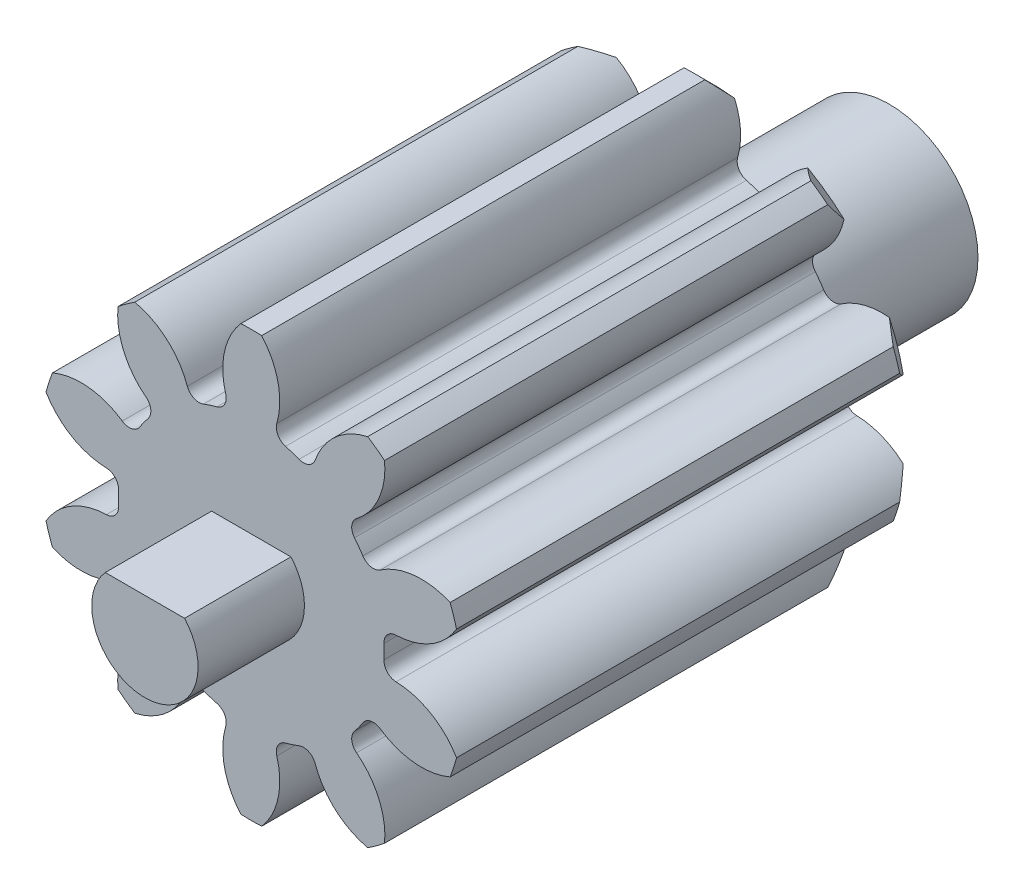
ISO-10303-21;
HEADER;
FILE_DESCRIPTION(('STEP AP214'),'2;1');
FILE_NAME('part.step','',(''),(''),'','','');
FILE_SCHEMA(('AUTOMOTIVE_DESIGN { 1 0 10303 214 1 1 1 1 }'));
ENDSEC;
DATA;
#1=APPLICATION_CONTEXT('core data for automotive mechanical design processes');
#2=APPLICATION_PROTOCOL_DEFINITION('international standard','automotive_design',2000,#1);
#3=PRODUCT_CONTEXT('',#1,'mechanical');
#4=PRODUCT('Part','Part','',(#3));
#5=PRODUCT_RELATED_PRODUCT_CATEGORY('part','',(#4));
#6=PRODUCT_DEFINITION_FORMATION('','',#4);
#7=PRODUCT_DEFINITION_CONTEXT('part definition',#1,'design');
#8=PRODUCT_DEFINITION('design','',#6,#7);
#9=PRODUCT_DEFINITION_SHAPE('','',#8);
#10=(LENGTH_UNIT() NAMED_UNIT(*) SI_UNIT(.MILLI.,.METRE.));
#11=(NAMED_UNIT(*) PLANE_ANGLE_UNIT() SI_UNIT($,.RADIAN.));
#12=(NAMED_UNIT(*) SI_UNIT($,.STERADIAN.) SOLID_ANGLE_UNIT());
#13=UNCERTAINTY_MEASURE_WITH_UNIT(LENGTH_MEASURE(1.E-05),#10,'distance_accuracy_value','');
#14=(GEOMETRIC_REPRESENTATION_CONTEXT(3) GLOBAL_UNCERTAINTY_ASSIGNED_CONTEXT((#13)) GLOBAL_UNIT_ASSIGNED_CONTEXT((#10,
#11,#12)) REPRESENTATION_CONTEXT('',''));
#15=CARTESIAN_POINT('',(0.,0.,0.));
#16=DIRECTION('',(0.,0.,1.));
#17=DIRECTION('',(1.,0.,0.));
#18=AXIS2_PLACEMENT_3D('',#15,#16,#17);
#19=CARTESIAN_POINT('',(0.,0.,18.));
#20=DIRECTION('',(0.,0.,1.));
#21=DIRECTION('',(1.,0.,0.));
#22=AXIS2_PLACEMENT_3D('',#19,#20,#21);
#23=PLANE('',#22);
#24=CARTESIAN_POINT('',(3.73470889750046,3.02114675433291,18.));
#25=DIRECTION('',(0.,0.,1.));
#26=DIRECTION('',(0.809016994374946,-0.587785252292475,0.));
#27=AXIS2_PLACEMENT_3D('',#24,#25,#26);
#28=CIRCLE('',#27,2.04976583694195);
#29=CARTESIAN_POINT('',(3.28484288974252,5.02093688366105,18.));
#30=VERTEX_POINT('',#29);
#31=CARTESIAN_POINT('',(1.8036386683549,3.70853875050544,18.));
#32=VERTEX_POINT('',#31);
#33=EDGE_CURVE('E692',#30,#32,#28,.T.);
#34=ORIENTED_EDGE('',*,*,#33,.T.);
#35=CARTESIAN_POINT('',(1.47390608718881,3.82591176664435,18.));
#36=DIRECTION('',(0.,0.,1.));
#37=DIRECTION('',(1.,0.,0.));
#38=AXIS2_PLACEMENT_3D('',#35,#36,#37);
#39=CIRCLE('',#38,0.35);
#40=CARTESIAN_POINT('',(1.34808483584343,3.49930954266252,18.));
#41=VERTEX_POINT('',#40);
#42=EDGE_CURVE('E817',#32,#41,#39,.F.);
#43=ORIENTED_EDGE('',*,*,#42,.T.);
#44=CARTESIAN_POINT('',(0.,0.,18.));
#45=DIRECTION('',(0.,0.,1.));
#46=DIRECTION('',(1.,0.,0.));
#47=AXIS2_PLACEMENT_3D('',#44,#45,#46);
#48=CIRCLE('',#47,3.74999999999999);
#49=CARTESIAN_POINT('',(0.966219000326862,3.62338527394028,18.));
#50=VERTEX_POINT('',#49);
#51=EDGE_CURVE('E709',#41,#50,#48,.T.);
#52=ORIENTED_EDGE('',*,*,#51,.T.);
#53=CARTESIAN_POINT('',(1.05639944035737,3.96156789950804,18.));
#54=DIRECTION('',(0.,0.,1.));
#55=DIRECTION('',(1.,0.,0.));
#56=AXIS2_PLACEMENT_3D('',#53,#54,#55);
#57=CIRCLE('',#56,0.35);
#58=CARTESIAN_POINT('',(0.720650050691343,4.06042308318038,18.));
#59=VERTEX_POINT('',#58);
#60=EDGE_CURVE('E751',#50,#59,#57,.F.);
#61=ORIENTED_EDGE('',*,*,#60,.T.);
#62=CARTESIAN_POINT('',(-1.24565745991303,4.63936587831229,18.));
#63=DIRECTION('',(0.,0.,-1.));
#64=DIRECTION('',(-1.,0.,0.));
#65=AXIS2_PLACEMENT_3D('',#62,#63,#64);
#66=CIRCLE('',#65,2.04976583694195);
#67=CARTESIAN_POINT('',(0.293738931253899,5.99280547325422,18.));
#68=VERTEX_POINT('',#67);
#69=EDGE_CURVE('E711',#68,#59,#66,.T.);
#70=ORIENTED_EDGE('',*,*,#69,.F.);
#71=CARTESIAN_POINT('',(0.,0.,18.));
#72=DIRECTION('',(0.,0.,1.));
#73=DIRECTION('',(1.,0.,0.));
#74=AXIS2_PLACEMENT_3D('',#71,#72,#73);
#75=CIRCLE('',#74,5.99999999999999);
#76=CARTESIAN_POINT('',(-0.293738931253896,5.99280547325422,18.));
#77=VERTEX_POINT('',#76);
#78=EDGE_CURVE('E714',#68,#77,#75,.T.);
#79=ORIENTED_EDGE('',*,*,#78,.T.);
#80=CARTESIAN_POINT('',(1.24565745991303,4.63936587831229,18.));
#81=DIRECTION('',(0.,0.,1.));
#82=DIRECTION('',(1.,0.,0.));
#83=AXIS2_PLACEMENT_3D('',#80,#81,#82);
#84=CIRCLE('',#83,2.04976583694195);
#85=CARTESIAN_POINT('',(-0.720650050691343,4.06042308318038,18.));
#86=VERTEX_POINT('',#85);
#87=EDGE_CURVE('E716',#77,#86,#84,.T.);
#88=ORIENTED_EDGE('',*,*,#87,.T.);
#89=CARTESIAN_POINT('',(-1.05639944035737,3.96156789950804,18.));
#90=DIRECTION('',(0.,0.,1.));
#91=DIRECTION('',(1.,0.,0.));
#92=AXIS2_PLACEMENT_3D('',#89,#90,#91);
#93=CIRCLE('',#92,0.35);
#94=CARTESIAN_POINT('',(-0.966219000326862,3.62338527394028,18.));
#95=VERTEX_POINT('',#94);
#96=EDGE_CURVE('E756',#86,#95,#93,.F.);
#97=ORIENTED_EDGE('',*,*,#96,.T.);
#98=CARTESIAN_POINT('',(0.,0.,18.));
#99=DIRECTION('',(0.,0.,-1.));
#100=DIRECTION('',(-1.,0.,0.));
#101=AXIS2_PLACEMENT_3D('',#98,#99,#100);
#102=CIRCLE('',#101,3.74999999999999);
#103=CARTESIAN_POINT('',(-1.34808483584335,3.49930954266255,18.));
#104=VERTEX_POINT('',#103);
#105=EDGE_CURVE('E719',#104,#95,#102,.T.);
#106=ORIENTED_EDGE('',*,*,#105,.F.);
#107=CARTESIAN_POINT('',(-1.47390608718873,3.82591176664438,18.));
#108=DIRECTION('',(0.,0.,1.));
#109=DIRECTION('',(1.,0.,0.));
#110=AXIS2_PLACEMENT_3D('',#107,#108,#109);
#111=CIRCLE('',#110,0.35);
#112=CARTESIAN_POINT('',(-1.80363866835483,3.70853875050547,18.));
#113=VERTEX_POINT('',#112);
#114=EDGE_CURVE('E978',#104,#113,#111,.F.);
#115=ORIENTED_EDGE('',*,*,#114,.T.);
#116=CARTESIAN_POINT('',(-3.7347088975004,3.02114675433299,18.));
#117=DIRECTION('',(0.,0.,-1.));
#118=DIRECTION('',(-0.809016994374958,-0.587785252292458,0.));
#119=AXIS2_PLACEMENT_3D('',#116,#117,#118);
#120=CIRCLE('',#119,2.04976583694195);
#121=CARTESIAN_POINT('',(-3.28484288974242,5.02093688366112,18.));
#122=VERTEX_POINT('',#121);
#123=EDGE_CURVE('E511',#122,#113,#120,.T.);
#124=ORIENTED_EDGE('',*,*,#123,.F.);
#125=CARTESIAN_POINT('',(0.,0.,18.));
#126=DIRECTION('',(0.,0.,1.));
#127=DIRECTION('',(0.809016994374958,0.587785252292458,0.));
#128=AXIS2_PLACEMENT_3D('',#125,#126,#127);
#129=CIRCLE('',#128,5.99999999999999);
#130=CARTESIAN_POINT('',(-3.7601224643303,4.67562606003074,18.));
#131=VERTEX_POINT('',#130);
#132=EDGE_CURVE('E514',#122,#131,#129,.T.);
#133=ORIENTED_EDGE('',*,*,#132,.T.);
#134=CARTESIAN_POINT('',(-1.71919278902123,4.48550492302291,18.));
#135=DIRECTION('',(0.,0.,1.));
#136=DIRECTION('',(0.809016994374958,0.587785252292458,0.));
#137=AXIS2_PLACEMENT_3D('',#134,#135,#136);
#138=CIRCLE('',#137,2.04976583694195);
#139=CARTESIAN_POINT('',(-2.96967494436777,2.86136380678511,18.));
#140=VERTEX_POINT('',#139);
#141=EDGE_CURVE('E516',#131,#140,#138,.T.);
#142=ORIENTED_EDGE('',*,*,#141,.T.);
#143=CARTESIAN_POINT('',(-3.18319628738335,2.58403974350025,18.));
#144=DIRECTION('',(0.,0.,1.));
#145=DIRECTION('',(1.,0.,0.));
#146=AXIS2_PLACEMENT_3D('',#143,#144,#145);
#147=CIRCLE('',#146,0.35);
#148=CARTESIAN_POINT('',(-2.91146001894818,2.36345098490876,18.));
#149=VERTEX_POINT('',#148);
#150=EDGE_CURVE('E983',#140,#149,#147,.F.);
#151=ORIENTED_EDGE('',*,*,#150,.T.);
#152=CARTESIAN_POINT('',(0.,0.,18.));
#153=DIRECTION('',(0.,0.,1.));
#154=DIRECTION('',(0.309016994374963,0.951056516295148,0.));
#155=AXIS2_PLACEMENT_3D('',#152,#153,#154);
#156=CIRCLE('',#155,3.74999999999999);
#157=CARTESIAN_POINT('',(-3.1474660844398,2.03861650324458,18.));
#158=VERTEX_POINT('',#157);
#159=EDGE_CURVE('E531',#149,#158,#156,.T.);
#160=ORIENTED_EDGE('',*,*,#159,.T.);
#161=CARTESIAN_POINT('',(-3.44122958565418,2.22888737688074,18.));
#162=DIRECTION('',(0.,0.,1.));
#163=DIRECTION('',(1.,0.,0.));
#164=AXIS2_PLACEMENT_3D('',#161,#162,#163);
#165=CIRCLE('',#164,0.35);
#166=CARTESIAN_POINT('',(-3.63899871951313,1.94011866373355,18.));
#167=VERTEX_POINT('',#166);
#168=EDGE_CURVE('E959',#158,#167,#165,.F.);
#169=ORIENTED_EDGE('',*,*,#168,.T.);
#170=CARTESIAN_POINT('',(-4.79722847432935,0.248952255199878,18.));
#171=DIRECTION('',(0.,0.,-1.));
#172=DIRECTION('',(-0.309016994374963,-0.951056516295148,0.));
#173=AXIS2_PLACEMENT_3D('',#170,#171,#172);
#174=CIRCLE('',#173,2.04976583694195);
#175=CARTESIAN_POINT('',(-5.60872637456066,2.13124105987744,18.));
#176=VERTEX_POINT('',#175);
#177=EDGE_CURVE('E533',#176,#167,#174,.T.);
#178=ORIENTED_EDGE('',*,*,#177,.F.);
#179=CARTESIAN_POINT('',(0.,0.,18.));
#180=DIRECTION('',(0.,0.,1.));
#181=DIRECTION('',(0.309016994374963,0.951056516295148,0.));
#182=AXIS2_PLACEMENT_3D('',#179,#180,#181);
#183=CIRCLE('',#182,5.99999999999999);
#184=CARTESIAN_POINT('',(-5.79026701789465,1.57251641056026,18.));
#185=VERTEX_POINT('',#184);
#186=EDGE_CURVE('E536',#176,#185,#183,.T.);
#187=ORIENTED_EDGE('',*,*,#186,.T.);
#188=CARTESIAN_POINT('',(-4.0273698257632,2.61833354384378,18.));
#189=DIRECTION('',(0.,0.,1.));
#190=DIRECTION('',(0.309016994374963,0.951056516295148,0.));
#191=AXIS2_PLACEMENT_3D('',#188,#189,#190);
#192=CIRCLE('',#191,2.04976583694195);
#193=CARTESIAN_POINT('',(-4.08438494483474,0.569360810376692,18.));
#194=VERTEX_POINT('',#193);
#195=EDGE_CURVE('E538',#185,#194,#192,.T.);
#196=ORIENTED_EDGE('',*,*,#195,.T.);
#197=CARTESIAN_POINT('',(-4.09412034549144,0.219496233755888,18.));
#198=DIRECTION('',(0.,0.,1.));
#199=DIRECTION('',(1.,0.,0.));
#200=AXIS2_PLACEMENT_3D('',#197,#198,#199);
#201=CIRCLE('',#200,0.35);
#202=CARTESIAN_POINT('',(-3.74462226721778,0.200758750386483,18.));
#203=VERTEX_POINT('',#202);
#204=EDGE_CURVE('E964',#194,#203,#201,.F.);
#205=ORIENTED_EDGE('',*,*,#204,.T.);
#206=CARTESIAN_POINT('',(0.,0.,18.));
#207=DIRECTION('',(0.,0.,1.));
#208=DIRECTION('',(-0.309016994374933,0.951056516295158,0.));
#209=AXIS2_PLACEMENT_3D('',#206,#207,#208);
#210=CIRCLE('',#209,3.74999999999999);
#211=CARTESIAN_POINT('',(-3.74462226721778,-0.200758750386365,18.));
#212=VERTEX_POINT('',#211);
#213=EDGE_CURVE('E553',#203,#212,#210,.T.);
#214=ORIENTED_EDGE('',*,*,#213,.T.);
#215=CARTESIAN_POINT('',(-4.09412034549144,-0.219496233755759,18.));
#216=DIRECTION('',(0.,0.,1.));
#217=DIRECTION('',(1.,0.,0.));
#218=AXIS2_PLACEMENT_3D('',#215,#216,#217);
#219=CIRCLE('',#218,0.35);
#220=CARTESIAN_POINT('',(-4.08438494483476,-0.569360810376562,18.));
#221=VERTEX_POINT('',#220);
#222=EDGE_CURVE('E938',#212,#221,#219,.F.);
#223=ORIENTED_EDGE('',*,*,#222,.T.);
#224=CARTESIAN_POINT('',(-4.02736982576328,-2.61833354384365,18.));
#225=DIRECTION('',(0.,0.,-1.));
#226=DIRECTION('',(0.309016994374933,-0.951056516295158,0.));
#227=AXIS2_PLACEMENT_3D('',#224,#225,#226);
#228=CIRCLE('',#227,2.04976583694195);
#229=CARTESIAN_POINT('',(-5.7902670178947,-1.57251641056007,18.));
#230=VERTEX_POINT('',#229);
#231=EDGE_CURVE('E555',#230,#221,#228,.T.);
#232=ORIENTED_EDGE('',*,*,#231,.F.);
#233=CARTESIAN_POINT('',(0.,0.,18.));
#234=DIRECTION('',(0.,0.,1.));
#235=DIRECTION('',(-0.309016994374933,0.951056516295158,0.));
#236=AXIS2_PLACEMENT_3D('',#233,#234,#235);
#237=CIRCLE('',#236,5.99999999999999);
#238=CARTESIAN_POINT('',(-5.60872637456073,-2.13124105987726,18.));
#239=VERTEX_POINT('',#238);
#240=EDGE_CURVE('E558',#230,#239,#237,.T.);
#241=ORIENTED_EDGE('',*,*,#240,.T.);
#242=CARTESIAN_POINT('',(-4.79722847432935,-0.248952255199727,18.));
#243=DIRECTION('',(0.,0.,1.));
#244=DIRECTION('',(-0.309016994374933,0.951056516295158,0.));
#245=AXIS2_PLACEMENT_3D('',#242,#243,#244);
#246=CIRCLE('',#245,2.04976583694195);
#247=CARTESIAN_POINT('',(-3.63899871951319,-1.94011866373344,18.));
#248=VERTEX_POINT('',#247);
#249=EDGE_CURVE('E560',#239,#248,#246,.T.);
#250=ORIENTED_EDGE('',*,*,#249,.T.);
#251=CARTESIAN_POINT('',(-3.44122958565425,-2.22888737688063,18.));
#252=DIRECTION('',(0.,0.,1.));
#253=DIRECTION('',(1.,0.,0.));
#254=AXIS2_PLACEMENT_3D('',#251,#252,#253);
#255=CIRCLE('',#254,0.35);
#256=CARTESIAN_POINT('',(-3.14746608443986,-2.03861650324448,18.));
#257=VERTEX_POINT('',#256);
#258=EDGE_CURVE('E943',#248,#257,#255,.F.);
#259=ORIENTED_EDGE('',*,*,#258,.T.);
#260=CARTESIAN_POINT('',(0.,0.,18.));
#261=DIRECTION('',(0.,0.,1.));
#262=DIRECTION('',(-0.80901699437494,0.587785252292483,0.));
#263=AXIS2_PLACEMENT_3D('',#260,#261,#262);
#264=CIRCLE('',#263,3.74999999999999);
#265=CARTESIAN_POINT('',(-2.91146001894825,-2.36345098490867,18.));
#266=VERTEX_POINT('',#265);
#267=EDGE_CURVE('E575',#257,#266,#264,.T.);
#268=ORIENTED_EDGE('',*,*,#267,.T.);
#269=CARTESIAN_POINT('',(-3.18319628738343,-2.58403974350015,18.));
#270=DIRECTION('',(0.,0.,1.));
#271=DIRECTION('',(1.,0.,0.));
#272=AXIS2_PLACEMENT_3D('',#269,#270,#271);
#273=CIRCLE('',#272,0.35);
#274=CARTESIAN_POINT('',(-2.96967494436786,-2.86136380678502,18.));
#275=VERTEX_POINT('',#274);
#276=EDGE_CURVE('E917',#266,#275,#273,.F.);
#277=ORIENTED_EDGE('',*,*,#276,.T.);
#278=CARTESIAN_POINT('',(-1.71919278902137,-4.48550492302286,18.));
#279=DIRECTION('',(0.,0.,-1.));
#280=DIRECTION('',(0.80901699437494,-0.587785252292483,0.));
#281=AXIS2_PLACEMENT_3D('',#278,#279,#280);
#282=CIRCLE('',#281,2.04976583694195);
#283=CARTESIAN_POINT('',(-3.76012246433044,-4.67562606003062,18.));
#284=VERTEX_POINT('',#283);
#285=EDGE_CURVE('E577',#284,#275,#282,.T.);
#286=ORIENTED_EDGE('',*,*,#285,.F.);
#287=CARTESIAN_POINT('',(0.,0.,18.));
#288=DIRECTION('',(0.,0.,1.));
#289=DIRECTION('',(-0.80901699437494,0.587785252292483,0.));
#290=AXIS2_PLACEMENT_3D('',#287,#288,#289);
#291=CIRCLE('',#290,5.99999999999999);
#292=CARTESIAN_POINT('',(-3.28484288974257,-5.02093688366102,18.));
#293=VERTEX_POINT('',#292);
#294=EDGE_CURVE('E580',#284,#293,#291,.T.);
#295=ORIENTED_EDGE('',*,*,#294,.T.);
#296=CARTESIAN_POINT('',(-3.73470889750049,-3.02114675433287,18.));
#297=DIRECTION('',(0.,0.,1.));
#298=DIRECTION('',(-0.80901699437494,0.587785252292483,0.));
#299=AXIS2_PLACEMENT_3D('',#296,#297,#298);
#300=CIRCLE('',#299,2.04976583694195);
#301=CARTESIAN_POINT('',(-1.80363866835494,-3.70853875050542,18.));
#302=VERTEX_POINT('',#301);
#303=EDGE_CURVE('E582',#293,#302,#300,.T.);
#304=ORIENTED_EDGE('',*,*,#303,.T.);
#305=CARTESIAN_POINT('',(-1.47390608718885,-3.82591176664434,18.));
#306=DIRECTION('',(0.,0.,1.));
#307=DIRECTION('',(1.,0.,0.));
#308=AXIS2_PLACEMENT_3D('',#305,#306,#307);
#309=CIRCLE('',#308,0.35);
#310=CARTESIAN_POINT('',(-1.34808483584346,-3.4993095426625,18.));
#311=VERTEX_POINT('',#310);
#312=EDGE_CURVE('E922',#302,#311,#309,.F.);
#313=ORIENTED_EDGE('',*,*,#312,.T.);
#314=CARTESIAN_POINT('',(0.,0.,18.));
#315=DIRECTION('',(0.,0.,1.));
#316=DIRECTION('',(-1.,0.,0.));
#317=AXIS2_PLACEMENT_3D('',#314,#315,#316);
#318=CIRCLE('',#317,3.74999999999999);
#319=CARTESIAN_POINT('',(-0.9662190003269,-3.62338527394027,18.));
#320=VERTEX_POINT('',#319);
#321=EDGE_CURVE('E597',#311,#320,#318,.T.);
#322=ORIENTED_EDGE('',*,*,#321,.T.);
#323=CARTESIAN_POINT('',(-1.05639944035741,-3.96156789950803,18.));
#324=DIRECTION('',(0.,0.,1.));
#325=DIRECTION('',(1.,0.,0.));
#326=AXIS2_PLACEMENT_3D('',#323,#324,#325);
#327=CIRCLE('',#326,0.35);
#328=CARTESIAN_POINT('',(-0.720650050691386,-4.06042308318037,18.));
#329=VERTEX_POINT('',#328);
#330=EDGE_CURVE('E896',#320,#329,#327,.F.);
#331=ORIENTED_EDGE('',*,*,#330,.T.);
#332=CARTESIAN_POINT('',(1.24565745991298,-4.63936587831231,18.));
#333=DIRECTION('',(0.,0.,-1.));
#334=DIRECTION('',(1.,0.,0.));
#335=AXIS2_PLACEMENT_3D('',#332,#333,#334);
#336=CIRCLE('',#335,2.04976583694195);
#337=CARTESIAN_POINT('',(-0.293738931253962,-5.99280547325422,18.));
#338=VERTEX_POINT('',#337);
#339=EDGE_CURVE('E599',#338,#329,#336,.T.);
#340=ORIENTED_EDGE('',*,*,#339,.F.);
#341=CARTESIAN_POINT('',(0.,0.,18.));
#342=DIRECTION('',(0.,0.,1.));
#343=DIRECTION('',(-1.,0.,0.));
#344=AXIS2_PLACEMENT_3D('',#341,#342,#343);
#345=CIRCLE('',#344,5.99999999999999);
#346=CARTESIAN_POINT('',(0.293738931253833,-5.99280547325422,18.));
#347=VERTEX_POINT('',#346);
#348=EDGE_CURVE('E602',#338,#347,#345,.T.);
#349=ORIENTED_EDGE('',*,*,#348,.T.);
#350=CARTESIAN_POINT('',(-1.24565745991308,-4.63936587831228,18.));
#351=DIRECTION('',(0.,0.,1.));
#352=DIRECTION('',(-1.,0.,0.));
#353=AXIS2_PLACEMENT_3D('',#350,#351,#352);
#354=CIRCLE('',#353,2.04976583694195);
#355=CARTESIAN_POINT('',(0.7206500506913,-4.06042308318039,18.));
#356=VERTEX_POINT('',#355);
#357=EDGE_CURVE('E604',#347,#356,#354,.T.);
#358=ORIENTED_EDGE('',*,*,#357,.T.);
#359=CARTESIAN_POINT('',(1.05639944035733,-3.96156789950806,18.));
#360=DIRECTION('',(0.,0.,1.));
#361=DIRECTION('',(1.,0.,0.));
#362=AXIS2_PLACEMENT_3D('',#359,#360,#361);
#363=CIRCLE('',#362,0.35);
#364=CARTESIAN_POINT('',(0.966219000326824,-3.62338527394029,18.));
#365=VERTEX_POINT('',#364);
#366=EDGE_CURVE('E901',#356,#365,#363,.F.);
#367=ORIENTED_EDGE('',*,*,#366,.T.);
#368=CARTESIAN_POINT('',(0.,0.,18.));
#369=DIRECTION('',(0.,0.,1.));
#370=DIRECTION('',(-0.809016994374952,-0.587785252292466,0.));
#371=AXIS2_PLACEMENT_3D('',#368,#369,#370);
#372=CIRCLE('',#371,3.74999999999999);
#373=CARTESIAN_POINT('',(1.34808483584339,-3.49930954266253,18.));
#374=VERTEX_POINT('',#373);
#375=EDGE_CURVE('E619',#365,#374,#372,.T.);
#376=ORIENTED_EDGE('',*,*,#375,.T.);
#377=CARTESIAN_POINT('',(1.47390608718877,-3.82591176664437,18.));
#378=DIRECTION('',(0.,0.,1.));
#379=DIRECTION('',(1.,0.,0.));
#380=AXIS2_PLACEMENT_3D('',#377,#378,#379);
#381=CIRCLE('',#380,0.35);
#382=CARTESIAN_POINT('',(1.80363866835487,-3.70853875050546,18.));
#383=VERTEX_POINT('',#382);
#384=EDGE_CURVE('E875',#374,#383,#381,.F.);
#385=ORIENTED_EDGE('',*,*,#384,.T.);
#386=CARTESIAN_POINT('',(3.73470889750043,-3.02114675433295,18.));
#387=DIRECTION('',(0.,0.,-1.));
#388=DIRECTION('',(0.809016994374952,0.587785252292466,0.));
#389=AXIS2_PLACEMENT_3D('',#386,#387,#388);
#390=CIRCLE('',#389,2.04976583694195);
#391=CARTESIAN_POINT('',(3.28484288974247,-5.02093688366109,18.));
#392=VERTEX_POINT('',#391);
#393=EDGE_CURVE('E621',#392,#383,#390,.T.);
#394=ORIENTED_EDGE('',*,*,#393,.F.);
#395=CARTESIAN_POINT('',(0.,0.,18.));
#396=DIRECTION('',(0.,0.,1.));
#397=DIRECTION('',(-0.809016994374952,-0.587785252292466,0.));
#398=AXIS2_PLACEMENT_3D('',#395,#396,#397);
#399=CIRCLE('',#398,5.99999999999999);
#400=CARTESIAN_POINT('',(3.76012246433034,-4.6756260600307,18.));
#401=VERTEX_POINT('',#400);
#402=EDGE_CURVE('E624',#392,#401,#399,.T.);
#403=ORIENTED_EDGE('',*,*,#402,.T.);
#404=CARTESIAN_POINT('',(1.71919278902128,-4.4855049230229,18.));
#405=DIRECTION('',(0.,0.,1.));
#406=DIRECTION('',(-0.809016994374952,-0.587785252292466,0.));
#407=AXIS2_PLACEMENT_3D('',#404,#405,#406);
#408=CIRCLE('',#407,2.04976583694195);
#409=CARTESIAN_POINT('',(2.9696749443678,-2.86136380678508,18.));
#410=VERTEX_POINT('',#409);
#411=EDGE_CURVE('E626',#401,#410,#408,.T.);
#412=ORIENTED_EDGE('',*,*,#411,.T.);
#413=CARTESIAN_POINT('',(3.18319628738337,-2.58403974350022,18.));
#414=DIRECTION('',(0.,0.,1.));
#415=DIRECTION('',(1.,0.,0.));
#416=AXIS2_PLACEMENT_3D('',#413,#414,#415);
#417=CIRCLE('',#416,0.35);
#418=CARTESIAN_POINT('',(2.91146001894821,-2.36345098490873,18.));
#419=VERTEX_POINT('',#418);
#420=EDGE_CURVE('E880',#410,#419,#417,.F.);
#421=ORIENTED_EDGE('',*,*,#420,.T.);
#422=CARTESIAN_POINT('',(0.,0.,18.));
#423=DIRECTION('',(0.,0.,1.));
#424=DIRECTION('',(-0.309016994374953,-0.951056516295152,0.));
#425=AXIS2_PLACEMENT_3D('',#422,#423,#424);
#426=CIRCLE('',#425,3.74999999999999);
#427=CARTESIAN_POINT('',(3.14746608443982,-2.03861650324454,18.));
#428=VERTEX_POINT('',#427);
#429=EDGE_CURVE('E641',#419,#428,#426,.T.);
#430=ORIENTED_EDGE('',*,*,#429,.T.);
#431=CARTESIAN_POINT('',(3.44122958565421,-2.2288873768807,18.));
#432=DIRECTION('',(0.,0.,1.));
#433=DIRECTION('',(1.,0.,0.));
#434=AXIS2_PLACEMENT_3D('',#431,#432,#433);
#435=CIRCLE('',#434,0.35);
#436=CARTESIAN_POINT('',(3.63899871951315,-1.94011866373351,18.));
#437=VERTEX_POINT('',#436);
#438=EDGE_CURVE('E854',#428,#437,#435,.F.);
#439=ORIENTED_EDGE('',*,*,#438,.T.);
#440=CARTESIAN_POINT('',(4.79722847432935,-0.248952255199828,18.));
#441=DIRECTION('',(0.,0.,-1.));
#442=DIRECTION('',(0.309016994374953,0.951056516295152,0.));
#443=AXIS2_PLACEMENT_3D('',#440,#441,#442);
#444=CIRCLE('',#443,2.04976583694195);
#445=CARTESIAN_POINT('',(5.60872637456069,-2.13124105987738,18.));
#446=VERTEX_POINT('',#445);
#447=EDGE_CURVE('E643',#446,#437,#444,.T.);
#448=ORIENTED_EDGE('',*,*,#447,.F.);
#449=CARTESIAN_POINT('',(0.,0.,18.));
#450=DIRECTION('',(0.,0.,1.));
#451=DIRECTION('',(-0.309016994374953,-0.951056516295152,0.));
#452=AXIS2_PLACEMENT_3D('',#449,#450,#451);
#453=CIRCLE('',#452,5.99999999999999);
#454=CARTESIAN_POINT('',(5.79026701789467,-1.5725164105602,18.));
#455=VERTEX_POINT('',#454);
#456=EDGE_CURVE('E646',#446,#455,#453,.T.);
#457=ORIENTED_EDGE('',*,*,#456,.T.);
#458=CARTESIAN_POINT('',(4.02736982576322,-2.61833354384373,18.));
#459=DIRECTION('',(0.,0.,1.));
#460=DIRECTION('',(-0.309016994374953,-0.951056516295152,0.));
#461=AXIS2_PLACEMENT_3D('',#458,#459,#460);
#462=CIRCLE('',#461,2.04976583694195);
#463=CARTESIAN_POINT('',(4.08438494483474,-0.569360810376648,18.));
#464=VERTEX_POINT('',#463);
#465=EDGE_CURVE('E648',#455,#464,#462,.T.);
#466=ORIENTED_EDGE('',*,*,#465,.T.);
#467=CARTESIAN_POINT('',(4.09412034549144,-0.219496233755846,18.));
#468=DIRECTION('',(0.,0.,1.));
#469=DIRECTION('',(1.,0.,0.));
#470=AXIS2_PLACEMENT_3D('',#467,#468,#469);
#471=CIRCLE('',#470,0.35);
#472=CARTESIAN_POINT('',(3.74462226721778,-0.200758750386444,18.));
#473=VERTEX_POINT('',#472);
#474=EDGE_CURVE('E859',#464,#473,#471,.F.);
#475=ORIENTED_EDGE('',*,*,#474,.T.);
#476=CARTESIAN_POINT('',(0.,0.,18.));
#477=DIRECTION('',(0.,0.,1.));
#478=DIRECTION('',(0.309016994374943,-0.951056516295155,0.));
#479=AXIS2_PLACEMENT_3D('',#476,#477,#478);
#480=CIRCLE('',#479,3.74999999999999);
#481=CARTESIAN_POINT('',(3.74462226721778,0.200758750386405,18.));
#482=VERTEX_POINT('',#481);
#483=EDGE_CURVE('E663',#473,#482,#480,.T.);
#484=ORIENTED_EDGE('',*,*,#483,.T.);
#485=CARTESIAN_POINT('',(4.09412034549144,0.219496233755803,18.));
#486=DIRECTION('',(0.,0.,1.));
#487=DIRECTION('',(1.,0.,0.));
#488=AXIS2_PLACEMENT_3D('',#485,#486,#487);
#489=CIRCLE('',#488,0.35);
#490=CARTESIAN_POINT('',(4.08438494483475,0.569360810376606,18.));
#491=VERTEX_POINT('',#490);
#492=EDGE_CURVE('E833',#482,#491,#489,.F.);
#493=ORIENTED_EDGE('',*,*,#492,.T.);
#494=CARTESIAN_POINT('',(4.02736982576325,2.61833354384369,18.));
#495=DIRECTION('',(0.,0.,-1.));
#496=DIRECTION('',(-0.309016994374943,0.951056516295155,0.));
#497=AXIS2_PLACEMENT_3D('',#494,#495,#496);
#498=CIRCLE('',#497,2.04976583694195);
#499=CARTESIAN_POINT('',(5.79026701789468,1.57251641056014,18.));
#500=VERTEX_POINT('',#499);
#501=EDGE_CURVE('E665',#500,#491,#498,.T.);
#502=ORIENTED_EDGE('',*,*,#501,.F.);
#503=CARTESIAN_POINT('',(0.,0.,18.));
#504=DIRECTION('',(0.,0.,1.));
#505=DIRECTION('',(0.309016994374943,-0.951056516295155,0.));
#506=AXIS2_PLACEMENT_3D('',#503,#504,#505);
#507=CIRCLE('',#506,5.99999999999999);
#508=CARTESIAN_POINT('',(5.60872637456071,2.13124105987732,18.));
#509=VERTEX_POINT('',#508);
#510=EDGE_CURVE('E668',#500,#509,#507,.T.);
#511=ORIENTED_EDGE('',*,*,#510,.T.);
#512=CARTESIAN_POINT('',(4.79722847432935,0.248952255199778,18.));
#513=DIRECTION('',(0.,0.,1.));
#514=DIRECTION('',(0.309016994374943,-0.951056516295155,0.));
#515=AXIS2_PLACEMENT_3D('',#512,#513,#514);
#516=CIRCLE('',#515,2.04976583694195);
#517=CARTESIAN_POINT('',(3.63899871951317,1.94011866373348,18.));
#518=VERTEX_POINT('',#517);
#519=EDGE_CURVE('E670',#509,#518,#516,.T.);
#520=ORIENTED_EDGE('',*,*,#519,.T.);
#521=CARTESIAN_POINT('',(3.44122958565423,2.22888737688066,18.));
#522=DIRECTION('',(0.,0.,1.));
#523=DIRECTION('',(1.,0.,0.));
#524=AXIS2_PLACEMENT_3D('',#521,#522,#523);
#525=CIRCLE('',#524,0.35);
#526=CARTESIAN_POINT('',(3.14746608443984,2.03861650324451,18.));
#527=VERTEX_POINT('',#526);
#528=EDGE_CURVE('E838',#518,#527,#525,.F.);
#529=ORIENTED_EDGE('',*,*,#528,.T.);
#530=CARTESIAN_POINT('',(0.,0.,18.));
#531=DIRECTION('',(0.,0.,1.));
#532=DIRECTION('',(0.809016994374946,-0.587785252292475,0.));
#533=AXIS2_PLACEMENT_3D('',#530,#531,#532);
#534=CIRCLE('',#533,3.74999999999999);
#535=CARTESIAN_POINT('',(2.91146001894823,2.3634509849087,18.));
#536=VERTEX_POINT('',#535);
#537=EDGE_CURVE('E685',#527,#536,#534,.T.);
#538=ORIENTED_EDGE('',*,*,#537,.T.);
#539=CARTESIAN_POINT('',(3.1831962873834,2.58403974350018,18.));
#540=DIRECTION('',(0.,0.,1.));
#541=DIRECTION('',(1.,0.,0.));
#542=AXIS2_PLACEMENT_3D('',#539,#540,#541);
#543=CIRCLE('',#542,0.35);
#544=CARTESIAN_POINT('',(2.96967494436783,2.86136380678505,18.));
#545=VERTEX_POINT('',#544);
#546=EDGE_CURVE('E812',#536,#545,#543,.F.);
#547=ORIENTED_EDGE('',*,*,#546,.T.);
#548=CARTESIAN_POINT('',(1.71919278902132,4.48550492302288,18.));
#549=DIRECTION('',(0.,0.,-1.));
#550=DIRECTION('',(-0.809016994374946,0.587785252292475,0.));
#551=AXIS2_PLACEMENT_3D('',#548,#549,#550);
#552=CIRCLE('',#551,2.04976583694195);
#553=CARTESIAN_POINT('',(3.76012246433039,4.67562606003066,18.));
#554=VERTEX_POINT('',#553);
#555=EDGE_CURVE('E687',#554,#545,#552,.T.);
#556=ORIENTED_EDGE('',*,*,#555,.F.);
#557=CARTESIAN_POINT('',(0.,0.,18.));
#558=DIRECTION('',(0.,0.,1.));
#559=DIRECTION('',(0.809016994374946,-0.587785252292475,0.));
#560=AXIS2_PLACEMENT_3D('',#557,#558,#559);
#561=CIRCLE('',#560,5.99999999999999);
#562=EDGE_CURVE('E690',#554,#30,#561,.T.);
#563=ORIENTED_EDGE('',*,*,#562,.T.);
#564=EDGE_LOOP('',(#34,#43,#52,#61,#70,#79,#88,#97,#106,#115,#124,#133,#142,#151,#160,#169,#178,
#187,#196,#205,#214,#223,#232,#241,#250,#259,#268,#277,#286,#295,#304,#313,#322,#331,#340,#349,
#358,#367,#376,#385,#394,#403,#412,#421,#430,#439,#448,#457,#466,#475,#484,#493,#502,#511,#520,
#529,#538,#547,#556,#563));
#565=FACE_BOUND('',#564,.T.);
#566=DIRECTION('',(-1.,0.,0.));
#567=VECTOR('',#566,1.);
#568=CARTESIAN_POINT('',(-1.1180339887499,1.,18.));
#569=LINE('',#568,#567);
#570=CARTESIAN_POINT('',(1.1180339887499,1.,18.));
#571=VERTEX_POINT('',#570);
#572=CARTESIAN_POINT('',(-1.1180339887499,1.,18.));
#573=VERTEX_POINT('',#572);
#574=EDGE_CURVE('E490',#571,#573,#569,.T.);
#575=ORIENTED_EDGE('',*,*,#574,.F.);
#576=CARTESIAN_POINT('',(0.,0.,18.));
#577=DIRECTION('',(0.,0.,1.));
#578=DIRECTION('',(1.,0.,0.));
#579=AXIS2_PLACEMENT_3D('',#576,#577,#578);
#580=CIRCLE('',#579,1.5);
#581=EDGE_CURVE('E55',#573,#571,#580,.T.);
#582=ORIENTED_EDGE('',*,*,#581,.F.);
#583=EDGE_LOOP('',(#575,#582));
#584=FACE_BOUND('',#583,.T.);
#585=ADVANCED_FACE('F35',(#565,#584),#23,.T.);
#586=CARTESIAN_POINT('',(0.,0.,5.));
#587=DIRECTION('',(0.,0.,-1.));
#588=DIRECTION('',(-1.,0.,0.));
#589=AXIS2_PLACEMENT_3D('',#586,#587,#588);
#590=CYLINDRICAL_SURFACE('',#589,2.5);
#591=CARTESIAN_POINT('',(0.,0.,5.));
#592=DIRECTION('',(0.,0.,1.));
#593=DIRECTION('',(1.,0.,0.));
#594=AXIS2_PLACEMENT_3D('',#591,#592,#593);
#595=CIRCLE('',#594,2.5);
#596=CARTESIAN_POINT('',(2.5,0.,5.));
#597=VERTEX_POINT('',#596);
#598=EDGE_CURVE('E729',#597,#597,#595,.T.);
#599=ORIENTED_EDGE('',*,*,#598,.F.);
#600=EDGE_LOOP('',(#599));
#601=FACE_BOUND('',#600,.T.);
#602=CARTESIAN_POINT('',(0.,0.,0.));
#603=DIRECTION('',(0.,0.,1.));
#604=DIRECTION('',(1.,0.,0.));
#605=AXIS2_PLACEMENT_3D('',#602,#603,#604);
#606=CIRCLE('',#605,2.5);
#607=CARTESIAN_POINT('',(2.5,0.,0.));
#608=VERTEX_POINT('',#607);
#609=EDGE_CURVE('E727',#608,#608,#606,.T.);
#610=ORIENTED_EDGE('',*,*,#609,.T.);
#611=EDGE_LOOP('',(#610));
#612=FACE_BOUND('',#611,.T.);
#613=ADVANCED_FACE('F37',(#601,#612),#590,.T.);
#614=CARTESIAN_POINT('',(0.,0.,0.));
#615=DIRECTION('',(0.,0.,1.));
#616=DIRECTION('',(1.,0.,0.));
#617=AXIS2_PLACEMENT_3D('',#614,#615,#616);
#618=PLANE('',#617);
#619=ORIENTED_EDGE('',*,*,#609,.F.);
#620=EDGE_LOOP('',(#619));
#621=FACE_BOUND('',#620,.T.);
#622=ADVANCED_FACE('F1292',(#621),#618,.F.);
#623=CARTESIAN_POINT('',(0.,0.,5.));
#624=DIRECTION('',(0.,0.,1.));
#625=DIRECTION('',(1.,0.,0.));
#626=AXIS2_PLACEMENT_3D('',#623,#624,#625);
#627=PLANE('',#626);
#628=CARTESIAN_POINT('',(-1.71919278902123,4.48550492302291,5.));
#629=DIRECTION('',(0.,0.,1.));
#630=DIRECTION('',(0.809016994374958,0.587785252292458,0.));
#631=AXIS2_PLACEMENT_3D('',#628,#629,#630);
#632=CIRCLE('',#631,2.04976583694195);
#633=CARTESIAN_POINT('',(-3.72200336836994,4.04928276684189,5.));
#634=VERTEX_POINT('',#633);
#635=CARTESIAN_POINT('',(-2.96967494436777,2.86136380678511,5.));
#636=VERTEX_POINT('',#635);
#637=EDGE_CURVE('E509',#634,#636,#632,.T.);
#638=ORIENTED_EDGE('',*,*,#637,.F.);
#639=CARTESIAN_POINT('',(0.,0.,5.));
#640=DIRECTION('',(0.,0.,1.));
#641=DIRECTION('',(1.,0.,0.));
#642=AXIS2_PLACEMENT_3D('',#639,#640,#641);
#643=CIRCLE('',#642,5.49999999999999);
#644=CARTESIAN_POINT('',(-2.70093446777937,4.79113274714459,5.));
#645=VERTEX_POINT('',#644);
#646=EDGE_CURVE('E48',#634,#645,#643,.F.);
#647=ORIENTED_EDGE('',*,*,#646,.T.);
#648=CARTESIAN_POINT('',(-3.7347088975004,3.02114675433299,5.));
#649=DIRECTION('',(0.,0.,-1.));
#650=DIRECTION('',(-0.809016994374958,-0.587785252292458,0.));
#651=AXIS2_PLACEMENT_3D('',#648,#649,#650);
#652=CIRCLE('',#651,2.04976583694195);
#653=CARTESIAN_POINT('',(-1.80363866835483,3.70853875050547,5.));
#654=VERTEX_POINT('',#653);
#655=EDGE_CURVE('E507',#645,#654,#652,.T.);
#656=ORIENTED_EDGE('',*,*,#655,.T.);
#657=CARTESIAN_POINT('',(-1.47390608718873,3.82591176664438,5.));
#658=DIRECTION('',(0.,0.,1.));
#659=DIRECTION('',(1.,0.,0.));
#660=AXIS2_PLACEMENT_3D('',#657,#658,#659);
#661=CIRCLE('',#660,0.35);
#662=CARTESIAN_POINT('',(-1.34808483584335,3.49930954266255,5.));
#663=VERTEX_POINT('',#662);
#664=EDGE_CURVE('E976',#654,#663,#661,.T.);
#665=ORIENTED_EDGE('',*,*,#664,.T.);
#666=CARTESIAN_POINT('',(0.,0.,5.));
#667=DIRECTION('',(0.,0.,-1.));
#668=DIRECTION('',(-1.,0.,0.));
#669=AXIS2_PLACEMENT_3D('',#666,#667,#668);
#670=CIRCLE('',#669,3.74999999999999);
#671=CARTESIAN_POINT('',(-0.966219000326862,3.62338527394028,5.));
#672=VERTEX_POINT('',#671);
#673=EDGE_CURVE('E707',#663,#672,#670,.T.);
#674=ORIENTED_EDGE('',*,*,#673,.T.);
#675=CARTESIAN_POINT('',(-1.05639944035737,3.96156789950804,5.));
#676=DIRECTION('',(0.,0.,1.));
#677=DIRECTION('',(1.,0.,0.));
#678=AXIS2_PLACEMENT_3D('',#675,#676,#677);
#679=CIRCLE('',#678,0.35);
#680=CARTESIAN_POINT('',(-0.720650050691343,4.06042308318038,5.));
#681=VERTEX_POINT('',#680);
#682=EDGE_CURVE('E753',#672,#681,#679,.T.);
#683=ORIENTED_EDGE('',*,*,#682,.T.);
#684=CARTESIAN_POINT('',(1.24565745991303,4.63936587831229,5.));
#685=DIRECTION('',(0.,0.,1.));
#686=DIRECTION('',(1.,0.,0.));
#687=AXIS2_PLACEMENT_3D('',#684,#685,#686);
#688=CIRCLE('',#687,2.04976583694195);
#689=CARTESIAN_POINT('',(-0.631055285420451,5.46367726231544,5.));
#690=VERTEX_POINT('',#689);
#691=EDGE_CURVE('E705',#690,#681,#688,.T.);
#692=ORIENTED_EDGE('',*,*,#691,.F.);
#693=CARTESIAN_POINT('',(0.,0.,5.));
#694=DIRECTION('',(0.,0.,1.));
#695=DIRECTION('',(1.,0.,0.));
#696=AXIS2_PLACEMENT_3D('',#693,#694,#695);
#697=CIRCLE('',#696,5.49999999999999);
#698=CARTESIAN_POINT('',(0.631055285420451,5.46367726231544,5.));
#699=VERTEX_POINT('',#698);
#700=EDGE_CURVE('E769',#690,#699,#697,.F.);
#701=ORIENTED_EDGE('',*,*,#700,.T.);
#702=CARTESIAN_POINT('',(-1.24565745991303,4.63936587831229,5.));
#703=DIRECTION('',(0.,0.,-1.));
#704=DIRECTION('',(-1.,0.,0.));
#705=AXIS2_PLACEMENT_3D('',#702,#703,#704);
#706=CIRCLE('',#705,2.04976583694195);
#707=CARTESIAN_POINT('',(0.720650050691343,4.06042308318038,5.));
#708=VERTEX_POINT('',#707);
#709=EDGE_CURVE('E703',#699,#708,#706,.T.);
#710=ORIENTED_EDGE('',*,*,#709,.T.);
#711=CARTESIAN_POINT('',(1.05639944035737,3.96156789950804,5.));
#712=DIRECTION('',(0.,0.,1.));
#713=DIRECTION('',(1.,0.,0.));
#714=AXIS2_PLACEMENT_3D('',#711,#712,#713);
#715=CIRCLE('',#714,0.35);
#716=CARTESIAN_POINT('',(0.966219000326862,3.62338527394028,5.));
#717=VERTEX_POINT('',#716);
#718=EDGE_CURVE('E748',#708,#717,#715,.T.);
#719=ORIENTED_EDGE('',*,*,#718,.T.);
#720=CARTESIAN_POINT('',(0.,0.,5.));
#721=DIRECTION('',(0.,0.,1.));
#722=DIRECTION('',(1.,0.,0.));
#723=AXIS2_PLACEMENT_3D('',#720,#721,#722);
#724=CIRCLE('',#723,3.74999999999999);
#725=CARTESIAN_POINT('',(1.34808483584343,3.49930954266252,5.));
#726=VERTEX_POINT('',#725);
#727=EDGE_CURVE('E701',#726,#717,#724,.T.);
#728=ORIENTED_EDGE('',*,*,#727,.F.);
#729=CARTESIAN_POINT('',(1.47390608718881,3.82591176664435,5.));
#730=DIRECTION('',(0.,0.,1.));
#731=DIRECTION('',(1.,0.,0.));
#732=AXIS2_PLACEMENT_3D('',#729,#730,#731);
#733=CIRCLE('',#732,0.35);
#734=CARTESIAN_POINT('',(1.8036386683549,3.70853875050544,5.));
#735=VERTEX_POINT('',#734);
#736=EDGE_CURVE('E814',#726,#735,#733,.T.);
#737=ORIENTED_EDGE('',*,*,#736,.T.);
#738=CARTESIAN_POINT('',(3.73470889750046,3.02114675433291,5.));
#739=DIRECTION('',(0.,0.,1.));
#740=DIRECTION('',(0.809016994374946,-0.587785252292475,0.));
#741=AXIS2_PLACEMENT_3D('',#738,#739,#740);
#742=CIRCLE('',#741,2.04976583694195);
#743=CARTESIAN_POINT('',(2.70093446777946,4.79113274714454,5.));
#744=VERTEX_POINT('',#743);
#745=EDGE_CURVE('E683',#744,#735,#742,.T.);
#746=ORIENTED_EDGE('',*,*,#745,.F.);
#747=CARTESIAN_POINT('',(0.,0.,5.));
#748=DIRECTION('',(0.,0.,1.));
#749=DIRECTION('',(1.,0.,0.));
#750=AXIS2_PLACEMENT_3D('',#747,#748,#749);
#751=CIRCLE('',#750,5.49999999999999);
#752=CARTESIAN_POINT('',(3.72200336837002,4.04928276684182,5.));
#753=VERTEX_POINT('',#752);
#754=EDGE_CURVE('E995',#744,#753,#751,.F.);
#755=ORIENTED_EDGE('',*,*,#754,.T.);
#756=CARTESIAN_POINT('',(1.71919278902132,4.48550492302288,5.));
#757=DIRECTION('',(0.,0.,-1.));
#758=DIRECTION('',(-0.809016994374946,0.587785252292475,0.));
#759=AXIS2_PLACEMENT_3D('',#756,#757,#758);
#760=CIRCLE('',#759,2.04976583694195);
#761=CARTESIAN_POINT('',(2.96967494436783,2.86136380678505,5.));
#762=VERTEX_POINT('',#761);
#763=EDGE_CURVE('E681',#753,#762,#760,.T.);
#764=ORIENTED_EDGE('',*,*,#763,.T.);
#765=CARTESIAN_POINT('',(3.1831962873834,2.58403974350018,5.));
#766=DIRECTION('',(0.,0.,1.));
#767=DIRECTION('',(1.,0.,0.));
#768=AXIS2_PLACEMENT_3D('',#765,#766,#767);
#769=CIRCLE('',#768,0.35);
#770=CARTESIAN_POINT('',(2.91146001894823,2.3634509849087,5.));
#771=VERTEX_POINT('',#770);
#772=EDGE_CURVE('E809',#762,#771,#769,.T.);
#773=ORIENTED_EDGE('',*,*,#772,.T.);
#774=CARTESIAN_POINT('',(0.,0.,5.));
#775=DIRECTION('',(0.,0.,1.));
#776=DIRECTION('',(0.809016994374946,-0.587785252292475,0.));
#777=AXIS2_PLACEMENT_3D('',#774,#775,#776);
#778=CIRCLE('',#777,3.74999999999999);
#779=CARTESIAN_POINT('',(3.14746608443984,2.03861650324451,5.));
#780=VERTEX_POINT('',#779);
#781=EDGE_CURVE('E679',#780,#771,#778,.T.);
#782=ORIENTED_EDGE('',*,*,#781,.F.);
#783=CARTESIAN_POINT('',(3.44122958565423,2.22888737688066,5.));
#784=DIRECTION('',(0.,0.,1.));
#785=DIRECTION('',(1.,0.,0.));
#786=AXIS2_PLACEMENT_3D('',#783,#784,#785);
#787=CIRCLE('',#786,0.35);
#788=CARTESIAN_POINT('',(3.63899871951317,1.94011866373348,5.));
#789=VERTEX_POINT('',#788);
#790=EDGE_CURVE('E835',#780,#789,#787,.T.);
#791=ORIENTED_EDGE('',*,*,#790,.T.);
#792=CARTESIAN_POINT('',(4.79722847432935,0.248952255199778,5.));
#793=DIRECTION('',(0.,0.,1.));
#794=DIRECTION('',(0.309016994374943,-0.951056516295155,0.));
#795=AXIS2_PLACEMENT_3D('',#792,#793,#794);
#796=CIRCLE('',#795,2.04976583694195);
#797=CARTESIAN_POINT('',(5.00125905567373,2.28853836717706,5.));
#798=VERTEX_POINT('',#797);
#799=EDGE_CURVE('E661',#798,#789,#796,.T.);
#800=ORIENTED_EDGE('',*,*,#799,.F.);
#801=CARTESIAN_POINT('',(0.,0.,5.));
#802=DIRECTION('',(0.,0.,1.));
#803=DIRECTION('',(1.,0.,0.));
#804=AXIS2_PLACEMENT_3D('',#801,#802,#803);
#805=CIRCLE('',#804,5.49999999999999);
#806=CARTESIAN_POINT('',(5.39127267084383,1.08819988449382,5.));
#807=VERTEX_POINT('',#806);
#808=EDGE_CURVE('E1032',#798,#807,#805,.F.);
#809=ORIENTED_EDGE('',*,*,#808,.T.);
#810=CARTESIAN_POINT('',(4.02736982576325,2.61833354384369,5.));
#811=DIRECTION('',(0.,0.,-1.));
#812=DIRECTION('',(-0.309016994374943,0.951056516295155,0.));
#813=AXIS2_PLACEMENT_3D('',#810,#811,#812);
#814=CIRCLE('',#813,2.04976583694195);
#815=CARTESIAN_POINT('',(4.08438494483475,0.569360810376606,5.));
#816=VERTEX_POINT('',#815);
#817=EDGE_CURVE('E659',#807,#816,#814,.T.);
#818=ORIENTED_EDGE('',*,*,#817,.T.);
#819=CARTESIAN_POINT('',(4.09412034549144,0.219496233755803,5.));
#820=DIRECTION('',(0.,0.,1.));
#821=DIRECTION('',(1.,0.,0.));
#822=AXIS2_PLACEMENT_3D('',#819,#820,#821);
#823=CIRCLE('',#822,0.35);
#824=CARTESIAN_POINT('',(3.74462226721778,0.200758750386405,5.));
#825=VERTEX_POINT('',#824);
#826=EDGE_CURVE('E830',#816,#825,#823,.T.);
#827=ORIENTED_EDGE('',*,*,#826,.T.);
#828=CARTESIAN_POINT('',(0.,0.,5.));
#829=DIRECTION('',(0.,0.,1.));
#830=DIRECTION('',(0.309016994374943,-0.951056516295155,0.));
#831=AXIS2_PLACEMENT_3D('',#828,#829,#830);
#832=CIRCLE('',#831,3.74999999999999);
#833=CARTESIAN_POINT('',(3.74462226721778,-0.200758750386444,5.));
#834=VERTEX_POINT('',#833);
#835=EDGE_CURVE('E657',#834,#825,#832,.T.);
#836=ORIENTED_EDGE('',*,*,#835,.F.);
#837=CARTESIAN_POINT('',(4.09412034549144,-0.219496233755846,5.));
#838=DIRECTION('',(0.,0.,1.));
#839=DIRECTION('',(1.,0.,0.));
#840=AXIS2_PLACEMENT_3D('',#837,#838,#839);
#841=CIRCLE('',#840,0.35);
#842=CARTESIAN_POINT('',(4.08438494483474,-0.569360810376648,5.));
#843=VERTEX_POINT('',#842);
#844=EDGE_CURVE('E856',#834,#843,#841,.T.);
#845=ORIENTED_EDGE('',*,*,#844,.T.);
#846=CARTESIAN_POINT('',(4.02736982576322,-2.61833354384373,5.));
#847=DIRECTION('',(0.,0.,1.));
#848=DIRECTION('',(-0.309016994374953,-0.951056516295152,0.));
#849=AXIS2_PLACEMENT_3D('',#846,#847,#848);
#850=CIRCLE('',#849,2.04976583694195);
#851=CARTESIAN_POINT('',(5.39127267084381,-1.08819988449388,5.));
#852=VERTEX_POINT('',#851);
#853=EDGE_CURVE('E639',#852,#843,#850,.T.);
#854=ORIENTED_EDGE('',*,*,#853,.F.);
#855=CARTESIAN_POINT('',(0.,0.,5.));
#856=DIRECTION('',(0.,0.,1.));
#857=DIRECTION('',(1.,0.,0.));
#858=AXIS2_PLACEMENT_3D('',#855,#856,#857);
#859=CIRCLE('',#858,5.49999999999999);
#860=CARTESIAN_POINT('',(5.0012590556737,-2.28853836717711,5.));
#861=VERTEX_POINT('',#860);
#862=EDGE_CURVE('E1066',#852,#861,#859,.F.);
#863=ORIENTED_EDGE('',*,*,#862,.T.);
#864=CARTESIAN_POINT('',(4.79722847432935,-0.248952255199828,5.));
#865=DIRECTION('',(0.,0.,-1.));
#866=DIRECTION('',(0.309016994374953,0.951056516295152,0.));
#867=AXIS2_PLACEMENT_3D('',#864,#865,#866);
#868=CIRCLE('',#867,2.04976583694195);
#869=CARTESIAN_POINT('',(3.63899871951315,-1.94011866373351,5.));
#870=VERTEX_POINT('',#869);
#871=EDGE_CURVE('E637',#861,#870,#868,.T.);
#872=ORIENTED_EDGE('',*,*,#871,.T.);
#873=CARTESIAN_POINT('',(3.44122958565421,-2.2288873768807,5.));
#874=DIRECTION('',(0.,0.,1.));
#875=DIRECTION('',(1.,0.,0.));
#876=AXIS2_PLACEMENT_3D('',#873,#874,#875);
#877=CIRCLE('',#876,0.35);
#878=CARTESIAN_POINT('',(3.14746608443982,-2.03861650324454,5.));
#879=VERTEX_POINT('',#878);
#880=EDGE_CURVE('E851',#870,#879,#877,.T.);
#881=ORIENTED_EDGE('',*,*,#880,.T.);
#882=CARTESIAN_POINT('',(0.,0.,5.));
#883=DIRECTION('',(0.,0.,1.));
#884=DIRECTION('',(-0.309016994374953,-0.951056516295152,0.));
#885=AXIS2_PLACEMENT_3D('',#882,#883,#884);
#886=CIRCLE('',#885,3.74999999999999);
#887=CARTESIAN_POINT('',(2.91146001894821,-2.36345098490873,5.));
#888=VERTEX_POINT('',#887);
#889=EDGE_CURVE('E635',#888,#879,#886,.T.);
#890=ORIENTED_EDGE('',*,*,#889,.F.);
#891=CARTESIAN_POINT('',(3.18319628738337,-2.58403974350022,5.));
#892=DIRECTION('',(0.,0.,1.));
#893=DIRECTION('',(1.,0.,0.));
#894=AXIS2_PLACEMENT_3D('',#891,#892,#893);
#895=CIRCLE('',#894,0.35);
#896=CARTESIAN_POINT('',(2.9696749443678,-2.86136380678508,5.));
#897=VERTEX_POINT('',#896);
#898=EDGE_CURVE('E877',#888,#897,#895,.T.);
#899=ORIENTED_EDGE('',*,*,#898,.T.);
#900=CARTESIAN_POINT('',(1.71919278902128,-4.4855049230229,5.));
#901=DIRECTION('',(0.,0.,1.));
#902=DIRECTION('',(-0.809016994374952,-0.587785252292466,0.));
#903=AXIS2_PLACEMENT_3D('',#900,#901,#902);
#904=CIRCLE('',#903,2.04976583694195);
#905=CARTESIAN_POINT('',(3.72200336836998,-4.04928276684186,5.));
#906=VERTEX_POINT('',#905);
#907=EDGE_CURVE('E617',#906,#897,#904,.T.);
#908=ORIENTED_EDGE('',*,*,#907,.F.);
#909=CARTESIAN_POINT('',(0.,0.,5.));
#910=DIRECTION('',(0.,0.,1.));
#911=DIRECTION('',(1.,0.,0.));
#912=AXIS2_PLACEMENT_3D('',#909,#910,#911);
#913=CIRCLE('',#912,5.49999999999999);
#914=CARTESIAN_POINT('',(2.70093446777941,-4.79113274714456,5.));
#915=VERTEX_POINT('',#914);
#916=EDGE_CURVE('E1100',#906,#915,#913,.F.);
#917=ORIENTED_EDGE('',*,*,#916,.T.);
#918=CARTESIAN_POINT('',(3.73470889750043,-3.02114675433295,5.));
#919=DIRECTION('',(0.,0.,-1.));
#920=DIRECTION('',(0.809016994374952,0.587785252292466,0.));
#921=AXIS2_PLACEMENT_3D('',#918,#919,#920);
#922=CIRCLE('',#921,2.04976583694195);
#923=CARTESIAN_POINT('',(1.80363866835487,-3.70853875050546,5.));
#924=VERTEX_POINT('',#923);
#925=EDGE_CURVE('E615',#915,#924,#922,.T.);
#926=ORIENTED_EDGE('',*,*,#925,.T.);
#927=CARTESIAN_POINT('',(1.47390608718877,-3.82591176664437,5.));
#928=DIRECTION('',(0.,0.,1.));
#929=DIRECTION('',(1.,0.,0.));
#930=AXIS2_PLACEMENT_3D('',#927,#928,#929);
#931=CIRCLE('',#930,0.35);
#932=CARTESIAN_POINT('',(1.34808483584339,-3.49930954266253,5.));
#933=VERTEX_POINT('',#932);
#934=EDGE_CURVE('E872',#924,#933,#931,.T.);
#935=ORIENTED_EDGE('',*,*,#934,.T.);
#936=CARTESIAN_POINT('',(0.,0.,5.));
#937=DIRECTION('',(0.,0.,1.));
#938=DIRECTION('',(-0.809016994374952,-0.587785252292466,0.));
#939=AXIS2_PLACEMENT_3D('',#936,#937,#938);
#940=CIRCLE('',#939,3.74999999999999);
#941=CARTESIAN_POINT('',(0.966219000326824,-3.62338527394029,5.));
#942=VERTEX_POINT('',#941);
#943=EDGE_CURVE('E613',#942,#933,#940,.T.);
#944=ORIENTED_EDGE('',*,*,#943,.F.);
#945=CARTESIAN_POINT('',(1.05639944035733,-3.96156789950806,5.));
#946=DIRECTION('',(0.,0.,1.));
#947=DIRECTION('',(1.,0.,0.));
#948=AXIS2_PLACEMENT_3D('',#945,#946,#947);
#949=CIRCLE('',#948,0.35);
#950=CARTESIAN_POINT('',(0.7206500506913,-4.06042308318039,5.));
#951=VERTEX_POINT('',#950);
#952=EDGE_CURVE('E898',#942,#951,#949,.T.);
#953=ORIENTED_EDGE('',*,*,#952,.T.);
#954=CARTESIAN_POINT('',(-1.24565745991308,-4.63936587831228,5.));
#955=DIRECTION('',(0.,0.,1.));
#956=DIRECTION('',(-1.,0.,0.));
#957=AXIS2_PLACEMENT_3D('',#954,#955,#956);
#958=CIRCLE('',#957,2.04976583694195);
#959=CARTESIAN_POINT('',(0.631055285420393,-5.46367726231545,5.));
#960=VERTEX_POINT('',#959);
#961=EDGE_CURVE('E595',#960,#951,#958,.T.);
#962=ORIENTED_EDGE('',*,*,#961,.F.);
#963=CARTESIAN_POINT('',(0.,0.,5.));
#964=DIRECTION('',(0.,0.,1.));
#965=DIRECTION('',(1.,0.,0.));
#966=AXIS2_PLACEMENT_3D('',#963,#964,#965);
#967=CIRCLE('',#966,5.49999999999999);
#968=CARTESIAN_POINT('',(-0.631055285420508,-5.46367726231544,5.));
#969=VERTEX_POINT('',#968);
#970=EDGE_CURVE('E1134',#960,#969,#967,.F.);
#971=ORIENTED_EDGE('',*,*,#970,.T.);
#972=CARTESIAN_POINT('',(1.24565745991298,-4.63936587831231,5.));
#973=DIRECTION('',(0.,0.,-1.));
#974=DIRECTION('',(1.,0.,0.));
#975=AXIS2_PLACEMENT_3D('',#972,#973,#974);
#976=CIRCLE('',#975,2.04976583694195);
#977=CARTESIAN_POINT('',(-0.720650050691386,-4.06042308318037,5.));
#978=VERTEX_POINT('',#977);
#979=EDGE_CURVE('E593',#969,#978,#976,.T.);
#980=ORIENTED_EDGE('',*,*,#979,.T.);
#981=CARTESIAN_POINT('',(-1.05639944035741,-3.96156789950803,5.));
#982=DIRECTION('',(0.,0.,1.));
#983=DIRECTION('',(1.,0.,0.));
#984=AXIS2_PLACEMENT_3D('',#981,#982,#983);
#985=CIRCLE('',#984,0.35);
#986=CARTESIAN_POINT('',(-0.9662190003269,-3.62338527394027,5.));
#987=VERTEX_POINT('',#986);
#988=EDGE_CURVE('E893',#978,#987,#985,.T.);
#989=ORIENTED_EDGE('',*,*,#988,.T.);
#990=CARTESIAN_POINT('',(0.,0.,5.));
#991=DIRECTION('',(0.,0.,1.));
#992=DIRECTION('',(-1.,0.,0.));
#993=AXIS2_PLACEMENT_3D('',#990,#991,#992);
#994=CIRCLE('',#993,3.74999999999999);
#995=CARTESIAN_POINT('',(-1.34808483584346,-3.4993095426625,5.));
#996=VERTEX_POINT('',#995);
#997=EDGE_CURVE('E591',#996,#987,#994,.T.);
#998=ORIENTED_EDGE('',*,*,#997,.F.);
#999=CARTESIAN_POINT('',(-1.47390608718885,-3.82591176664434,5.));
#1000=DIRECTION('',(0.,0.,1.));
#1001=DIRECTION('',(1.,0.,0.));
#1002=AXIS2_PLACEMENT_3D('',#999,#1000,#1001);
#1003=CIRCLE('',#1002,0.35);
#1004=CARTESIAN_POINT('',(-1.80363866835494,-3.70853875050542,5.));
#1005=VERTEX_POINT('',#1004);
#1006=EDGE_CURVE('E919',#996,#1005,#1003,.T.);
#1007=ORIENTED_EDGE('',*,*,#1006,.T.);
#1008=CARTESIAN_POINT('',(-3.73470889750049,-3.02114675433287,5.));
#1009=DIRECTION('',(0.,0.,1.));
#1010=DIRECTION('',(-0.80901699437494,0.587785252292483,0.));
#1011=AXIS2_PLACEMENT_3D('',#1008,#1009,#1010);
#1012=CIRCLE('',#1011,2.04976583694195);
#1013=CARTESIAN_POINT('',(-2.70093446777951,-4.79113274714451,5.));
#1014=VERTEX_POINT('',#1013);
#1015=EDGE_CURVE('E573',#1014,#1005,#1012,.T.);
#1016=ORIENTED_EDGE('',*,*,#1015,.F.);
#1017=CARTESIAN_POINT('',(0.,0.,5.));
#1018=DIRECTION('',(0.,0.,1.));
#1019=DIRECTION('',(1.,0.,0.));
#1020=AXIS2_PLACEMENT_3D('',#1017,#1018,#1019);
#1021=CIRCLE('',#1020,5.49999999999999);
#1022=CARTESIAN_POINT('',(-3.72200336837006,-4.04928276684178,5.));
#1023=VERTEX_POINT('',#1022);
#1024=EDGE_CURVE('E1168',#1014,#1023,#1021,.F.);
#1025=ORIENTED_EDGE('',*,*,#1024,.T.);
#1026=CARTESIAN_POINT('',(-1.71919278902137,-4.48550492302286,5.));
#1027=DIRECTION('',(0.,0.,-1.));
#1028=DIRECTION('',(0.80901699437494,-0.587785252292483,0.));
#1029=AXIS2_PLACEMENT_3D('',#1026,#1027,#1028);
#1030=CIRCLE('',#1029,2.04976583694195);
#1031=CARTESIAN_POINT('',(-2.96967494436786,-2.86136380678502,5.));
#1032=VERTEX_POINT('',#1031);
#1033=EDGE_CURVE('E571',#1023,#1032,#1030,.T.);
#1034=ORIENTED_EDGE('',*,*,#1033,.T.);
#1035=CARTESIAN_POINT('',(-3.18319628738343,-2.58403974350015,5.));
#1036=DIRECTION('',(0.,0.,1.));
#1037=DIRECTION('',(1.,0.,0.));
#1038=AXIS2_PLACEMENT_3D('',#1035,#1036,#1037);
#1039=CIRCLE('',#1038,0.35);
#1040=CARTESIAN_POINT('',(-2.91146001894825,-2.36345098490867,5.));
#1041=VERTEX_POINT('',#1040);
#1042=EDGE_CURVE('E914',#1032,#1041,#1039,.T.);
#1043=ORIENTED_EDGE('',*,*,#1042,.T.);
#1044=CARTESIAN_POINT('',(0.,0.,5.));
#1045=DIRECTION('',(0.,0.,1.));
#1046=DIRECTION('',(-0.80901699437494,0.587785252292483,0.));
#1047=AXIS2_PLACEMENT_3D('',#1044,#1045,#1046);
#1048=CIRCLE('',#1047,3.74999999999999);
#1049=CARTESIAN_POINT('',(-3.14746608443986,-2.03861650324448,5.));
#1050=VERTEX_POINT('',#1049);
#1051=EDGE_CURVE('E569',#1050,#1041,#1048,.T.);
#1052=ORIENTED_EDGE('',*,*,#1051,.F.);
#1053=CARTESIAN_POINT('',(-3.44122958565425,-2.22888737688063,5.));
#1054=DIRECTION('',(0.,0.,1.));
#1055=DIRECTION('',(1.,0.,0.));
#1056=AXIS2_PLACEMENT_3D('',#1053,#1054,#1055);
#1057=CIRCLE('',#1056,0.35);
#1058=CARTESIAN_POINT('',(-3.63899871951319,-1.94011866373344,5.));
#1059=VERTEX_POINT('',#1058);
#1060=EDGE_CURVE('E940',#1050,#1059,#1057,.T.);
#1061=ORIENTED_EDGE('',*,*,#1060,.T.);
#1062=CARTESIAN_POINT('',(-4.79722847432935,-0.248952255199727,5.));
#1063=DIRECTION('',(0.,0.,1.));
#1064=DIRECTION('',(-0.309016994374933,0.951056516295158,0.));
#1065=AXIS2_PLACEMENT_3D('',#1062,#1063,#1064);
#1066=CIRCLE('',#1065,2.04976583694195);
#1067=CARTESIAN_POINT('',(-5.00125905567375,-2.288538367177,5.));
#1068=VERTEX_POINT('',#1067);
#1069=EDGE_CURVE('E551',#1068,#1059,#1066,.T.);
#1070=ORIENTED_EDGE('',*,*,#1069,.F.);
#1071=CARTESIAN_POINT('',(0.,0.,5.));
#1072=DIRECTION('',(0.,0.,1.));
#1073=DIRECTION('',(1.,0.,0.));
#1074=AXIS2_PLACEMENT_3D('',#1071,#1072,#1073);
#1075=CIRCLE('',#1074,5.49999999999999);
#1076=CARTESIAN_POINT('',(-5.39127267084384,-1.08819988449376,5.));
#1077=VERTEX_POINT('',#1076);
#1078=EDGE_CURVE('E1202',#1068,#1077,#1075,.F.);
#1079=ORIENTED_EDGE('',*,*,#1078,.T.);
#1080=CARTESIAN_POINT('',(-4.02736982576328,-2.61833354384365,5.));
#1081=DIRECTION('',(0.,0.,-1.));
#1082=DIRECTION('',(0.309016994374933,-0.951056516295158,0.));
#1083=AXIS2_PLACEMENT_3D('',#1080,#1081,#1082);
#1084=CIRCLE('',#1083,2.04976583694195);
#1085=CARTESIAN_POINT('',(-4.08438494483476,-0.569360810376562,5.));
#1086=VERTEX_POINT('',#1085);
#1087=EDGE_CURVE('E549',#1077,#1086,#1084,.T.);
#1088=ORIENTED_EDGE('',*,*,#1087,.T.);
#1089=CARTESIAN_POINT('',(-4.09412034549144,-0.219496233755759,5.));
#1090=DIRECTION('',(0.,0.,1.));
#1091=DIRECTION('',(1.,0.,0.));
#1092=AXIS2_PLACEMENT_3D('',#1089,#1090,#1091);
#1093=CIRCLE('',#1092,0.35);
#1094=CARTESIAN_POINT('',(-3.74462226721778,-0.200758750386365,5.));
#1095=VERTEX_POINT('',#1094);
#1096=EDGE_CURVE('E935',#1086,#1095,#1093,.T.);
#1097=ORIENTED_EDGE('',*,*,#1096,.T.);
#1098=CARTESIAN_POINT('',(0.,0.,5.));
#1099=DIRECTION('',(0.,0.,1.));
#1100=DIRECTION('',(-0.309016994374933,0.951056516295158,0.));
#1101=AXIS2_PLACEMENT_3D('',#1098,#1099,#1100);
#1102=CIRCLE('',#1101,3.74999999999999);
#1103=CARTESIAN_POINT('',(-3.74462226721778,0.200758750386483,5.));
#1104=VERTEX_POINT('',#1103);
#1105=EDGE_CURVE('E547',#1104,#1095,#1102,.T.);
#1106=ORIENTED_EDGE('',*,*,#1105,.F.);
#1107=CARTESIAN_POINT('',(-4.09412034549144,0.219496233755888,5.));
#1108=DIRECTION('',(0.,0.,1.));
#1109=DIRECTION('',(1.,0.,0.));
#1110=AXIS2_PLACEMENT_3D('',#1107,#1108,#1109);
#1111=CIRCLE('',#1110,0.35);
#1112=CARTESIAN_POINT('',(-4.08438494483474,0.569360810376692,5.));
#1113=VERTEX_POINT('',#1112);
#1114=EDGE_CURVE('E961',#1104,#1113,#1111,.T.);
#1115=ORIENTED_EDGE('',*,*,#1114,.T.);
#1116=CARTESIAN_POINT('',(-4.0273698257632,2.61833354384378,5.));
#1117=DIRECTION('',(0.,0.,1.));
#1118=DIRECTION('',(0.309016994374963,0.951056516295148,0.));
#1119=AXIS2_PLACEMENT_3D('',#1116,#1117,#1118);
#1120=CIRCLE('',#1119,2.04976583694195);
#1121=CARTESIAN_POINT('',(-5.3912726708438,1.08819988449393,5.));
#1122=VERTEX_POINT('',#1121);
#1123=EDGE_CURVE('E529',#1122,#1113,#1120,.T.);
#1124=ORIENTED_EDGE('',*,*,#1123,.F.);
#1125=CARTESIAN_POINT('',(0.,0.,5.));
#1126=DIRECTION('',(0.,0.,1.));
#1127=DIRECTION('',(1.,0.,0.));
#1128=AXIS2_PLACEMENT_3D('',#1125,#1126,#1127);
#1129=CIRCLE('',#1128,5.49999999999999);
#1130=CARTESIAN_POINT('',(-5.00125905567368,2.28853836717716,5.));
#1131=VERTEX_POINT('',#1130);
#1132=EDGE_CURVE('E1236',#1122,#1131,#1129,.F.);
#1133=ORIENTED_EDGE('',*,*,#1132,.T.);
#1134=CARTESIAN_POINT('',(-4.79722847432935,0.248952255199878,5.));
#1135=DIRECTION('',(0.,0.,-1.));
#1136=DIRECTION('',(-0.309016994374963,-0.951056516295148,0.));
#1137=AXIS2_PLACEMENT_3D('',#1134,#1135,#1136);
#1138=CIRCLE('',#1137,2.04976583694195);
#1139=CARTESIAN_POINT('',(-3.63899871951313,1.94011866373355,5.));
#1140=VERTEX_POINT('',#1139);
#1141=EDGE_CURVE('E527',#1131,#1140,#1138,.T.);
#1142=ORIENTED_EDGE('',*,*,#1141,.T.);
#1143=CARTESIAN_POINT('',(-3.44122958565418,2.22888737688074,5.));
#1144=DIRECTION('',(0.,0.,1.));
#1145=DIRECTION('',(1.,0.,0.));
#1146=AXIS2_PLACEMENT_3D('',#1143,#1144,#1145);
#1147=CIRCLE('',#1146,0.35);
#1148=CARTESIAN_POINT('',(-3.1474660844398,2.03861650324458,5.));
#1149=VERTEX_POINT('',#1148);
#1150=EDGE_CURVE('E956',#1140,#1149,#1147,.T.);
#1151=ORIENTED_EDGE('',*,*,#1150,.T.);
#1152=CARTESIAN_POINT('',(0.,0.,5.));
#1153=DIRECTION('',(0.,0.,1.));
#1154=DIRECTION('',(0.309016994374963,0.951056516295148,0.));
#1155=AXIS2_PLACEMENT_3D('',#1152,#1153,#1154);
#1156=CIRCLE('',#1155,3.74999999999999);
#1157=CARTESIAN_POINT('',(-2.91146001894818,2.36345098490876,5.));
#1158=VERTEX_POINT('',#1157);
#1159=EDGE_CURVE('E525',#1158,#1149,#1156,.T.);
#1160=ORIENTED_EDGE('',*,*,#1159,.F.);
#1161=CARTESIAN_POINT('',(-3.18319628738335,2.58403974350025,5.));
#1162=DIRECTION('',(0.,0.,1.));
#1163=DIRECTION('',(1.,0.,0.));
#1164=AXIS2_PLACEMENT_3D('',#1161,#1162,#1163);
#1165=CIRCLE('',#1164,0.35);
#1166=EDGE_CURVE('E980',#1158,#636,#1165,.T.);
#1167=ORIENTED_EDGE('',*,*,#1166,.T.);
#1168=EDGE_LOOP('',(#638,#647,#656,#665,#674,#683,#692,#701,#710,#719,#728,#737,#746,#755,#764,
#773,#782,#791,#800,#809,#818,#827,#836,#845,#854,#863,#872,#881,#890,#899,#908,#917,#926,#935,
#944,#953,#962,#971,#980,#989,#998,#1007,#1016,#1025,#1034,#1043,#1052,#1061,#1070,#1079,#1088,
#1097,#1106,#1115,#1124,#1133,#1142,#1151,#1160,#1167));
#1169=FACE_BOUND('',#1168,.T.);
#1170=ORIENTED_EDGE('',*,*,#598,.T.);
#1171=EDGE_LOOP('',(#1170));
#1172=FACE_BOUND('',#1171,.T.);
#1173=ADVANCED_FACE('F1295',(#1169,#1172),#627,.F.);
#1174=CARTESIAN_POINT('',(0.,0.,18.));
#1175=DIRECTION('',(0.,0.,-1.));
#1176=DIRECTION('',(-1.,0.,0.));
#1177=AXIS2_PLACEMENT_3D('',#1174,#1175,#1176);
#1178=CYLINDRICAL_SURFACE('',#1177,3.74999999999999);
#1179=ORIENTED_EDGE('',*,*,#51,.F.);
#1180=DIRECTION('',(0.,0.,-1.));
#1181=VECTOR('',#1180,1.);
#1182=CARTESIAN_POINT('',(1.34808483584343,3.49930954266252,18.));
#1183=LINE('',#1182,#1181);
#1184=EDGE_CURVE('E804',#41,#726,#1183,.T.);
#1185=ORIENTED_EDGE('',*,*,#1184,.T.);
#1186=ORIENTED_EDGE('',*,*,#727,.T.);
#1187=DIRECTION('',(0.,0.,-1.));
#1188=VECTOR('',#1187,1.);
#1189=CARTESIAN_POINT('',(0.966219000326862,3.62338527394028,18.));
#1190=LINE('',#1189,#1188);
#1191=EDGE_CURVE('E740',#717,#50,#1190,.F.);
#1192=ORIENTED_EDGE('',*,*,#1191,.T.);
#1193=EDGE_LOOP('',(#1179,#1185,#1186,#1192));
#1194=FACE_BOUND('',#1193,.T.);
#1195=ADVANCED_FACE('F791',(#1194),#1178,.T.);
#1196=CARTESIAN_POINT('',(-1.24565745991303,4.63936587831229,18.));
#1197=DIRECTION('',(0.,0.,-1.));
#1198=DIRECTION('',(-1.,0.,0.));
#1199=AXIS2_PLACEMENT_3D('',#1196,#1197,#1198);
#1200=CYLINDRICAL_SURFACE('',#1199,2.04976583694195);
#1201=ORIENTED_EDGE('',*,*,#709,.F.);
#1202=CARTESIAN_POINT('',(0.631055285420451,5.46367726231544,5.));
#1203=CARTESIAN_POINT('',(0.610607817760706,5.51022805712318,5.04389953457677));
#1204=CARTESIAN_POINT('',(0.588271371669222,5.5563786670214,5.08735978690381));
#1205=CARTESIAN_POINT('',(0.539850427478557,5.64740836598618,5.17307993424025));
#1206=CARTESIAN_POINT('',(0.513781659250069,5.69229188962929,5.21534401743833));
#1207=CARTESIAN_POINT('',(0.457756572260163,5.78070694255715,5.29871646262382));
#1208=CARTESIAN_POINT('',(0.42779984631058,5.82423832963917,5.33982470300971));
#1209=CARTESIAN_POINT('',(0.363821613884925,5.90979151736,5.42087770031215));
#1210=CARTESIAN_POINT('',(0.3297838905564,5.95180637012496,5.4608169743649));
#1211=CARTESIAN_POINT('',(0.293738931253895,5.99280547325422,5.50000000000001));
#1212=B_SPLINE_CURVE_WITH_KNOTS('',3,(#1202,#1203,#1204,#1205,#1206,#1207,#1208,#1209,#1210,
#1211),.UNSPECIFIED.,.F.,.F.,(4,2,2,2,4),(0.,0.201505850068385,0.402186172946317,
0.60288753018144,0.804414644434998),.UNSPECIFIED.);
#1213=CARTESIAN_POINT('',(0.293738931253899,5.99280547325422,5.50000000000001));
#1214=VERTEX_POINT('',#1213);
#1215=EDGE_CURVE('E793',#699,#1214,#1212,.T.);
#1216=ORIENTED_EDGE('',*,*,#1215,.T.);
#1217=DIRECTION('',(0.,0.,-1.));
#1218=VECTOR('',#1217,1.);
#1219=CARTESIAN_POINT('',(0.293738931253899,5.99280547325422,18.));
#1220=LINE('',#1219,#1218);
#1221=EDGE_CURVE('E724',#68,#1214,#1220,.T.);
#1222=ORIENTED_EDGE('',*,*,#1221,.F.);
#1223=ORIENTED_EDGE('',*,*,#69,.T.);
#1224=DIRECTION('',(0.,0.,-1.));
#1225=VECTOR('',#1224,1.);
#1226=CARTESIAN_POINT('',(0.720650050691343,4.06042308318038,18.));
#1227=LINE('',#1226,#1225);
#1228=EDGE_CURVE('E734',#59,#708,#1227,.T.);
#1229=ORIENTED_EDGE('',*,*,#1228,.T.);
#1230=EDGE_LOOP('',(#1201,#1216,#1222,#1223,#1229));
#1231=FACE_BOUND('',#1230,.T.);
#1232=ADVANCED_FACE('F786',(#1231),#1200,.T.);
#1233=CARTESIAN_POINT('',(0.,0.,18.));
#1234=DIRECTION('',(0.,0.,-1.));
#1235=DIRECTION('',(-1.,0.,0.));
#1236=AXIS2_PLACEMENT_3D('',#1233,#1234,#1235);
#1237=CYLINDRICAL_SURFACE('',#1236,5.99999999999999);
#1238=ORIENTED_EDGE('',*,*,#1221,.T.);
#1239=CARTESIAN_POINT('',(0.,0.,5.50000000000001));
#1240=DIRECTION('',(0.,0.,1.));
#1241=DIRECTION('',(1.,0.,0.));
#1242=AXIS2_PLACEMENT_3D('',#1239,#1240,#1241);
#1243=CIRCLE('',#1242,5.99999999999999);
#1244=CARTESIAN_POINT('',(-0.293738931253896,5.99280547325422,5.50000000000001));
#1245=VERTEX_POINT('',#1244);
#1246=EDGE_CURVE('E759',#1214,#1245,#1243,.T.);
#1247=ORIENTED_EDGE('',*,*,#1246,.T.);
#1248=DIRECTION('',(0.,0.,-1.));
#1249=VECTOR('',#1248,1.);
#1250=CARTESIAN_POINT('',(-0.293738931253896,5.99280547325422,18.));
#1251=LINE('',#1250,#1249);
#1252=EDGE_CURVE('E721',#77,#1245,#1251,.T.);
#1253=ORIENTED_EDGE('',*,*,#1252,.F.);
#1254=ORIENTED_EDGE('',*,*,#78,.F.);
#1255=EDGE_LOOP('',(#1238,#1247,#1253,#1254));
#1256=FACE_BOUND('',#1255,.T.);
#1257=ADVANCED_FACE('F781',(#1256),#1237,.T.);
#1258=CARTESIAN_POINT('',(1.24565745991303,4.63936587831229,18.));
#1259=DIRECTION('',(0.,0.,-1.));
#1260=DIRECTION('',(-1.,0.,0.));
#1261=AXIS2_PLACEMENT_3D('',#1258,#1259,#1260);
#1262=CYLINDRICAL_SURFACE('',#1261,2.04976583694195);
#1263=ORIENTED_EDGE('',*,*,#1252,.T.);
#1264=CARTESIAN_POINT('',(-0.293738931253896,5.99280547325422,5.50000000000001));
#1265=CARTESIAN_POINT('',(-0.329783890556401,5.95180637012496,5.46081697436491));
#1266=CARTESIAN_POINT('',(-0.363821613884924,5.90979151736,5.42087770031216));
#1267=CARTESIAN_POINT('',(-0.42779984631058,5.82423832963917,5.33982470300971));
#1268=CARTESIAN_POINT('',(-0.457756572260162,5.78070694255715,5.29871646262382));
#1269=CARTESIAN_POINT('',(-0.513781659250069,5.69229188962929,5.21534401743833));
#1270=CARTESIAN_POINT('',(-0.539850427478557,5.64740836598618,5.17307993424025));
#1271=CARTESIAN_POINT('',(-0.588271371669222,5.5563786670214,5.08735978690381));
#1272=CARTESIAN_POINT('',(-0.610607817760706,5.51022805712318,5.04389953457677));
#1273=CARTESIAN_POINT('',(-0.631055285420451,5.46367726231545,5.));
#1274=B_SPLINE_CURVE_WITH_KNOTS('',3,(#1264,#1265,#1266,#1267,#1268,#1269,#1270,#1271,#1272,
#1273),.UNSPECIFIED.,.F.,.F.,(4,2,2,2,4),(0.,0.201527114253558,0.40222847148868,
0.602908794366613,0.804414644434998),.UNSPECIFIED.);
#1275=EDGE_CURVE('E762',#1245,#690,#1274,.T.);
#1276=ORIENTED_EDGE('',*,*,#1275,.T.);
#1277=ORIENTED_EDGE('',*,*,#691,.T.);
#1278=DIRECTION('',(0.,0.,-1.));
#1279=VECTOR('',#1278,1.);
#1280=CARTESIAN_POINT('',(-0.720650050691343,4.06042308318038,18.));
#1281=LINE('',#1280,#1279);
#1282=EDGE_CURVE('E746',#681,#86,#1281,.F.);
#1283=ORIENTED_EDGE('',*,*,#1282,.T.);
#1284=ORIENTED_EDGE('',*,*,#87,.F.);
#1285=EDGE_LOOP('',(#1263,#1276,#1277,#1283,#1284));
#1286=FACE_BOUND('',#1285,.T.);
#1287=ADVANCED_FACE('F775',(#1286),#1262,.T.);
#1288=CARTESIAN_POINT('',(0.,0.,18.));
#1289=DIRECTION('',(0.,0.,-1.));
#1290=DIRECTION('',(-1.,0.,0.));
#1291=AXIS2_PLACEMENT_3D('',#1288,#1289,#1290);
#1292=CYLINDRICAL_SURFACE('',#1291,3.74999999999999);
#1293=ORIENTED_EDGE('',*,*,#673,.F.);
#1294=DIRECTION('',(0.,0.,-1.));
#1295=VECTOR('',#1294,1.);
#1296=CARTESIAN_POINT('',(-1.34808483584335,3.49930954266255,18.));
#1297=LINE('',#1296,#1295);
#1298=EDGE_CURVE('E969',#663,#104,#1297,.F.);
#1299=ORIENTED_EDGE('',*,*,#1298,.T.);
#1300=ORIENTED_EDGE('',*,*,#105,.T.);
#1301=DIRECTION('',(0.,0.,-1.));
#1302=VECTOR('',#1301,1.);
#1303=CARTESIAN_POINT('',(-0.966219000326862,3.62338527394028,18.));
#1304=LINE('',#1303,#1302);
#1305=EDGE_CURVE('E743',#95,#672,#1304,.T.);
#1306=ORIENTED_EDGE('',*,*,#1305,.T.);
#1307=EDGE_LOOP('',(#1293,#1299,#1300,#1306));
#1308=FACE_BOUND('',#1307,.T.);
#1309=ADVANCED_FACE('F780',(#1308),#1292,.T.);
#1310=CARTESIAN_POINT('',(1.05639944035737,3.96156789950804,18.));
#1311=DIRECTION('',(0.,0.,1.));
#1312=DIRECTION('',(1.,0.,0.));
#1313=AXIS2_PLACEMENT_3D('',#1310,#1311,#1312);
#1314=CYLINDRICAL_SURFACE('',#1313,0.35);
#1315=ORIENTED_EDGE('',*,*,#60,.F.);
#1316=ORIENTED_EDGE('',*,*,#1191,.F.);
#1317=ORIENTED_EDGE('',*,*,#718,.F.);
#1318=ORIENTED_EDGE('',*,*,#1228,.F.);
#1319=EDGE_LOOP('',(#1315,#1316,#1317,#1318));
#1320=FACE_BOUND('',#1319,.T.);
#1321=ADVANCED_FACE('F1298',(#1320),#1314,.F.);
#1322=CARTESIAN_POINT('',(-1.05639944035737,3.96156789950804,18.));
#1323=DIRECTION('',(0.,0.,1.));
#1324=DIRECTION('',(1.,0.,0.));
#1325=AXIS2_PLACEMENT_3D('',#1322,#1323,#1324);
#1326=CYLINDRICAL_SURFACE('',#1325,0.35);
#1327=ORIENTED_EDGE('',*,*,#96,.F.);
#1328=ORIENTED_EDGE('',*,*,#1282,.F.);
#1329=ORIENTED_EDGE('',*,*,#682,.F.);
#1330=ORIENTED_EDGE('',*,*,#1305,.F.);
#1331=EDGE_LOOP('',(#1327,#1328,#1329,#1330));
#1332=FACE_BOUND('',#1331,.T.);
#1333=ADVANCED_FACE('F1300',(#1332),#1326,.F.);
#1334=CARTESIAN_POINT('',(0.,0.,5.50000000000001));
#1335=DIRECTION('',(0.,0.,1.));
#1336=DIRECTION('',(1.,0.,0.));
#1337=AXIS2_PLACEMENT_3D('',#1334,#1335,#1336);
#1338=CONICAL_SURFACE('',#1337,5.99999999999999,0.785398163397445);
#1339=ORIENTED_EDGE('',*,*,#1215,.F.);
#1340=ORIENTED_EDGE('',*,*,#700,.F.);
#1341=ORIENTED_EDGE('',*,*,#1275,.F.);
#1342=ORIENTED_EDGE('',*,*,#1246,.F.);
#1343=EDGE_LOOP('',(#1339,#1340,#1341,#1342));
#1344=FACE_BOUND('',#1343,.T.);
#1345=ADVANCED_FACE('F771',(#1344),#1338,.T.);
#1346=CARTESIAN_POINT('',(0.,0.,18.));
#1347=DIRECTION('',(0.,0.,-1.));
#1348=DIRECTION('',(-1.,0.,0.));
#1349=AXIS2_PLACEMENT_3D('',#1346,#1347,#1348);
#1350=CYLINDRICAL_SURFACE('',#1349,3.74999999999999);
#1351=ORIENTED_EDGE('',*,*,#537,.F.);
#1352=DIRECTION('',(0.,0.,-1.));
#1353=VECTOR('',#1352,1.);
#1354=CARTESIAN_POINT('',(3.14746608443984,2.03861650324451,18.));
#1355=LINE('',#1354,#1353);
#1356=EDGE_CURVE('E825',#527,#780,#1355,.T.);
#1357=ORIENTED_EDGE('',*,*,#1356,.T.);
#1358=ORIENTED_EDGE('',*,*,#781,.T.);
#1359=DIRECTION('',(0.,0.,-1.));
#1360=VECTOR('',#1359,1.);
#1361=CARTESIAN_POINT('',(2.91146001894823,2.3634509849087,18.));
#1362=LINE('',#1361,#1360);
#1363=EDGE_CURVE('E801',#771,#536,#1362,.F.);
#1364=ORIENTED_EDGE('',*,*,#1363,.T.);
#1365=EDGE_LOOP('',(#1351,#1357,#1358,#1364));
#1366=FACE_BOUND('',#1365,.T.);
#1367=ADVANCED_FACE('F1016',(#1366),#1350,.T.);
#1368=CARTESIAN_POINT('',(1.71919278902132,4.48550492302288,18.));
#1369=DIRECTION('',(0.,0.,-1.));
#1370=DIRECTION('',(-1.,0.,0.));
#1371=AXIS2_PLACEMENT_3D('',#1368,#1369,#1370);
#1372=CYLINDRICAL_SURFACE('',#1371,2.04976583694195);
#1373=ORIENTED_EDGE('',*,*,#763,.F.);
#1374=CARTESIAN_POINT('',(3.72200336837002,4.04928276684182,5.));
#1375=CARTESIAN_POINT('',(3.73282289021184,4.09896187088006,5.04389953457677));
#1376=CARTESIAN_POINT('',(3.74187897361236,4.14942753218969,5.08735978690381));
#1377=CARTESIAN_POINT('',(3.75621152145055,4.25153322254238,5.17307993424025));
#1378=CARTESIAN_POINT('',(3.76150331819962,4.30316759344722,5.21534401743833));
#1379=CARTESIAN_POINT('',(3.76814713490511,4.40762759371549,5.29871646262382));
#1380=CARTESIAN_POINT('',(3.76949874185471,4.4604533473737,5.33982470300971));
#1381=CARTESIAN_POINT('',(3.7680261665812,4.56727279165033,5.42087770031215));
#1382=CARTESIAN_POINT('',(3.76518478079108,4.62127039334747,5.46081697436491));
#1383=CARTESIAN_POINT('',(3.76012246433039,4.67562606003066,5.50000000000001));
#1384=B_SPLINE_CURVE_WITH_KNOTS('',3,(#1374,#1375,#1376,#1377,#1378,#1379,#1380,#1381,#1382,
#1383),.UNSPECIFIED.,.F.,.F.,(4,2,2,2,4),(0.,0.201505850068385,0.402186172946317,
0.60288753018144,0.804414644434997),.UNSPECIFIED.);
#1385=CARTESIAN_POINT('',(3.76012246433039,4.67562606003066,5.50000000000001));
#1386=VERTEX_POINT('',#1385);
#1387=EDGE_CURVE('E1018',#753,#1386,#1384,.T.);
#1388=ORIENTED_EDGE('',*,*,#1387,.T.);
#1389=DIRECTION('',(0.,0.,-1.));
#1390=VECTOR('',#1389,1.);
#1391=CARTESIAN_POINT('',(3.76012246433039,4.67562606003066,18.));
#1392=LINE('',#1391,#1390);
#1393=EDGE_CURVE('E698',#554,#1386,#1392,.T.);
#1394=ORIENTED_EDGE('',*,*,#1393,.F.);
#1395=ORIENTED_EDGE('',*,*,#555,.T.);
#1396=DIRECTION('',(0.,0.,-1.));
#1397=VECTOR('',#1396,1.);
#1398=CARTESIAN_POINT('',(2.96967494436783,2.86136380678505,18.));
#1399=LINE('',#1398,#1397);
#1400=EDGE_CURVE('E798',#545,#762,#1399,.T.);
#1401=ORIENTED_EDGE('',*,*,#1400,.T.);
#1402=EDGE_LOOP('',(#1373,#1388,#1394,#1395,#1401));
#1403=FACE_BOUND('',#1402,.T.);
#1404=ADVANCED_FACE('F1012',(#1403),#1372,.T.);
#1405=CARTESIAN_POINT('',(0.,0.,18.));
#1406=DIRECTION('',(0.,0.,-1.));
#1407=DIRECTION('',(-1.,0.,0.));
#1408=AXIS2_PLACEMENT_3D('',#1405,#1406,#1407);
#1409=CYLINDRICAL_SURFACE('',#1408,5.99999999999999);
#1410=ORIENTED_EDGE('',*,*,#1393,.T.);
#1411=CARTESIAN_POINT('',(0.,0.,5.50000000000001));
#1412=DIRECTION('',(0.,0.,1.));
#1413=DIRECTION('',(1.,0.,0.));
#1414=AXIS2_PLACEMENT_3D('',#1411,#1412,#1413);
#1415=CIRCLE('',#1414,5.99999999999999);
#1416=CARTESIAN_POINT('',(3.28484288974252,5.02093688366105,5.50000000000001));
#1417=VERTEX_POINT('',#1416);
#1418=EDGE_CURVE('E985',#1386,#1417,#1415,.T.);
#1419=ORIENTED_EDGE('',*,*,#1418,.T.);
#1420=DIRECTION('',(0.,0.,-1.));
#1421=VECTOR('',#1420,1.);
#1422=CARTESIAN_POINT('',(3.28484288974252,5.02093688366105,18.));
#1423=LINE('',#1422,#1421);
#1424=EDGE_CURVE('E695',#30,#1417,#1423,.T.);
#1425=ORIENTED_EDGE('',*,*,#1424,.F.);
#1426=ORIENTED_EDGE('',*,*,#562,.F.);
#1427=EDGE_LOOP('',(#1410,#1419,#1425,#1426));
#1428=FACE_BOUND('',#1427,.T.);
#1429=ADVANCED_FACE('F1007',(#1428),#1409,.T.);
#1430=CARTESIAN_POINT('',(3.73470889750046,3.02114675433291,18.));
#1431=DIRECTION('',(0.,0.,-1.));
#1432=DIRECTION('',(-1.,0.,0.));
#1433=AXIS2_PLACEMENT_3D('',#1430,#1431,#1432);
#1434=CYLINDRICAL_SURFACE('',#1433,2.04976583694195);
#1435=ORIENTED_EDGE('',*,*,#1424,.T.);
#1436=CARTESIAN_POINT('',(3.28484288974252,5.02093688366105,5.50000000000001));
#1437=CARTESIAN_POINT('',(3.23158323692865,5.00895460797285,5.46081697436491));
#1438=CARTESIAN_POINT('',(3.17935042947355,4.99497074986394,5.42087770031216));
#1439=CARTESIAN_POINT('',(3.07730405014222,4.96336222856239,5.33982470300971));
#1440=CARTESIAN_POINT('',(3.02748144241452,4.94575271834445,5.29871646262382));
#1441=CARTESIAN_POINT('',(2.9301871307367,4.90715415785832,5.21534401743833));
#1442=CARTESIAN_POINT('',(2.88271518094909,4.88616546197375,5.17307993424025));
#1443=CARTESIAN_POINT('',(2.79003589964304,4.84098200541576,5.08735978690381));
#1444=CARTESIAN_POINT('',(2.74483868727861,4.81677441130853,5.04389953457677));
#1445=CARTESIAN_POINT('',(2.70093446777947,4.79113274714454,5.));
#1446=B_SPLINE_CURVE_WITH_KNOTS('',3,(#1436,#1437,#1438,#1439,#1440,#1441,#1442,#1443,#1444,
#1445),.UNSPECIFIED.,.F.,.F.,(4,2,2,2,4),(0.,0.201527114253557,0.40222847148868,
0.602908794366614,0.804414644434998),.UNSPECIFIED.);
#1447=EDGE_CURVE('E988',#1417,#744,#1446,.T.);
#1448=ORIENTED_EDGE('',*,*,#1447,.T.);
#1449=ORIENTED_EDGE('',*,*,#745,.T.);
#1450=DIRECTION('',(0.,0.,-1.));
#1451=VECTOR('',#1450,1.);
#1452=CARTESIAN_POINT('',(1.8036386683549,3.70853875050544,18.));
#1453=LINE('',#1452,#1451);
#1454=EDGE_CURVE('E807',#735,#32,#1453,.F.);
#1455=ORIENTED_EDGE('',*,*,#1454,.T.);
#1456=ORIENTED_EDGE('',*,*,#33,.F.);
#1457=EDGE_LOOP('',(#1435,#1448,#1449,#1455,#1456));
#1458=FACE_BOUND('',#1457,.T.);
#1459=ADVANCED_FACE('F1001',(#1458),#1434,.T.);
#1460=CARTESIAN_POINT('',(0.,0.,18.));
#1461=DIRECTION('',(0.,0.,-1.));
#1462=DIRECTION('',(-1.,0.,0.));
#1463=AXIS2_PLACEMENT_3D('',#1460,#1461,#1462);
#1464=CYLINDRICAL_SURFACE('',#1463,3.74999999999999);
#1465=ORIENTED_EDGE('',*,*,#483,.F.);
#1466=DIRECTION('',(0.,0.,-1.));
#1467=VECTOR('',#1466,1.);
#1468=CARTESIAN_POINT('',(3.74462226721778,-0.200758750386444,18.));
#1469=LINE('',#1468,#1467);
#1470=EDGE_CURVE('E846',#473,#834,#1469,.T.);
#1471=ORIENTED_EDGE('',*,*,#1470,.T.);
#1472=ORIENTED_EDGE('',*,*,#835,.T.);
#1473=DIRECTION('',(0.,0.,-1.));
#1474=VECTOR('',#1473,1.);
#1475=CARTESIAN_POINT('',(3.74462226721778,0.200758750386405,18.));
#1476=LINE('',#1475,#1474);
#1477=EDGE_CURVE('E822',#825,#482,#1476,.F.);
#1478=ORIENTED_EDGE('',*,*,#1477,.T.);
#1479=EDGE_LOOP('',(#1465,#1471,#1472,#1478));
#1480=FACE_BOUND('',#1479,.T.);
#1481=ADVANCED_FACE('F1006',(#1480),#1464,.T.);
#1482=CARTESIAN_POINT('',(4.02736982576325,2.61833354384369,18.));
#1483=DIRECTION('',(0.,0.,-1.));
#1484=DIRECTION('',(-1.,0.,0.));
#1485=AXIS2_PLACEMENT_3D('',#1482,#1483,#1484);
#1486=CYLINDRICAL_SURFACE('',#1485,2.04976583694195);
#1487=ORIENTED_EDGE('',*,*,#817,.F.);
#1488=CARTESIAN_POINT('',(5.39127267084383,1.08819988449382,5.));
#1489=CARTESIAN_POINT('',(5.42922649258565,1.12203156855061,5.04389953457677));
#1490=CARTESIAN_POINT('',(5.46621598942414,1.15753611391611,5.08735978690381));
#1491=CARTESIAN_POINT('',(5.53782748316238,1.23171689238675,5.17307993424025));
#1492=CARTESIAN_POINT('',(5.57245855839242,1.2703795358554,5.21534401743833));
#1493=CARTESIAN_POINT('',(5.63923356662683,1.35098431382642,5.29871646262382));
#1494=CARTESIAN_POINT('',(5.6713772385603,1.3929267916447,5.33982470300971));
#1495=CARTESIAN_POINT('',(5.73297279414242,1.48021109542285,5.42087770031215));
#1496=CARTESIAN_POINT('',(5.76241305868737,1.52556619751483,5.46081697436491));
#1497=CARTESIAN_POINT('',(5.79026701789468,1.57251641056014,5.50000000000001));
#1498=B_SPLINE_CURVE_WITH_KNOTS('',3,(#1488,#1489,#1490,#1491,#1492,#1493,#1494,#1495,#1496,
#1497),.UNSPECIFIED.,.F.,.F.,(4,2,2,2,4),(0.,0.201505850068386,0.402186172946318,
0.602887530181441,0.804414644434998),.UNSPECIFIED.);
#1499=CARTESIAN_POINT('',(5.79026701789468,1.57251641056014,5.50000000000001));
#1500=VERTEX_POINT('',#1499);
#1501=EDGE_CURVE('E1052',#807,#1500,#1498,.T.);
#1502=ORIENTED_EDGE('',*,*,#1501,.T.);
#1503=DIRECTION('',(0.,0.,-1.));
#1504=VECTOR('',#1503,1.);
#1505=CARTESIAN_POINT('',(5.79026701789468,1.57251641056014,18.));
#1506=LINE('',#1505,#1504);
#1507=EDGE_CURVE('E676',#500,#1500,#1506,.T.);
#1508=ORIENTED_EDGE('',*,*,#1507,.F.);
#1509=ORIENTED_EDGE('',*,*,#501,.T.);
#1510=DIRECTION('',(0.,0.,-1.));
#1511=VECTOR('',#1510,1.);
#1512=CARTESIAN_POINT('',(4.08438494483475,0.569360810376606,18.));
#1513=LINE('',#1512,#1511);
#1514=EDGE_CURVE('E819',#491,#816,#1513,.T.);
#1515=ORIENTED_EDGE('',*,*,#1514,.T.);
#1516=EDGE_LOOP('',(#1487,#1502,#1508,#1509,#1515));
#1517=FACE_BOUND('',#1516,.T.);
#1518=ADVANCED_FACE('F1047',(#1517),#1486,.T.);
#1519=CARTESIAN_POINT('',(0.,0.,18.));
#1520=DIRECTION('',(0.,0.,-1.));
#1521=DIRECTION('',(-1.,0.,0.));
#1522=AXIS2_PLACEMENT_3D('',#1519,#1520,#1521);
#1523=CYLINDRICAL_SURFACE('',#1522,5.99999999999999);
#1524=ORIENTED_EDGE('',*,*,#1507,.T.);
#1525=CARTESIAN_POINT('',(0.,0.,5.50000000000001));
#1526=DIRECTION('',(0.,0.,1.));
#1527=DIRECTION('',(1.,0.,0.));
#1528=AXIS2_PLACEMENT_3D('',#1525,#1526,#1527);
#1529=CIRCLE('',#1528,5.99999999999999);
#1530=CARTESIAN_POINT('',(5.60872637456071,2.13124105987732,5.50000000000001));
#1531=VERTEX_POINT('',#1530);
#1532=EDGE_CURVE('E1023',#1500,#1531,#1529,.T.);
#1533=ORIENTED_EDGE('',*,*,#1532,.T.);
#1534=DIRECTION('',(0.,0.,-1.));
#1535=VECTOR('',#1534,1.);
#1536=CARTESIAN_POINT('',(5.60872637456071,2.13124105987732,18.));
#1537=LINE('',#1536,#1535);
#1538=EDGE_CURVE('E673',#509,#1531,#1537,.T.);
#1539=ORIENTED_EDGE('',*,*,#1538,.F.);
#1540=ORIENTED_EDGE('',*,*,#510,.F.);
#1541=EDGE_LOOP('',(#1524,#1533,#1539,#1540));
#1542=FACE_BOUND('',#1541,.T.);
#1543=ADVANCED_FACE('F1043',(#1542),#1523,.T.);
#1544=CARTESIAN_POINT('',(4.79722847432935,0.248952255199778,18.));
#1545=DIRECTION('',(0.,0.,-1.));
#1546=DIRECTION('',(-1.,0.,0.));
#1547=AXIS2_PLACEMENT_3D('',#1544,#1545,#1546);
#1548=CYLINDRICAL_SURFACE('',#1547,2.04976583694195);
#1549=ORIENTED_EDGE('',*,*,#1538,.T.);
#1550=CARTESIAN_POINT('',(5.60872637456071,2.13124105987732,5.50000000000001));
#1551=CARTESIAN_POINT('',(5.55859540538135,2.15285243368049,5.46081697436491));
#1552=CARTESIAN_POINT('',(5.5081186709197,2.1722409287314,5.42087770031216));
#1553=CARTESIAN_POINT('',(5.40698239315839,2.20665045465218,5.33982470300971));
#1554=CARTESIAN_POINT('',(5.35632444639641,2.22168905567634,5.29871646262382));
#1555=CARTESIAN_POINT('',(5.25492403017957,2.24765032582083,5.21534401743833));
#1556=CARTESIAN_POINT('',(5.20418157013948,2.25857342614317,5.17307993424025));
#1557=CARTESIAN_POINT('',(5.10264428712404,2.27649475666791,5.08735978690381));
#1558=CARTESIAN_POINT('',(5.05185010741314,2.28347665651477,5.04389953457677));
#1559=CARTESIAN_POINT('',(5.00125905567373,2.28853836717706,5.));
#1560=B_SPLINE_CURVE_WITH_KNOTS('',3,(#1550,#1551,#1552,#1553,#1554,#1555,#1556,#1557,#1558,
#1559),.UNSPECIFIED.,.F.,.F.,(4,2,2,2,4),(0.,0.201527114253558,0.402228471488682,
0.602908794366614,0.804414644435),.UNSPECIFIED.);
#1561=EDGE_CURVE('E1026',#1531,#798,#1560,.T.);
#1562=ORIENTED_EDGE('',*,*,#1561,.T.);
#1563=ORIENTED_EDGE('',*,*,#799,.T.);
#1564=DIRECTION('',(0.,0.,-1.));
#1565=VECTOR('',#1564,1.);
#1566=CARTESIAN_POINT('',(3.63899871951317,1.94011866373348,18.));
#1567=LINE('',#1566,#1565);
#1568=EDGE_CURVE('E828',#789,#518,#1567,.F.);
#1569=ORIENTED_EDGE('',*,*,#1568,.T.);
#1570=ORIENTED_EDGE('',*,*,#519,.F.);
#1571=EDGE_LOOP('',(#1549,#1562,#1563,#1569,#1570));
#1572=FACE_BOUND('',#1571,.T.);
#1573=ADVANCED_FACE('F1037',(#1572),#1548,.T.);
#1574=CARTESIAN_POINT('',(0.,0.,18.));
#1575=DIRECTION('',(0.,0.,-1.));
#1576=DIRECTION('',(-1.,0.,0.));
#1577=AXIS2_PLACEMENT_3D('',#1574,#1575,#1576);
#1578=CYLINDRICAL_SURFACE('',#1577,3.74999999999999);
#1579=ORIENTED_EDGE('',*,*,#429,.F.);
#1580=DIRECTION('',(0.,0.,-1.));
#1581=VECTOR('',#1580,1.);
#1582=CARTESIAN_POINT('',(2.91146001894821,-2.36345098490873,18.));
#1583=LINE('',#1582,#1581);
#1584=EDGE_CURVE('E867',#419,#888,#1583,.T.);
#1585=ORIENTED_EDGE('',*,*,#1584,.T.);
#1586=ORIENTED_EDGE('',*,*,#889,.T.);
#1587=DIRECTION('',(0.,0.,-1.));
#1588=VECTOR('',#1587,1.);
#1589=CARTESIAN_POINT('',(3.14746608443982,-2.03861650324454,18.));
#1590=LINE('',#1589,#1588);
#1591=EDGE_CURVE('E843',#879,#428,#1590,.F.);
#1592=ORIENTED_EDGE('',*,*,#1591,.T.);
#1593=EDGE_LOOP('',(#1579,#1585,#1586,#1592));
#1594=FACE_BOUND('',#1593,.T.);
#1595=ADVANCED_FACE('F1042',(#1594),#1578,.T.);
#1596=CARTESIAN_POINT('',(4.79722847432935,-0.248952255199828,18.));
#1597=DIRECTION('',(0.,0.,-1.));
#1598=DIRECTION('',(-1.,0.,0.));
#1599=AXIS2_PLACEMENT_3D('',#1596,#1597,#1598);
#1600=CYLINDRICAL_SURFACE('',#1599,2.04976583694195);
#1601=ORIENTED_EDGE('',*,*,#871,.F.);
#1602=CARTESIAN_POINT('',(5.0012590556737,-2.28853836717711,5.));
#1603=CARTESIAN_POINT('',(5.05185010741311,-2.28347665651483,5.04389953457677));
#1604=CARTESIAN_POINT('',(5.10264428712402,-2.27649475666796,5.08735978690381));
#1605=CARTESIAN_POINT('',(5.20418157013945,-2.25857342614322,5.17307993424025));
#1606=CARTESIAN_POINT('',(5.25492403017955,-2.24765032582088,5.21534401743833));
#1607=CARTESIAN_POINT('',(5.35632444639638,-2.2216890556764,5.29871646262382));
#1608=CARTESIAN_POINT('',(5.40698239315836,-2.20665045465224,5.33982470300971));
#1609=CARTESIAN_POINT('',(5.50811867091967,-2.17224092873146,5.42087770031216));
#1610=CARTESIAN_POINT('',(5.55859540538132,-2.15285243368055,5.46081697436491));
#1611=CARTESIAN_POINT('',(5.60872637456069,-2.13124105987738,5.50000000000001));
#1612=B_SPLINE_CURVE_WITH_KNOTS('',3,(#1602,#1603,#1604,#1605,#1606,#1607,#1608,#1609,#1610,
#1611),.UNSPECIFIED.,.F.,.F.,(4,2,2,2,4),(0.,0.201505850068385,0.402186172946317,
0.60288753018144,0.804414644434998),.UNSPECIFIED.);
#1613=CARTESIAN_POINT('',(5.60872637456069,-2.13124105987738,5.50000000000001));
#1614=VERTEX_POINT('',#1613);
#1615=EDGE_CURVE('E1086',#861,#1614,#1612,.T.);
#1616=ORIENTED_EDGE('',*,*,#1615,.T.);
#1617=DIRECTION('',(0.,0.,-1.));
#1618=VECTOR('',#1617,1.);
#1619=CARTESIAN_POINT('',(5.60872637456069,-2.13124105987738,18.));
#1620=LINE('',#1619,#1618);
#1621=EDGE_CURVE('E654',#446,#1614,#1620,.T.);
#1622=ORIENTED_EDGE('',*,*,#1621,.F.);
#1623=ORIENTED_EDGE('',*,*,#447,.T.);
#1624=DIRECTION('',(0.,0.,-1.));
#1625=VECTOR('',#1624,1.);
#1626=CARTESIAN_POINT('',(3.63899871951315,-1.94011866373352,18.));
#1627=LINE('',#1626,#1625);
#1628=EDGE_CURVE('E840',#437,#870,#1627,.T.);
#1629=ORIENTED_EDGE('',*,*,#1628,.T.);
#1630=EDGE_LOOP('',(#1601,#1616,#1622,#1623,#1629));
#1631=FACE_BOUND('',#1630,.T.);
#1632=ADVANCED_FACE('F1081',(#1631),#1600,.T.);
#1633=CARTESIAN_POINT('',(0.,0.,18.));
#1634=DIRECTION('',(0.,0.,-1.));
#1635=DIRECTION('',(-1.,0.,0.));
#1636=AXIS2_PLACEMENT_3D('',#1633,#1634,#1635);
#1637=CYLINDRICAL_SURFACE('',#1636,5.99999999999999);
#1638=ORIENTED_EDGE('',*,*,#1621,.T.);
#1639=CARTESIAN_POINT('',(0.,0.,5.50000000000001));
#1640=DIRECTION('',(0.,0.,1.));
#1641=DIRECTION('',(1.,0.,0.));
#1642=AXIS2_PLACEMENT_3D('',#1639,#1640,#1641);
#1643=CIRCLE('',#1642,5.99999999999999);
#1644=CARTESIAN_POINT('',(5.79026701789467,-1.5725164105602,5.50000000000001));
#1645=VERTEX_POINT('',#1644);
#1646=EDGE_CURVE('E1057',#1614,#1645,#1643,.T.);
#1647=ORIENTED_EDGE('',*,*,#1646,.T.);
#1648=DIRECTION('',(0.,0.,-1.));
#1649=VECTOR('',#1648,1.);
#1650=CARTESIAN_POINT('',(5.79026701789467,-1.5725164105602,18.));
#1651=LINE('',#1650,#1649);
#1652=EDGE_CURVE('E651',#455,#1645,#1651,.T.);
#1653=ORIENTED_EDGE('',*,*,#1652,.F.);
#1654=ORIENTED_EDGE('',*,*,#456,.F.);
#1655=EDGE_LOOP('',(#1638,#1647,#1653,#1654));
#1656=FACE_BOUND('',#1655,.T.);
#1657=ADVANCED_FACE('F1077',(#1656),#1637,.T.);
#1658=CARTESIAN_POINT('',(4.02736982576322,-2.61833354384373,18.));
#1659=DIRECTION('',(0.,0.,-1.));
#1660=DIRECTION('',(-1.,0.,0.));
#1661=AXIS2_PLACEMENT_3D('',#1658,#1659,#1660);
#1662=CYLINDRICAL_SURFACE('',#1661,2.04976583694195);
#1663=ORIENTED_EDGE('',*,*,#1652,.T.);
#1664=CARTESIAN_POINT('',(5.79026701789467,-1.5725164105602,5.50000000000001));
#1665=CARTESIAN_POINT('',(5.76241305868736,-1.52556619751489,5.46081697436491));
#1666=CARTESIAN_POINT('',(5.7329727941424,-1.48021109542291,5.42087770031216));
#1667=CARTESIAN_POINT('',(5.67137723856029,-1.39292679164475,5.33982470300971));
#1668=CARTESIAN_POINT('',(5.63923356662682,-1.35098431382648,5.29871646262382));
#1669=CARTESIAN_POINT('',(5.57245855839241,-1.27037953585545,5.21534401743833));
#1670=CARTESIAN_POINT('',(5.53782748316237,-1.23171689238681,5.17307993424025));
#1671=CARTESIAN_POINT('',(5.46621598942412,-1.15753611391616,5.08735978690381));
#1672=CARTESIAN_POINT('',(5.42922649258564,-1.12203156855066,5.04389953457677));
#1673=CARTESIAN_POINT('',(5.39127267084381,-1.08819988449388,5.));
#1674=B_SPLINE_CURVE_WITH_KNOTS('',3,(#1664,#1665,#1666,#1667,#1668,#1669,#1670,#1671,#1672,
#1673),.UNSPECIFIED.,.F.,.F.,(4,2,2,2,4),(0.,0.201527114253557,0.402228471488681,
0.602908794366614,0.804414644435),.UNSPECIFIED.);
#1675=EDGE_CURVE('E1060',#1645,#852,#1674,.T.);
#1676=ORIENTED_EDGE('',*,*,#1675,.T.);
#1677=ORIENTED_EDGE('',*,*,#853,.T.);
#1678=DIRECTION('',(0.,0.,-1.));
#1679=VECTOR('',#1678,1.);
#1680=CARTESIAN_POINT('',(4.08438494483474,-0.569360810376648,18.));
#1681=LINE('',#1680,#1679);
#1682=EDGE_CURVE('E849',#843,#464,#1681,.F.);
#1683=ORIENTED_EDGE('',*,*,#1682,.T.);
#1684=ORIENTED_EDGE('',*,*,#465,.F.);
#1685=EDGE_LOOP('',(#1663,#1676,#1677,#1683,#1684));
#1686=FACE_BOUND('',#1685,.T.);
#1687=ADVANCED_FACE('F1071',(#1686),#1662,.T.);
#1688=CARTESIAN_POINT('',(0.,0.,18.));
#1689=DIRECTION('',(0.,0.,-1.));
#1690=DIRECTION('',(-1.,0.,0.));
#1691=AXIS2_PLACEMENT_3D('',#1688,#1689,#1690);
#1692=CYLINDRICAL_SURFACE('',#1691,3.74999999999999);
#1693=ORIENTED_EDGE('',*,*,#375,.F.);
#1694=DIRECTION('',(0.,0.,-1.));
#1695=VECTOR('',#1694,1.);
#1696=CARTESIAN_POINT('',(0.966219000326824,-3.6233852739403,18.));
#1697=LINE('',#1696,#1695);
#1698=EDGE_CURVE('E888',#365,#942,#1697,.T.);
#1699=ORIENTED_EDGE('',*,*,#1698,.T.);
#1700=ORIENTED_EDGE('',*,*,#943,.T.);
#1701=DIRECTION('',(0.,0.,-1.));
#1702=VECTOR('',#1701,1.);
#1703=CARTESIAN_POINT('',(1.34808483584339,-3.49930954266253,18.));
#1704=LINE('',#1703,#1702);
#1705=EDGE_CURVE('E864',#933,#374,#1704,.F.);
#1706=ORIENTED_EDGE('',*,*,#1705,.T.);
#1707=EDGE_LOOP('',(#1693,#1699,#1700,#1706));
#1708=FACE_BOUND('',#1707,.T.);
#1709=ADVANCED_FACE('F1076',(#1708),#1692,.T.);
#1710=CARTESIAN_POINT('',(3.73470889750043,-3.02114675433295,18.));
#1711=DIRECTION('',(0.,0.,-1.));
#1712=DIRECTION('',(-1.,0.,0.));
#1713=AXIS2_PLACEMENT_3D('',#1710,#1711,#1712);
#1714=CYLINDRICAL_SURFACE('',#1713,2.04976583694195);
#1715=ORIENTED_EDGE('',*,*,#925,.F.);
#1716=CARTESIAN_POINT('',(2.70093446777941,-4.79113274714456,5.));
#1717=CARTESIAN_POINT('',(2.74483868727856,-4.81677441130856,5.04389953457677));
#1718=CARTESIAN_POINT('',(2.79003589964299,-4.84098200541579,5.08735978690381));
#1719=CARTESIAN_POINT('',(2.88271518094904,-4.88616546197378,5.17307993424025));
#1720=CARTESIAN_POINT('',(2.93018713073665,-4.90715415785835,5.21534401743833));
#1721=CARTESIAN_POINT('',(3.02748144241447,-4.94575271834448,5.29871646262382));
#1722=CARTESIAN_POINT('',(3.07730405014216,-4.96336222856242,5.33982470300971));
#1723=CARTESIAN_POINT('',(3.1793504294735,-4.99497074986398,5.42087770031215));
#1724=CARTESIAN_POINT('',(3.23158323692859,-5.00895460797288,5.4608169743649));
#1725=CARTESIAN_POINT('',(3.28484288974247,-5.02093688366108,5.50000000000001));
#1726=B_SPLINE_CURVE_WITH_KNOTS('',3,(#1716,#1717,#1718,#1719,#1720,#1721,#1722,#1723,#1724,
#1725),.UNSPECIFIED.,.F.,.F.,(4,2,2,2,4),(0.,0.201505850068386,0.402186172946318,
0.602887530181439,0.804414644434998),.UNSPECIFIED.);
#1727=CARTESIAN_POINT('',(3.28484288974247,-5.02093688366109,5.50000000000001));
#1728=VERTEX_POINT('',#1727);
#1729=EDGE_CURVE('E1120',#915,#1728,#1726,.T.);
#1730=ORIENTED_EDGE('',*,*,#1729,.T.);
#1731=DIRECTION('',(0.,0.,-1.));
#1732=VECTOR('',#1731,1.);
#1733=CARTESIAN_POINT('',(3.28484288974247,-5.02093688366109,18.));
#1734=LINE('',#1733,#1732);
#1735=EDGE_CURVE('E632',#392,#1728,#1734,.T.);
#1736=ORIENTED_EDGE('',*,*,#1735,.F.);
#1737=ORIENTED_EDGE('',*,*,#393,.T.);
#1738=DIRECTION('',(0.,0.,-1.));
#1739=VECTOR('',#1738,1.);
#1740=CARTESIAN_POINT('',(1.80363866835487,-3.70853875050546,18.));
#1741=LINE('',#1740,#1739);
#1742=EDGE_CURVE('E861',#383,#924,#1741,.T.);
#1743=ORIENTED_EDGE('',*,*,#1742,.T.);
#1744=EDGE_LOOP('',(#1715,#1730,#1736,#1737,#1743));
#1745=FACE_BOUND('',#1744,.T.);
#1746=ADVANCED_FACE('F1115',(#1745),#1714,.T.);
#1747=CARTESIAN_POINT('',(0.,0.,18.));
#1748=DIRECTION('',(0.,0.,-1.));
#1749=DIRECTION('',(-1.,0.,0.));
#1750=AXIS2_PLACEMENT_3D('',#1747,#1748,#1749);
#1751=CYLINDRICAL_SURFACE('',#1750,5.99999999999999);
#1752=ORIENTED_EDGE('',*,*,#1735,.T.);
#1753=CARTESIAN_POINT('',(0.,0.,5.50000000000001));
#1754=DIRECTION('',(0.,0.,1.));
#1755=DIRECTION('',(1.,0.,0.));
#1756=AXIS2_PLACEMENT_3D('',#1753,#1754,#1755);
#1757=CIRCLE('',#1756,5.99999999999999);
#1758=CARTESIAN_POINT('',(3.76012246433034,-4.6756260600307,5.50000000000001));
#1759=VERTEX_POINT('',#1758);
#1760=EDGE_CURVE('E1091',#1728,#1759,#1757,.T.);
#1761=ORIENTED_EDGE('',*,*,#1760,.T.);
#1762=DIRECTION('',(0.,0.,-1.));
#1763=VECTOR('',#1762,1.);
#1764=CARTESIAN_POINT('',(3.76012246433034,-4.6756260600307,18.));
#1765=LINE('',#1764,#1763);
#1766=EDGE_CURVE('E629',#401,#1759,#1765,.T.);
#1767=ORIENTED_EDGE('',*,*,#1766,.F.);
#1768=ORIENTED_EDGE('',*,*,#402,.F.);
#1769=EDGE_LOOP('',(#1752,#1761,#1767,#1768));
#1770=FACE_BOUND('',#1769,.T.);
#1771=ADVANCED_FACE('F1111',(#1770),#1751,.T.);
#1772=CARTESIAN_POINT('',(1.71919278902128,-4.4855049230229,18.));
#1773=DIRECTION('',(0.,0.,-1.));
#1774=DIRECTION('',(-1.,0.,0.));
#1775=AXIS2_PLACEMENT_3D('',#1772,#1773,#1774);
#1776=CYLINDRICAL_SURFACE('',#1775,2.04976583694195);
#1777=ORIENTED_EDGE('',*,*,#1766,.T.);
#1778=CARTESIAN_POINT('',(3.76012246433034,-4.6756260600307,5.50000000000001));
#1779=CARTESIAN_POINT('',(3.76518478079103,-4.62127039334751,5.46081697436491));
#1780=CARTESIAN_POINT('',(3.76802616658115,-4.56727279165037,5.42087770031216));
#1781=CARTESIAN_POINT('',(3.76949874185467,-4.46045334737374,5.33982470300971));
#1782=CARTESIAN_POINT('',(3.76814713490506,-4.40762759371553,5.29871646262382));
#1783=CARTESIAN_POINT('',(3.76150331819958,-4.30316759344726,5.21534401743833));
#1784=CARTESIAN_POINT('',(3.75621152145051,-4.25153322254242,5.17307993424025));
#1785=CARTESIAN_POINT('',(3.74187897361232,-4.14942753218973,5.08735978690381));
#1786=CARTESIAN_POINT('',(3.73282289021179,-4.0989618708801,5.04389953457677));
#1787=CARTESIAN_POINT('',(3.72200336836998,-4.04928276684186,5.));
#1788=B_SPLINE_CURVE_WITH_KNOTS('',3,(#1778,#1779,#1780,#1781,#1782,#1783,#1784,#1785,#1786,
#1787),.UNSPECIFIED.,.F.,.F.,(4,2,2,2,4),(0.,0.201527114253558,0.402228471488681,
0.602908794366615,0.804414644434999),.UNSPECIFIED.);
#1789=EDGE_CURVE('E1094',#1759,#906,#1788,.T.);
#1790=ORIENTED_EDGE('',*,*,#1789,.T.);
#1791=ORIENTED_EDGE('',*,*,#907,.T.);
#1792=DIRECTION('',(0.,0.,-1.));
#1793=VECTOR('',#1792,1.);
#1794=CARTESIAN_POINT('',(2.9696749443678,-2.86136380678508,18.));
#1795=LINE('',#1794,#1793);
#1796=EDGE_CURVE('E870',#897,#410,#1795,.F.);
#1797=ORIENTED_EDGE('',*,*,#1796,.T.);
#1798=ORIENTED_EDGE('',*,*,#411,.F.);
#1799=EDGE_LOOP('',(#1777,#1790,#1791,#1797,#1798));
#1800=FACE_BOUND('',#1799,.T.);
#1801=ADVANCED_FACE('F1105',(#1800),#1776,.T.);
#1802=CARTESIAN_POINT('',(0.,0.,18.));
#1803=DIRECTION('',(0.,0.,-1.));
#1804=DIRECTION('',(-1.,0.,0.));
#1805=AXIS2_PLACEMENT_3D('',#1802,#1803,#1804);
#1806=CYLINDRICAL_SURFACE('',#1805,3.74999999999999);
#1807=ORIENTED_EDGE('',*,*,#321,.F.);
#1808=DIRECTION('',(0.,0.,-1.));
#1809=VECTOR('',#1808,1.);
#1810=CARTESIAN_POINT('',(-1.34808483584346,-3.4993095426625,18.));
#1811=LINE('',#1810,#1809);
#1812=EDGE_CURVE('E909',#311,#996,#1811,.T.);
#1813=ORIENTED_EDGE('',*,*,#1812,.T.);
#1814=ORIENTED_EDGE('',*,*,#997,.T.);
#1815=DIRECTION('',(0.,0.,-1.));
#1816=VECTOR('',#1815,1.);
#1817=CARTESIAN_POINT('',(-0.9662190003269,-3.62338527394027,18.));
#1818=LINE('',#1817,#1816);
#1819=EDGE_CURVE('E885',#987,#320,#1818,.F.);
#1820=ORIENTED_EDGE('',*,*,#1819,.T.);
#1821=EDGE_LOOP('',(#1807,#1813,#1814,#1820));
#1822=FACE_BOUND('',#1821,.T.);
#1823=ADVANCED_FACE('F1110',(#1822),#1806,.T.);
#1824=CARTESIAN_POINT('',(1.24565745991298,-4.63936587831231,18.));
#1825=DIRECTION('',(0.,0.,-1.));
#1826=DIRECTION('',(-1.,0.,0.));
#1827=AXIS2_PLACEMENT_3D('',#1824,#1825,#1826);
#1828=CYLINDRICAL_SURFACE('',#1827,2.04976583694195);
#1829=ORIENTED_EDGE('',*,*,#979,.F.);
#1830=CARTESIAN_POINT('',(-0.631055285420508,-5.46367726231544,5.));
#1831=CARTESIAN_POINT('',(-0.610607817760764,-5.51022805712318,5.04389953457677));
#1832=CARTESIAN_POINT('',(-0.588271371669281,-5.55637866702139,5.08735978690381));
#1833=CARTESIAN_POINT('',(-0.539850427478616,-5.64740836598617,5.17307993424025));
#1834=CARTESIAN_POINT('',(-0.513781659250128,-5.69229188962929,5.21534401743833));
#1835=CARTESIAN_POINT('',(-0.457756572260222,-5.78070694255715,5.29871646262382));
#1836=CARTESIAN_POINT('',(-0.427799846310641,-5.82423832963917,5.33982470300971));
#1837=CARTESIAN_POINT('',(-0.363821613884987,-5.90979151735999,5.42087770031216));
#1838=CARTESIAN_POINT('',(-0.329783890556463,-5.95180637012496,5.46081697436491));
#1839=CARTESIAN_POINT('',(-0.293738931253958,-5.99280547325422,5.50000000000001));
#1840=B_SPLINE_CURVE_WITH_KNOTS('',3,(#1830,#1831,#1832,#1833,#1834,#1835,#1836,#1837,#1838,
#1839),.UNSPECIFIED.,.F.,.F.,(4,2,2,2,4),(0.,0.201505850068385,0.402186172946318,
0.60288753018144,0.804414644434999),.UNSPECIFIED.);
#1841=CARTESIAN_POINT('',(-0.293738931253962,-5.99280547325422,5.50000000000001));
#1842=VERTEX_POINT('',#1841);
#1843=EDGE_CURVE('E1154',#969,#1842,#1840,.T.);
#1844=ORIENTED_EDGE('',*,*,#1843,.T.);
#1845=DIRECTION('',(0.,0.,-1.));
#1846=VECTOR('',#1845,1.);
#1847=CARTESIAN_POINT('',(-0.293738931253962,-5.99280547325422,18.));
#1848=LINE('',#1847,#1846);
#1849=EDGE_CURVE('E610',#338,#1842,#1848,.T.);
#1850=ORIENTED_EDGE('',*,*,#1849,.F.);
#1851=ORIENTED_EDGE('',*,*,#339,.T.);
#1852=DIRECTION('',(0.,0.,-1.));
#1853=VECTOR('',#1852,1.);
#1854=CARTESIAN_POINT('',(-0.720650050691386,-4.06042308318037,18.));
#1855=LINE('',#1854,#1853);
#1856=EDGE_CURVE('E882',#329,#978,#1855,.T.);
#1857=ORIENTED_EDGE('',*,*,#1856,.T.);
#1858=EDGE_LOOP('',(#1829,#1844,#1850,#1851,#1857));
#1859=FACE_BOUND('',#1858,.T.);
#1860=ADVANCED_FACE('F1149',(#1859),#1828,.T.);
#1861=CARTESIAN_POINT('',(0.,0.,18.));
#1862=DIRECTION('',(0.,0.,-1.));
#1863=DIRECTION('',(-1.,0.,0.));
#1864=AXIS2_PLACEMENT_3D('',#1861,#1862,#1863);
#1865=CYLINDRICAL_SURFACE('',#1864,5.99999999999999);
#1866=ORIENTED_EDGE('',*,*,#1849,.T.);
#1867=CARTESIAN_POINT('',(0.,0.,5.50000000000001));
#1868=DIRECTION('',(0.,0.,1.));
#1869=DIRECTION('',(1.,0.,0.));
#1870=AXIS2_PLACEMENT_3D('',#1867,#1868,#1869);
#1871=CIRCLE('',#1870,5.99999999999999);
#1872=CARTESIAN_POINT('',(0.293738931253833,-5.99280547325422,5.50000000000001));
#1873=VERTEX_POINT('',#1872);
#1874=EDGE_CURVE('E1125',#1842,#1873,#1871,.T.);
#1875=ORIENTED_EDGE('',*,*,#1874,.T.);
#1876=DIRECTION('',(0.,0.,-1.));
#1877=VECTOR('',#1876,1.);
#1878=CARTESIAN_POINT('',(0.293738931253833,-5.99280547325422,18.));
#1879=LINE('',#1878,#1877);
#1880=EDGE_CURVE('E607',#347,#1873,#1879,.T.);
#1881=ORIENTED_EDGE('',*,*,#1880,.F.);
#1882=ORIENTED_EDGE('',*,*,#348,.F.);
#1883=EDGE_LOOP('',(#1866,#1875,#1881,#1882));
#1884=FACE_BOUND('',#1883,.T.);
#1885=ADVANCED_FACE('F1145',(#1884),#1865,.T.);
#1886=CARTESIAN_POINT('',(-1.24565745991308,-4.63936587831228,18.));
#1887=DIRECTION('',(0.,0.,-1.));
#1888=DIRECTION('',(-1.,0.,0.));
#1889=AXIS2_PLACEMENT_3D('',#1886,#1887,#1888);
#1890=CYLINDRICAL_SURFACE('',#1889,2.04976583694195);
#1891=ORIENTED_EDGE('',*,*,#1880,.T.);
#1892=CARTESIAN_POINT('',(0.293738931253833,-5.99280547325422,5.50000000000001));
#1893=CARTESIAN_POINT('',(0.329783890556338,-5.95180637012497,5.46081697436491));
#1894=CARTESIAN_POINT('',(0.363821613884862,-5.90979151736,5.42087770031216));
#1895=CARTESIAN_POINT('',(0.427799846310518,-5.82423832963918,5.33982470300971));
#1896=CARTESIAN_POINT('',(0.457756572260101,-5.78070694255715,5.29871646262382));
#1897=CARTESIAN_POINT('',(0.513781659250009,-5.6922918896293,5.21534401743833));
#1898=CARTESIAN_POINT('',(0.539850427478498,-5.64740836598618,5.17307993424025));
#1899=CARTESIAN_POINT('',(0.588271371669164,-5.5563786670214,5.08735978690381));
#1900=CARTESIAN_POINT('',(0.610607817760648,-5.51022805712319,5.04389953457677));
#1901=CARTESIAN_POINT('',(0.631055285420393,-5.46367726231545,5.));
#1902=B_SPLINE_CURVE_WITH_KNOTS('',3,(#1892,#1893,#1894,#1895,#1896,#1897,#1898,#1899,#1900,
#1901),.UNSPECIFIED.,.F.,.F.,(4,2,2,2,4),(0.,0.201527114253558,0.40222847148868,
0.602908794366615,0.804414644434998),.UNSPECIFIED.);
#1903=EDGE_CURVE('E1128',#1873,#960,#1902,.T.);
#1904=ORIENTED_EDGE('',*,*,#1903,.T.);
#1905=ORIENTED_EDGE('',*,*,#961,.T.);
#1906=DIRECTION('',(0.,0.,-1.));
#1907=VECTOR('',#1906,1.);
#1908=CARTESIAN_POINT('',(0.7206500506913,-4.06042308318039,18.));
#1909=LINE('',#1908,#1907);
#1910=EDGE_CURVE('E891',#951,#356,#1909,.F.);
#1911=ORIENTED_EDGE('',*,*,#1910,.T.);
#1912=ORIENTED_EDGE('',*,*,#357,.F.);
#1913=EDGE_LOOP('',(#1891,#1904,#1905,#1911,#1912));
#1914=FACE_BOUND('',#1913,.T.);
#1915=ADVANCED_FACE('F1139',(#1914),#1890,.T.);
#1916=CARTESIAN_POINT('',(0.,0.,18.));
#1917=DIRECTION('',(0.,0.,-1.));
#1918=DIRECTION('',(-1.,0.,0.));
#1919=AXIS2_PLACEMENT_3D('',#1916,#1917,#1918);
#1920=CYLINDRICAL_SURFACE('',#1919,3.74999999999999);
#1921=ORIENTED_EDGE('',*,*,#267,.F.);
#1922=DIRECTION('',(0.,0.,-1.));
#1923=VECTOR('',#1922,1.);
#1924=CARTESIAN_POINT('',(-3.14746608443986,-2.03861650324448,18.));
#1925=LINE('',#1924,#1923);
#1926=EDGE_CURVE('E930',#257,#1050,#1925,.T.);
#1927=ORIENTED_EDGE('',*,*,#1926,.T.);
#1928=ORIENTED_EDGE('',*,*,#1051,.T.);
#1929=DIRECTION('',(0.,0.,-1.));
#1930=VECTOR('',#1929,1.);
#1931=CARTESIAN_POINT('',(-2.91146001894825,-2.36345098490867,18.));
#1932=LINE('',#1931,#1930);
#1933=EDGE_CURVE('E906',#1041,#266,#1932,.F.);
#1934=ORIENTED_EDGE('',*,*,#1933,.T.);
#1935=EDGE_LOOP('',(#1921,#1927,#1928,#1934));
#1936=FACE_BOUND('',#1935,.T.);
#1937=ADVANCED_FACE('F1144',(#1936),#1920,.T.);
#1938=CARTESIAN_POINT('',(-1.71919278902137,-4.48550492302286,18.));
#1939=DIRECTION('',(0.,0.,-1.));
#1940=DIRECTION('',(-1.,0.,0.));
#1941=AXIS2_PLACEMENT_3D('',#1938,#1939,#1940);
#1942=CYLINDRICAL_SURFACE('',#1941,2.04976583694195);
#1943=ORIENTED_EDGE('',*,*,#1033,.F.);
#1944=CARTESIAN_POINT('',(-3.72200336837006,-4.04928276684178,5.));
#1945=CARTESIAN_POINT('',(-3.73282289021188,-4.09896187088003,5.04389953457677));
#1946=CARTESIAN_POINT('',(-3.7418789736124,-4.14942753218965,5.08735978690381));
#1947=CARTESIAN_POINT('',(-3.75621152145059,-4.25153322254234,5.17307993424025));
#1948=CARTESIAN_POINT('',(-3.76150331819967,-4.30316759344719,5.21534401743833));
#1949=CARTESIAN_POINT('',(-3.76814713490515,-4.40762759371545,5.29871646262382));
#1950=CARTESIAN_POINT('',(-3.76949874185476,-4.46045334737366,5.33982470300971));
#1951=CARTESIAN_POINT('',(-3.76802616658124,-4.56727279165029,5.42087770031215));
#1952=CARTESIAN_POINT('',(-3.76518478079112,-4.62127039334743,5.46081697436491));
#1953=CARTESIAN_POINT('',(-3.76012246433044,-4.67562606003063,5.50000000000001));
#1954=B_SPLINE_CURVE_WITH_KNOTS('',3,(#1944,#1945,#1946,#1947,#1948,#1949,#1950,#1951,#1952,
#1953),.UNSPECIFIED.,.F.,.F.,(4,2,2,2,4),(0.,0.201505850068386,0.402186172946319,
0.602887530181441,0.804414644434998),.UNSPECIFIED.);
#1955=CARTESIAN_POINT('',(-3.76012246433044,-4.67562606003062,5.50000000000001));
#1956=VERTEX_POINT('',#1955);
#1957=EDGE_CURVE('E1188',#1023,#1956,#1954,.T.);
#1958=ORIENTED_EDGE('',*,*,#1957,.T.);
#1959=DIRECTION('',(0.,0.,-1.));
#1960=VECTOR('',#1959,1.);
#1961=CARTESIAN_POINT('',(-3.76012246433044,-4.67562606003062,18.));
#1962=LINE('',#1961,#1960);
#1963=EDGE_CURVE('E588',#284,#1956,#1962,.T.);
#1964=ORIENTED_EDGE('',*,*,#1963,.F.);
#1965=ORIENTED_EDGE('',*,*,#285,.T.);
#1966=DIRECTION('',(0.,0.,-1.));
#1967=VECTOR('',#1966,1.);
#1968=CARTESIAN_POINT('',(-2.96967494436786,-2.86136380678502,18.));
#1969=LINE('',#1968,#1967);
#1970=EDGE_CURVE('E903',#275,#1032,#1969,.T.);
#1971=ORIENTED_EDGE('',*,*,#1970,.T.);
#1972=EDGE_LOOP('',(#1943,#1958,#1964,#1965,#1971));
#1973=FACE_BOUND('',#1972,.T.);
#1974=ADVANCED_FACE('F1183',(#1973),#1942,.T.);
#1975=CARTESIAN_POINT('',(0.,0.,18.));
#1976=DIRECTION('',(0.,0.,-1.));
#1977=DIRECTION('',(-1.,0.,0.));
#1978=AXIS2_PLACEMENT_3D('',#1975,#1976,#1977);
#1979=CYLINDRICAL_SURFACE('',#1978,5.99999999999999);
#1980=ORIENTED_EDGE('',*,*,#1963,.T.);
#1981=CARTESIAN_POINT('',(0.,0.,5.50000000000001));
#1982=DIRECTION('',(0.,0.,1.));
#1983=DIRECTION('',(1.,0.,0.));
#1984=AXIS2_PLACEMENT_3D('',#1981,#1982,#1983);
#1985=CIRCLE('',#1984,5.99999999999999);
#1986=CARTESIAN_POINT('',(-3.28484288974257,-5.02093688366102,5.50000000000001));
#1987=VERTEX_POINT('',#1986);
#1988=EDGE_CURVE('E1159',#1956,#1987,#1985,.T.);
#1989=ORIENTED_EDGE('',*,*,#1988,.T.);
#1990=DIRECTION('',(0.,0.,-1.));
#1991=VECTOR('',#1990,1.);
#1992=CARTESIAN_POINT('',(-3.28484288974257,-5.02093688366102,18.));
#1993=LINE('',#1992,#1991);
#1994=EDGE_CURVE('E585',#293,#1987,#1993,.T.);
#1995=ORIENTED_EDGE('',*,*,#1994,.F.);
#1996=ORIENTED_EDGE('',*,*,#294,.F.);
#1997=EDGE_LOOP('',(#1980,#1989,#1995,#1996));
#1998=FACE_BOUND('',#1997,.T.);
#1999=ADVANCED_FACE('F1179',(#1998),#1979,.T.);
#2000=CARTESIAN_POINT('',(-3.73470889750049,-3.02114675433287,18.));
#2001=DIRECTION('',(0.,0.,-1.));
#2002=DIRECTION('',(-1.,0.,0.));
#2003=AXIS2_PLACEMENT_3D('',#2000,#2001,#2002);
#2004=CYLINDRICAL_SURFACE('',#2003,2.04976583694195);
#2005=ORIENTED_EDGE('',*,*,#1994,.T.);
#2006=CARTESIAN_POINT('',(-3.28484288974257,-5.02093688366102,5.50000000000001));
#2007=CARTESIAN_POINT('',(-3.2315832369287,-5.00895460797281,5.46081697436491));
#2008=CARTESIAN_POINT('',(-3.1793504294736,-4.99497074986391,5.42087770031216));
#2009=CARTESIAN_POINT('',(-3.07730405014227,-4.96336222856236,5.33982470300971));
#2010=CARTESIAN_POINT('',(-3.02748144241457,-4.94575271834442,5.29871646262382));
#2011=CARTESIAN_POINT('',(-2.93018713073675,-4.90715415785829,5.21534401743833));
#2012=CARTESIAN_POINT('',(-2.88271518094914,-4.88616546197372,5.17307993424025));
#2013=CARTESIAN_POINT('',(-2.79003589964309,-4.84098200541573,5.08735978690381));
#2014=CARTESIAN_POINT('',(-2.74483868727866,-4.81677441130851,5.04389953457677));
#2015=CARTESIAN_POINT('',(-2.70093446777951,-4.79113274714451,5.));
#2016=B_SPLINE_CURVE_WITH_KNOTS('',3,(#2006,#2007,#2008,#2009,#2010,#2011,#2012,#2013,#2014,
#2015),.UNSPECIFIED.,.F.,.F.,(4,2,2,2,4),(0.,0.201527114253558,0.402228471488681,
0.602908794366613,0.804414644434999),.UNSPECIFIED.);
#2017=EDGE_CURVE('E1162',#1987,#1014,#2016,.T.);
#2018=ORIENTED_EDGE('',*,*,#2017,.T.);
#2019=ORIENTED_EDGE('',*,*,#1015,.T.);
#2020=DIRECTION('',(0.,0.,-1.));
#2021=VECTOR('',#2020,1.);
#2022=CARTESIAN_POINT('',(-1.80363866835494,-3.70853875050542,18.));
#2023=LINE('',#2022,#2021);
#2024=EDGE_CURVE('E912',#1005,#302,#2023,.F.);
#2025=ORIENTED_EDGE('',*,*,#2024,.T.);
#2026=ORIENTED_EDGE('',*,*,#303,.F.);
#2027=EDGE_LOOP('',(#2005,#2018,#2019,#2025,#2026));
#2028=FACE_BOUND('',#2027,.T.);
#2029=ADVANCED_FACE('F1173',(#2028),#2004,.T.);
#2030=CARTESIAN_POINT('',(0.,0.,18.));
#2031=DIRECTION('',(0.,0.,-1.));
#2032=DIRECTION('',(-1.,0.,0.));
#2033=AXIS2_PLACEMENT_3D('',#2030,#2031,#2032);
#2034=CYLINDRICAL_SURFACE('',#2033,3.74999999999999);
#2035=ORIENTED_EDGE('',*,*,#213,.F.);
#2036=DIRECTION('',(0.,0.,-1.));
#2037=VECTOR('',#2036,1.);
#2038=CARTESIAN_POINT('',(-3.74462226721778,0.200758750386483,18.));
#2039=LINE('',#2038,#2037);
#2040=EDGE_CURVE('E951',#203,#1104,#2039,.T.);
#2041=ORIENTED_EDGE('',*,*,#2040,.T.);
#2042=ORIENTED_EDGE('',*,*,#1105,.T.);
#2043=DIRECTION('',(0.,0.,-1.));
#2044=VECTOR('',#2043,1.);
#2045=CARTESIAN_POINT('',(-3.74462226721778,-0.200758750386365,18.));
#2046=LINE('',#2045,#2044);
#2047=EDGE_CURVE('E927',#1095,#212,#2046,.F.);
#2048=ORIENTED_EDGE('',*,*,#2047,.T.);
#2049=EDGE_LOOP('',(#2035,#2041,#2042,#2048));
#2050=FACE_BOUND('',#2049,.T.);
#2051=ADVANCED_FACE('F1178',(#2050),#2034,.T.);
#2052=CARTESIAN_POINT('',(-4.02736982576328,-2.61833354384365,18.));
#2053=DIRECTION('',(0.,0.,-1.));
#2054=DIRECTION('',(-1.,0.,0.));
#2055=AXIS2_PLACEMENT_3D('',#2052,#2053,#2054);
#2056=CYLINDRICAL_SURFACE('',#2055,2.04976583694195);
#2057=ORIENTED_EDGE('',*,*,#1087,.F.);
#2058=CARTESIAN_POINT('',(-5.39127267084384,-1.08819988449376,5.));
#2059=CARTESIAN_POINT('',(-5.42922649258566,-1.12203156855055,5.04389953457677));
#2060=CARTESIAN_POINT('',(-5.46621598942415,-1.15753611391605,5.08735978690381));
#2061=CARTESIAN_POINT('',(-5.53782748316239,-1.23171689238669,5.17307993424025));
#2062=CARTESIAN_POINT('',(-5.57245855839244,-1.27037953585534,5.21534401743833));
#2063=CARTESIAN_POINT('',(-5.63923356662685,-1.35098431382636,5.29871646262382));
#2064=CARTESIAN_POINT('',(-5.67137723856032,-1.39292679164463,5.33982470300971));
#2065=CARTESIAN_POINT('',(-5.73297279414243,-1.48021109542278,5.42087770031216));
#2066=CARTESIAN_POINT('',(-5.76241305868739,-1.52556619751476,5.46081697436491));
#2067=CARTESIAN_POINT('',(-5.7902670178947,-1.57251641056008,5.50000000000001));
#2068=B_SPLINE_CURVE_WITH_KNOTS('',3,(#2058,#2059,#2060,#2061,#2062,#2063,#2064,#2065,#2066,
#2067),.UNSPECIFIED.,.F.,.F.,(4,2,2,2,4),(0.,0.201505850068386,0.402186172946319,
0.602887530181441,0.804414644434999),.UNSPECIFIED.);
#2069=CARTESIAN_POINT('',(-5.7902670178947,-1.57251641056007,5.50000000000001));
#2070=VERTEX_POINT('',#2069);
#2071=EDGE_CURVE('E1222',#1077,#2070,#2068,.T.);
#2072=ORIENTED_EDGE('',*,*,#2071,.T.);
#2073=DIRECTION('',(0.,0.,-1.));
#2074=VECTOR('',#2073,1.);
#2075=CARTESIAN_POINT('',(-5.7902670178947,-1.57251641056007,18.));
#2076=LINE('',#2075,#2074);
#2077=EDGE_CURVE('E566',#230,#2070,#2076,.T.);
#2078=ORIENTED_EDGE('',*,*,#2077,.F.);
#2079=ORIENTED_EDGE('',*,*,#231,.T.);
#2080=DIRECTION('',(0.,0.,-1.));
#2081=VECTOR('',#2080,1.);
#2082=CARTESIAN_POINT('',(-4.08438494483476,-0.569360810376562,18.));
#2083=LINE('',#2082,#2081);
#2084=EDGE_CURVE('E924',#221,#1086,#2083,.T.);
#2085=ORIENTED_EDGE('',*,*,#2084,.T.);
#2086=EDGE_LOOP('',(#2057,#2072,#2078,#2079,#2085));
#2087=FACE_BOUND('',#2086,.T.);
#2088=ADVANCED_FACE('F1217',(#2087),#2056,.T.);
#2089=CARTESIAN_POINT('',(0.,0.,18.));
#2090=DIRECTION('',(0.,0.,-1.));
#2091=DIRECTION('',(-1.,0.,0.));
#2092=AXIS2_PLACEMENT_3D('',#2089,#2090,#2091);
#2093=CYLINDRICAL_SURFACE('',#2092,5.99999999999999);
#2094=ORIENTED_EDGE('',*,*,#2077,.T.);
#2095=CARTESIAN_POINT('',(0.,0.,5.50000000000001));
#2096=DIRECTION('',(0.,0.,1.));
#2097=DIRECTION('',(1.,0.,0.));
#2098=AXIS2_PLACEMENT_3D('',#2095,#2096,#2097);
#2099=CIRCLE('',#2098,5.99999999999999);
#2100=CARTESIAN_POINT('',(-5.60872637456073,-2.13124105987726,5.50000000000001));
#2101=VERTEX_POINT('',#2100);
#2102=EDGE_CURVE('E1193',#2070,#2101,#2099,.T.);
#2103=ORIENTED_EDGE('',*,*,#2102,.T.);
#2104=DIRECTION('',(0.,0.,-1.));
#2105=VECTOR('',#2104,1.);
#2106=CARTESIAN_POINT('',(-5.60872637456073,-2.13124105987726,18.));
#2107=LINE('',#2106,#2105);
#2108=EDGE_CURVE('E563',#239,#2101,#2107,.T.);
#2109=ORIENTED_EDGE('',*,*,#2108,.F.);
#2110=ORIENTED_EDGE('',*,*,#240,.F.);
#2111=EDGE_LOOP('',(#2094,#2103,#2109,#2110));
#2112=FACE_BOUND('',#2111,.T.);
#2113=ADVANCED_FACE('F1213',(#2112),#2093,.T.);
#2114=CARTESIAN_POINT('',(-4.79722847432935,-0.248952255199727,18.));
#2115=DIRECTION('',(0.,0.,-1.));
#2116=DIRECTION('',(-1.,0.,0.));
#2117=AXIS2_PLACEMENT_3D('',#2114,#2115,#2116);
#2118=CYLINDRICAL_SURFACE('',#2117,2.04976583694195);
#2119=ORIENTED_EDGE('',*,*,#2108,.T.);
#2120=CARTESIAN_POINT('',(-5.60872637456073,-2.13124105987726,5.50000000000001));
#2121=CARTESIAN_POINT('',(-5.55859540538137,-2.15285243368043,5.46081697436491));
#2122=CARTESIAN_POINT('',(-5.50811867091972,-2.17224092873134,5.42087770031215));
#2123=CARTESIAN_POINT('',(-5.40698239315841,-2.20665045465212,5.33982470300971));
#2124=CARTESIAN_POINT('',(-5.35632444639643,-2.22168905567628,5.29871646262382));
#2125=CARTESIAN_POINT('',(-5.25492403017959,-2.24765032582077,5.21534401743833));
#2126=CARTESIAN_POINT('',(-5.2041815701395,-2.25857342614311,5.17307993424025));
#2127=CARTESIAN_POINT('',(-5.10264428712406,-2.27649475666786,5.08735978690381));
#2128=CARTESIAN_POINT('',(-5.05185010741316,-2.28347665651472,5.04389953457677));
#2129=CARTESIAN_POINT('',(-5.00125905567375,-2.288538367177,5.));
#2130=B_SPLINE_CURVE_WITH_KNOTS('',3,(#2120,#2121,#2122,#2123,#2124,#2125,#2126,#2127,#2128,
#2129),.UNSPECIFIED.,.F.,.F.,(4,2,2,2,4),(0.,0.201527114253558,0.40222847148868,
0.602908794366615,0.804414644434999),.UNSPECIFIED.);
#2131=EDGE_CURVE('E1196',#2101,#1068,#2130,.T.);
#2132=ORIENTED_EDGE('',*,*,#2131,.T.);
#2133=ORIENTED_EDGE('',*,*,#1069,.T.);
#2134=DIRECTION('',(0.,0.,-1.));
#2135=VECTOR('',#2134,1.);
#2136=CARTESIAN_POINT('',(-3.63899871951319,-1.94011866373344,18.));
#2137=LINE('',#2136,#2135);
#2138=EDGE_CURVE('E933',#1059,#248,#2137,.F.);
#2139=ORIENTED_EDGE('',*,*,#2138,.T.);
#2140=ORIENTED_EDGE('',*,*,#249,.F.);
#2141=EDGE_LOOP('',(#2119,#2132,#2133,#2139,#2140));
#2142=FACE_BOUND('',#2141,.T.);
#2143=ADVANCED_FACE('F1207',(#2142),#2118,.T.);
#2144=CARTESIAN_POINT('',(0.,0.,18.));
#2145=DIRECTION('',(0.,0.,-1.));
#2146=DIRECTION('',(-1.,0.,0.));
#2147=AXIS2_PLACEMENT_3D('',#2144,#2145,#2146);
#2148=CYLINDRICAL_SURFACE('',#2147,3.74999999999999);
#2149=ORIENTED_EDGE('',*,*,#159,.F.);
#2150=DIRECTION('',(0.,0.,-1.));
#2151=VECTOR('',#2150,1.);
#2152=CARTESIAN_POINT('',(-2.91146001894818,2.36345098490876,18.));
#2153=LINE('',#2152,#2151);
#2154=EDGE_CURVE('E971',#149,#1158,#2153,.T.);
#2155=ORIENTED_EDGE('',*,*,#2154,.T.);
#2156=ORIENTED_EDGE('',*,*,#1159,.T.);
#2157=DIRECTION('',(0.,0.,-1.));
#2158=VECTOR('',#2157,1.);
#2159=CARTESIAN_POINT('',(-3.1474660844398,2.03861650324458,18.));
#2160=LINE('',#2159,#2158);
#2161=EDGE_CURVE('E948',#1149,#158,#2160,.F.);
#2162=ORIENTED_EDGE('',*,*,#2161,.T.);
#2163=EDGE_LOOP('',(#2149,#2155,#2156,#2162));
#2164=FACE_BOUND('',#2163,.T.);
#2165=ADVANCED_FACE('F1212',(#2164),#2148,.T.);
#2166=CARTESIAN_POINT('',(-4.79722847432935,0.248952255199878,18.));
#2167=DIRECTION('',(0.,0.,-1.));
#2168=DIRECTION('',(-1.,0.,0.));
#2169=AXIS2_PLACEMENT_3D('',#2166,#2167,#2168);
#2170=CYLINDRICAL_SURFACE('',#2169,2.04976583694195);
#2171=ORIENTED_EDGE('',*,*,#1141,.F.);
#2172=CARTESIAN_POINT('',(-5.00125905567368,2.28853836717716,5.));
#2173=CARTESIAN_POINT('',(-5.05185010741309,2.28347665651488,5.04389953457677));
#2174=CARTESIAN_POINT('',(-5.10264428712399,2.27649475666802,5.08735978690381));
#2175=CARTESIAN_POINT('',(-5.20418157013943,2.25857342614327,5.17307993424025));
#2176=CARTESIAN_POINT('',(-5.25492403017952,2.24765032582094,5.21534401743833));
#2177=CARTESIAN_POINT('',(-5.35632444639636,2.22168905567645,5.29871646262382));
#2178=CARTESIAN_POINT('',(-5.40698239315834,2.2066504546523,5.33982470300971));
#2179=CARTESIAN_POINT('',(-5.50811867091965,2.17224092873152,5.42087770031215));
#2180=CARTESIAN_POINT('',(-5.5585954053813,2.15285243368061,5.4608169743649));
#2181=CARTESIAN_POINT('',(-5.60872637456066,2.13124105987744,5.50000000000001));
#2182=B_SPLINE_CURVE_WITH_KNOTS('',3,(#2172,#2173,#2174,#2175,#2176,#2177,#2178,#2179,#2180,
#2181),.UNSPECIFIED.,.F.,.F.,(4,2,2,2,4),(0.,0.201505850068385,0.402186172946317,
0.602887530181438,0.804414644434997),.UNSPECIFIED.);
#2183=CARTESIAN_POINT('',(-5.60872637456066,2.13124105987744,5.50000000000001));
#2184=VERTEX_POINT('',#2183);
#2185=EDGE_CURVE('E1255',#1131,#2184,#2182,.T.);
#2186=ORIENTED_EDGE('',*,*,#2185,.T.);
#2187=DIRECTION('',(0.,0.,-1.));
#2188=VECTOR('',#2187,1.);
#2189=CARTESIAN_POINT('',(-5.60872637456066,2.13124105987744,18.));
#2190=LINE('',#2189,#2188);
#2191=EDGE_CURVE('E544',#176,#2184,#2190,.T.);
#2192=ORIENTED_EDGE('',*,*,#2191,.F.);
#2193=ORIENTED_EDGE('',*,*,#177,.T.);
#2194=DIRECTION('',(0.,0.,-1.));
#2195=VECTOR('',#2194,1.);
#2196=CARTESIAN_POINT('',(-3.63899871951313,1.94011866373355,18.));
#2197=LINE('',#2196,#2195);
#2198=EDGE_CURVE('E945',#167,#1140,#2197,.T.);
#2199=ORIENTED_EDGE('',*,*,#2198,.T.);
#2200=EDGE_LOOP('',(#2171,#2186,#2192,#2193,#2199));
#2201=FACE_BOUND('',#2200,.T.);
#2202=ADVANCED_FACE('F1250',(#2201),#2170,.T.);
#2203=CARTESIAN_POINT('',(0.,0.,18.));
#2204=DIRECTION('',(0.,0.,-1.));
#2205=DIRECTION('',(-1.,0.,0.));
#2206=AXIS2_PLACEMENT_3D('',#2203,#2204,#2205);
#2207=CYLINDRICAL_SURFACE('',#2206,5.99999999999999);
#2208=ORIENTED_EDGE('',*,*,#2191,.T.);
#2209=CARTESIAN_POINT('',(0.,0.,5.50000000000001));
#2210=DIRECTION('',(0.,0.,1.));
#2211=DIRECTION('',(1.,0.,0.));
#2212=AXIS2_PLACEMENT_3D('',#2209,#2210,#2211);
#2213=CIRCLE('',#2212,5.99999999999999);
#2214=CARTESIAN_POINT('',(-5.79026701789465,1.57251641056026,5.50000000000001));
#2215=VERTEX_POINT('',#2214);
#2216=EDGE_CURVE('E1227',#2184,#2215,#2213,.T.);
#2217=ORIENTED_EDGE('',*,*,#2216,.T.);
#2218=DIRECTION('',(0.,0.,-1.));
#2219=VECTOR('',#2218,1.);
#2220=CARTESIAN_POINT('',(-5.79026701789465,1.57251641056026,18.));
#2221=LINE('',#2220,#2219);
#2222=EDGE_CURVE('E541',#185,#2215,#2221,.T.);
#2223=ORIENTED_EDGE('',*,*,#2222,.F.);
#2224=ORIENTED_EDGE('',*,*,#186,.F.);
#2225=EDGE_LOOP('',(#2208,#2217,#2223,#2224));
#2226=FACE_BOUND('',#2225,.T.);
#2227=ADVANCED_FACE('F1245',(#2226),#2207,.T.);
#2228=CARTESIAN_POINT('',(-4.0273698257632,2.61833354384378,18.));
#2229=DIRECTION('',(0.,0.,-1.));
#2230=DIRECTION('',(-1.,0.,0.));
#2231=AXIS2_PLACEMENT_3D('',#2228,#2229,#2230);
#2232=CYLINDRICAL_SURFACE('',#2231,2.04976583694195);
#2233=ORIENTED_EDGE('',*,*,#2222,.T.);
#2234=CARTESIAN_POINT('',(-5.79026701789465,1.57251641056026,5.50000000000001));
#2235=CARTESIAN_POINT('',(-5.76241305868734,1.52556619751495,5.46081697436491));
#2236=CARTESIAN_POINT('',(-5.73297279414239,1.48021109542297,5.42087770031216));
#2237=CARTESIAN_POINT('',(-5.67137723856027,1.39292679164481,5.33982470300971));
#2238=CARTESIAN_POINT('',(-5.6392335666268,1.35098431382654,5.29871646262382));
#2239=CARTESIAN_POINT('',(-5.5724585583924,1.27037953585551,5.21534401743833));
#2240=CARTESIAN_POINT('',(-5.53782748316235,1.23171689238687,5.17307993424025));
#2241=CARTESIAN_POINT('',(-5.46621598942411,1.15753611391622,5.08735978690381));
#2242=CARTESIAN_POINT('',(-5.42922649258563,1.12203156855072,5.04389953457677));
#2243=CARTESIAN_POINT('',(-5.3912726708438,1.08819988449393,5.));
#2244=B_SPLINE_CURVE_WITH_KNOTS('',3,(#2234,#2235,#2236,#2237,#2238,#2239,#2240,#2241,#2242,
#2243),.UNSPECIFIED.,.F.,.F.,(4,2,2,2,4),(0.,0.201527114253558,0.402228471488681,
0.602908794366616,0.804414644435),.UNSPECIFIED.);
#2245=EDGE_CURVE('E1230',#2215,#1122,#2244,.T.);
#2246=ORIENTED_EDGE('',*,*,#2245,.T.);
#2247=ORIENTED_EDGE('',*,*,#1123,.T.);
#2248=DIRECTION('',(0.,0.,-1.));
#2249=VECTOR('',#2248,1.);
#2250=CARTESIAN_POINT('',(-4.08438494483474,0.569360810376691,18.));
#2251=LINE('',#2250,#2249);
#2252=EDGE_CURVE('E954',#1113,#194,#2251,.F.);
#2253=ORIENTED_EDGE('',*,*,#2252,.T.);
#2254=ORIENTED_EDGE('',*,*,#195,.F.);
#2255=EDGE_LOOP('',(#2233,#2246,#2247,#2253,#2254));
#2256=FACE_BOUND('',#2255,.T.);
#2257=ADVANCED_FACE('F1240',(#2256),#2232,.T.);
#2258=CARTESIAN_POINT('',(-3.7347088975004,3.02114675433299,18.));
#2259=DIRECTION('',(0.,0.,-1.));
#2260=DIRECTION('',(-1.,0.,0.));
#2261=AXIS2_PLACEMENT_3D('',#2258,#2259,#2260);
#2262=CYLINDRICAL_SURFACE('',#2261,2.04976583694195);
#2263=ORIENTED_EDGE('',*,*,#655,.F.);
#2264=CARTESIAN_POINT('',(-2.70093446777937,4.79113274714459,5.));
#2265=CARTESIAN_POINT('',(-2.74483868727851,4.81677441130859,5.04389953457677));
#2266=CARTESIAN_POINT('',(-2.79003589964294,4.84098200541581,5.08735978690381));
#2267=CARTESIAN_POINT('',(-2.88271518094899,4.88616546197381,5.17307993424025));
#2268=CARTESIAN_POINT('',(-2.9301871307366,4.90715415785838,5.21534401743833));
#2269=CARTESIAN_POINT('',(-3.02748144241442,4.94575271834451,5.29871646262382));
#2270=CARTESIAN_POINT('',(-3.07730405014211,4.96336222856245,5.33982470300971));
#2271=CARTESIAN_POINT('',(-3.17935042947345,4.99497074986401,5.42087770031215));
#2272=CARTESIAN_POINT('',(-3.23158323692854,5.00895460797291,5.46081697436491));
#2273=CARTESIAN_POINT('',(-3.28484288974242,5.02093688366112,5.50000000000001));
#2274=B_SPLINE_CURVE_WITH_KNOTS('',3,(#2264,#2265,#2266,#2267,#2268,#2269,#2270,#2271,#2272,
#2273),.UNSPECIFIED.,.F.,.F.,(4,2,2,2,4),(0.,0.201505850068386,0.402186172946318,
0.602887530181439,0.804414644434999),.UNSPECIFIED.);
#2275=CARTESIAN_POINT('',(-3.28484288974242,5.02093688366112,5.50000000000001));
#2276=VERTEX_POINT('',#2275);
#2277=EDGE_CURVE('E12',#645,#2276,#2274,.T.);
#2278=ORIENTED_EDGE('',*,*,#2277,.T.);
#2279=DIRECTION('',(0.,0.,-1.));
#2280=VECTOR('',#2279,1.);
#2281=CARTESIAN_POINT('',(-3.28484288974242,5.02093688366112,18.));
#2282=LINE('',#2281,#2280);
#2283=EDGE_CURVE('E522',#122,#2276,#2282,.T.);
#2284=ORIENTED_EDGE('',*,*,#2283,.F.);
#2285=ORIENTED_EDGE('',*,*,#123,.T.);
#2286=DIRECTION('',(0.,0.,-1.));
#2287=VECTOR('',#2286,1.);
#2288=CARTESIAN_POINT('',(-1.80363866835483,3.70853875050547,18.));
#2289=LINE('',#2288,#2287);
#2290=EDGE_CURVE('E966',#113,#654,#2289,.T.);
#2291=ORIENTED_EDGE('',*,*,#2290,.T.);
#2292=EDGE_LOOP('',(#2263,#2278,#2284,#2285,#2291));
#2293=FACE_BOUND('',#2292,.T.);
#2294=ADVANCED_FACE('F1244',(#2293),#2262,.T.);
#2295=CARTESIAN_POINT('',(0.,0.,18.));
#2296=DIRECTION('',(0.,0.,-1.));
#2297=DIRECTION('',(-1.,0.,0.));
#2298=AXIS2_PLACEMENT_3D('',#2295,#2296,#2297);
#2299=CYLINDRICAL_SURFACE('',#2298,5.99999999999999);
#2300=ORIENTED_EDGE('',*,*,#2283,.T.);
#2301=CARTESIAN_POINT('',(0.,0.,5.50000000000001));
#2302=DIRECTION('',(0.,0.,1.));
#2303=DIRECTION('',(1.,0.,0.));
#2304=AXIS2_PLACEMENT_3D('',#2301,#2302,#2303);
#2305=CIRCLE('',#2304,5.99999999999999);
#2306=CARTESIAN_POINT('',(-3.7601224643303,4.67562606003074,5.50000000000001));
#2307=VERTEX_POINT('',#2306);
#2308=EDGE_CURVE('E1260',#2276,#2307,#2305,.T.);
#2309=ORIENTED_EDGE('',*,*,#2308,.T.);
#2310=DIRECTION('',(0.,0.,-1.));
#2311=VECTOR('',#2310,1.);
#2312=CARTESIAN_POINT('',(-3.7601224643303,4.67562606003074,18.));
#2313=LINE('',#2312,#2311);
#2314=EDGE_CURVE('E519',#131,#2307,#2313,.T.);
#2315=ORIENTED_EDGE('',*,*,#2314,.F.);
#2316=ORIENTED_EDGE('',*,*,#132,.F.);
#2317=EDGE_LOOP('',(#2300,#2309,#2315,#2316));
#2318=FACE_BOUND('',#2317,.T.);
#2319=ADVANCED_FACE('F1276',(#2318),#2299,.T.);
#2320=CARTESIAN_POINT('',(-1.71919278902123,4.48550492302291,18.));
#2321=DIRECTION('',(0.,0.,-1.));
#2322=DIRECTION('',(-1.,0.,0.));
#2323=AXIS2_PLACEMENT_3D('',#2320,#2321,#2322);
#2324=CYLINDRICAL_SURFACE('',#2323,2.04976583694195);
#2325=ORIENTED_EDGE('',*,*,#2314,.T.);
#2326=CARTESIAN_POINT('',(-3.7601224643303,4.67562606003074,5.50000000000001));
#2327=CARTESIAN_POINT('',(-3.76518478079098,4.62127039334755,5.46081697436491));
#2328=CARTESIAN_POINT('',(-3.7680261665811,4.56727279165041,5.42087770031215));
#2329=CARTESIAN_POINT('',(-3.76949874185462,4.46045334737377,5.33982470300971));
#2330=CARTESIAN_POINT('',(-3.76814713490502,4.40762759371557,5.29871646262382));
#2331=CARTESIAN_POINT('',(-3.76150331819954,4.3031675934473,5.21534401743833));
#2332=CARTESIAN_POINT('',(-3.75621152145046,4.25153322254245,5.17307993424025));
#2333=CARTESIAN_POINT('',(-3.74187897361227,4.14942753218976,5.08735978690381));
#2334=CARTESIAN_POINT('',(-3.73282289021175,4.09896187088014,5.04389953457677));
#2335=CARTESIAN_POINT('',(-3.72200336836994,4.04928276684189,5.));
#2336=B_SPLINE_CURVE_WITH_KNOTS('',3,(#2326,#2327,#2328,#2329,#2330,#2331,#2332,#2333,#2334,
#2335),.UNSPECIFIED.,.F.,.F.,(4,2,2,2,4),(0.,0.201527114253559,0.402228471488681,
0.602908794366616,0.804414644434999),.UNSPECIFIED.);
#2337=EDGE_CURVE('E1263',#2307,#634,#2336,.T.);
#2338=ORIENTED_EDGE('',*,*,#2337,.T.);
#2339=ORIENTED_EDGE('',*,*,#637,.T.);
#2340=DIRECTION('',(0.,0.,-1.));
#2341=VECTOR('',#2340,1.);
#2342=CARTESIAN_POINT('',(-2.96967494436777,2.86136380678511,18.));
#2343=LINE('',#2342,#2341);
#2344=EDGE_CURVE('E974',#636,#140,#2343,.F.);
#2345=ORIENTED_EDGE('',*,*,#2344,.T.);
#2346=ORIENTED_EDGE('',*,*,#141,.F.);
#2347=EDGE_LOOP('',(#2325,#2338,#2339,#2345,#2346));
#2348=FACE_BOUND('',#2347,.T.);
#2349=ADVANCED_FACE('F1271',(#2348),#2324,.T.);
#2350=CARTESIAN_POINT('',(3.1831962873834,2.58403974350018,18.));
#2351=DIRECTION('',(0.,0.,1.));
#2352=DIRECTION('',(1.,0.,0.));
#2353=AXIS2_PLACEMENT_3D('',#2350,#2351,#2352);
#2354=CYLINDRICAL_SURFACE('',#2353,0.35);
#2355=ORIENTED_EDGE('',*,*,#546,.F.);
#2356=ORIENTED_EDGE('',*,*,#1363,.F.);
#2357=ORIENTED_EDGE('',*,*,#772,.F.);
#2358=ORIENTED_EDGE('',*,*,#1400,.F.);
#2359=EDGE_LOOP('',(#2355,#2356,#2357,#2358));
#2360=FACE_BOUND('',#2359,.T.);
#2361=ADVANCED_FACE('F1275',(#2360),#2354,.F.);
#2362=CARTESIAN_POINT('',(1.47390608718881,3.82591176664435,18.));
#2363=DIRECTION('',(0.,0.,1.));
#2364=DIRECTION('',(1.,0.,0.));
#2365=AXIS2_PLACEMENT_3D('',#2362,#2363,#2364);
#2366=CYLINDRICAL_SURFACE('',#2365,0.35);
#2367=ORIENTED_EDGE('',*,*,#42,.F.);
#2368=ORIENTED_EDGE('',*,*,#1454,.F.);
#2369=ORIENTED_EDGE('',*,*,#736,.F.);
#2370=ORIENTED_EDGE('',*,*,#1184,.F.);
#2371=EDGE_LOOP('',(#2367,#2368,#2369,#2370));
#2372=FACE_BOUND('',#2371,.T.);
#2373=ADVANCED_FACE('F1513',(#2372),#2366,.F.);
#2374=CARTESIAN_POINT('',(4.09412034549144,0.219496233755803,18.));
#2375=DIRECTION('',(0.,0.,1.));
#2376=DIRECTION('',(1.,0.,0.));
#2377=AXIS2_PLACEMENT_3D('',#2374,#2375,#2376);
#2378=CYLINDRICAL_SURFACE('',#2377,0.35);
#2379=ORIENTED_EDGE('',*,*,#492,.F.);
#2380=ORIENTED_EDGE('',*,*,#1477,.F.);
#2381=ORIENTED_EDGE('',*,*,#826,.F.);
#2382=ORIENTED_EDGE('',*,*,#1514,.F.);
#2383=EDGE_LOOP('',(#2379,#2380,#2381,#2382));
#2384=FACE_BOUND('',#2383,.T.);
#2385=ADVANCED_FACE('F1480',(#2384),#2378,.F.);
#2386=CARTESIAN_POINT('',(3.44122958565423,2.22888737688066,18.));
#2387=DIRECTION('',(0.,0.,1.));
#2388=DIRECTION('',(1.,0.,0.));
#2389=AXIS2_PLACEMENT_3D('',#2386,#2387,#2388);
#2390=CYLINDRICAL_SURFACE('',#2389,0.35);
#2391=ORIENTED_EDGE('',*,*,#528,.F.);
#2392=ORIENTED_EDGE('',*,*,#1568,.F.);
#2393=ORIENTED_EDGE('',*,*,#790,.F.);
#2394=ORIENTED_EDGE('',*,*,#1356,.F.);
#2395=EDGE_LOOP('',(#2391,#2392,#2393,#2394));
#2396=FACE_BOUND('',#2395,.T.);
#2397=ADVANCED_FACE('F1492',(#2396),#2390,.F.);
#2398=CARTESIAN_POINT('',(3.44122958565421,-2.2288873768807,18.));
#2399=DIRECTION('',(0.,0.,1.));
#2400=DIRECTION('',(1.,0.,0.));
#2401=AXIS2_PLACEMENT_3D('',#2398,#2399,#2400);
#2402=CYLINDRICAL_SURFACE('',#2401,0.35);
#2403=ORIENTED_EDGE('',*,*,#438,.F.);
#2404=ORIENTED_EDGE('',*,*,#1591,.F.);
#2405=ORIENTED_EDGE('',*,*,#880,.F.);
#2406=ORIENTED_EDGE('',*,*,#1628,.F.);
#2407=EDGE_LOOP('',(#2403,#2404,#2405,#2406));
#2408=FACE_BOUND('',#2407,.T.);
#2409=ADVANCED_FACE('F1458',(#2408),#2402,.F.);
#2410=CARTESIAN_POINT('',(4.09412034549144,-0.219496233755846,18.));
#2411=DIRECTION('',(0.,0.,1.));
#2412=DIRECTION('',(1.,0.,0.));
#2413=AXIS2_PLACEMENT_3D('',#2410,#2411,#2412);
#2414=CYLINDRICAL_SURFACE('',#2413,0.35);
#2415=ORIENTED_EDGE('',*,*,#474,.F.);
#2416=ORIENTED_EDGE('',*,*,#1682,.F.);
#2417=ORIENTED_EDGE('',*,*,#844,.F.);
#2418=ORIENTED_EDGE('',*,*,#1470,.F.);
#2419=EDGE_LOOP('',(#2415,#2416,#2417,#2418));
#2420=FACE_BOUND('',#2419,.T.);
#2421=ADVANCED_FACE('F1470',(#2420),#2414,.F.);
#2422=CARTESIAN_POINT('',(1.47390608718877,-3.82591176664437,18.));
#2423=DIRECTION('',(0.,0.,1.));
#2424=DIRECTION('',(1.,0.,0.));
#2425=AXIS2_PLACEMENT_3D('',#2422,#2423,#2424);
#2426=CYLINDRICAL_SURFACE('',#2425,0.35);
#2427=ORIENTED_EDGE('',*,*,#384,.F.);
#2428=ORIENTED_EDGE('',*,*,#1705,.F.);
#2429=ORIENTED_EDGE('',*,*,#934,.F.);
#2430=ORIENTED_EDGE('',*,*,#1742,.F.);
#2431=EDGE_LOOP('',(#2427,#2428,#2429,#2430));
#2432=FACE_BOUND('',#2431,.T.);
#2433=ADVANCED_FACE('F1436',(#2432),#2426,.F.);
#2434=CARTESIAN_POINT('',(3.18319628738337,-2.58403974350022,18.));
#2435=DIRECTION('',(0.,0.,1.));
#2436=DIRECTION('',(1.,0.,0.));
#2437=AXIS2_PLACEMENT_3D('',#2434,#2435,#2436);
#2438=CYLINDRICAL_SURFACE('',#2437,0.35);
#2439=ORIENTED_EDGE('',*,*,#420,.F.);
#2440=ORIENTED_EDGE('',*,*,#1796,.F.);
#2441=ORIENTED_EDGE('',*,*,#898,.F.);
#2442=ORIENTED_EDGE('',*,*,#1584,.F.);
#2443=EDGE_LOOP('',(#2439,#2440,#2441,#2442));
#2444=FACE_BOUND('',#2443,.T.);
#2445=ADVANCED_FACE('F1448',(#2444),#2438,.F.);
#2446=CARTESIAN_POINT('',(-1.05639944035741,-3.96156789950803,18.));
#2447=DIRECTION('',(0.,0.,1.));
#2448=DIRECTION('',(1.,0.,0.));
#2449=AXIS2_PLACEMENT_3D('',#2446,#2447,#2448);
#2450=CYLINDRICAL_SURFACE('',#2449,0.35);
#2451=ORIENTED_EDGE('',*,*,#330,.F.);
#2452=ORIENTED_EDGE('',*,*,#1819,.F.);
#2453=ORIENTED_EDGE('',*,*,#988,.F.);
#2454=ORIENTED_EDGE('',*,*,#1856,.F.);
#2455=EDGE_LOOP('',(#2451,#2452,#2453,#2454));
#2456=FACE_BOUND('',#2455,.T.);
#2457=ADVANCED_FACE('F1414',(#2456),#2450,.F.);
#2458=CARTESIAN_POINT('',(1.05639944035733,-3.96156789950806,18.));
#2459=DIRECTION('',(0.,0.,1.));
#2460=DIRECTION('',(1.,0.,0.));
#2461=AXIS2_PLACEMENT_3D('',#2458,#2459,#2460);
#2462=CYLINDRICAL_SURFACE('',#2461,0.35);
#2463=ORIENTED_EDGE('',*,*,#366,.F.);
#2464=ORIENTED_EDGE('',*,*,#1910,.F.);
#2465=ORIENTED_EDGE('',*,*,#952,.F.);
#2466=ORIENTED_EDGE('',*,*,#1698,.F.);
#2467=EDGE_LOOP('',(#2463,#2464,#2465,#2466));
#2468=FACE_BOUND('',#2467,.T.);
#2469=ADVANCED_FACE('F1426',(#2468),#2462,.F.);
#2470=CARTESIAN_POINT('',(-3.18319628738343,-2.58403974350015,18.));
#2471=DIRECTION('',(0.,0.,1.));
#2472=DIRECTION('',(1.,0.,0.));
#2473=AXIS2_PLACEMENT_3D('',#2470,#2471,#2472);
#2474=CYLINDRICAL_SURFACE('',#2473,0.35);
#2475=ORIENTED_EDGE('',*,*,#276,.F.);
#2476=ORIENTED_EDGE('',*,*,#1933,.F.);
#2477=ORIENTED_EDGE('',*,*,#1042,.F.);
#2478=ORIENTED_EDGE('',*,*,#1970,.F.);
#2479=EDGE_LOOP('',(#2475,#2476,#2477,#2478));
#2480=FACE_BOUND('',#2479,.T.);
#2481=ADVANCED_FACE('F1392',(#2480),#2474,.F.);
#2482=CARTESIAN_POINT('',(-1.47390608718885,-3.82591176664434,18.));
#2483=DIRECTION('',(0.,0.,1.));
#2484=DIRECTION('',(1.,0.,0.));
#2485=AXIS2_PLACEMENT_3D('',#2482,#2483,#2484);
#2486=CYLINDRICAL_SURFACE('',#2485,0.35);
#2487=ORIENTED_EDGE('',*,*,#312,.F.);
#2488=ORIENTED_EDGE('',*,*,#2024,.F.);
#2489=ORIENTED_EDGE('',*,*,#1006,.F.);
#2490=ORIENTED_EDGE('',*,*,#1812,.F.);
#2491=EDGE_LOOP('',(#2487,#2488,#2489,#2490));
#2492=FACE_BOUND('',#2491,.T.);
#2493=ADVANCED_FACE('F1404',(#2492),#2486,.F.);
#2494=CARTESIAN_POINT('',(-4.09412034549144,-0.219496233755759,18.));
#2495=DIRECTION('',(0.,0.,1.));
#2496=DIRECTION('',(1.,0.,0.));
#2497=AXIS2_PLACEMENT_3D('',#2494,#2495,#2496);
#2498=CYLINDRICAL_SURFACE('',#2497,0.35);
#2499=ORIENTED_EDGE('',*,*,#222,.F.);
#2500=ORIENTED_EDGE('',*,*,#2047,.F.);
#2501=ORIENTED_EDGE('',*,*,#1096,.F.);
#2502=ORIENTED_EDGE('',*,*,#2084,.F.);
#2503=EDGE_LOOP('',(#2499,#2500,#2501,#2502));
#2504=FACE_BOUND('',#2503,.T.);
#2505=ADVANCED_FACE('F1370',(#2504),#2498,.F.);
#2506=CARTESIAN_POINT('',(-3.44122958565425,-2.22888737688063,18.));
#2507=DIRECTION('',(0.,0.,1.));
#2508=DIRECTION('',(1.,0.,0.));
#2509=AXIS2_PLACEMENT_3D('',#2506,#2507,#2508);
#2510=CYLINDRICAL_SURFACE('',#2509,0.35);
#2511=ORIENTED_EDGE('',*,*,#258,.F.);
#2512=ORIENTED_EDGE('',*,*,#2138,.F.);
#2513=ORIENTED_EDGE('',*,*,#1060,.F.);
#2514=ORIENTED_EDGE('',*,*,#1926,.F.);
#2515=EDGE_LOOP('',(#2511,#2512,#2513,#2514));
#2516=FACE_BOUND('',#2515,.T.);
#2517=ADVANCED_FACE('F1382',(#2516),#2510,.F.);
#2518=CARTESIAN_POINT('',(-3.44122958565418,2.22888737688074,18.));
#2519=DIRECTION('',(0.,0.,1.));
#2520=DIRECTION('',(1.,0.,0.));
#2521=AXIS2_PLACEMENT_3D('',#2518,#2519,#2520);
#2522=CYLINDRICAL_SURFACE('',#2521,0.35);
#2523=ORIENTED_EDGE('',*,*,#168,.F.);
#2524=ORIENTED_EDGE('',*,*,#2161,.F.);
#2525=ORIENTED_EDGE('',*,*,#1150,.F.);
#2526=ORIENTED_EDGE('',*,*,#2198,.F.);
#2527=EDGE_LOOP('',(#2523,#2524,#2525,#2526));
#2528=FACE_BOUND('',#2527,.T.);
#2529=ADVANCED_FACE('F1348',(#2528),#2522,.F.);
#2530=CARTESIAN_POINT('',(-4.09412034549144,0.219496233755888,18.));
#2531=DIRECTION('',(0.,0.,1.));
#2532=DIRECTION('',(1.,0.,0.));
#2533=AXIS2_PLACEMENT_3D('',#2530,#2531,#2532);
#2534=CYLINDRICAL_SURFACE('',#2533,0.35);
#2535=ORIENTED_EDGE('',*,*,#204,.F.);
#2536=ORIENTED_EDGE('',*,*,#2252,.F.);
#2537=ORIENTED_EDGE('',*,*,#1114,.F.);
#2538=ORIENTED_EDGE('',*,*,#2040,.F.);
#2539=EDGE_LOOP('',(#2535,#2536,#2537,#2538));
#2540=FACE_BOUND('',#2539,.T.);
#2541=ADVANCED_FACE('F1360',(#2540),#2534,.F.);
#2542=CARTESIAN_POINT('',(-1.47390608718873,3.82591176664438,18.));
#2543=DIRECTION('',(0.,0.,1.));
#2544=DIRECTION('',(1.,0.,0.));
#2545=AXIS2_PLACEMENT_3D('',#2542,#2543,#2544);
#2546=CYLINDRICAL_SURFACE('',#2545,0.35);
#2547=ORIENTED_EDGE('',*,*,#114,.F.);
#2548=ORIENTED_EDGE('',*,*,#1298,.F.);
#2549=ORIENTED_EDGE('',*,*,#664,.F.);
#2550=ORIENTED_EDGE('',*,*,#2290,.F.);
#2551=EDGE_LOOP('',(#2547,#2548,#2549,#2550));
#2552=FACE_BOUND('',#2551,.T.);
#2553=ADVANCED_FACE('F1326',(#2552),#2546,.F.);
#2554=CARTESIAN_POINT('',(-3.18319628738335,2.58403974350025,18.));
#2555=DIRECTION('',(0.,0.,1.));
#2556=DIRECTION('',(1.,0.,0.));
#2557=AXIS2_PLACEMENT_3D('',#2554,#2555,#2556);
#2558=CYLINDRICAL_SURFACE('',#2557,0.35);
#2559=ORIENTED_EDGE('',*,*,#150,.F.);
#2560=ORIENTED_EDGE('',*,*,#2344,.F.);
#2561=ORIENTED_EDGE('',*,*,#1166,.F.);
#2562=ORIENTED_EDGE('',*,*,#2154,.F.);
#2563=EDGE_LOOP('',(#2559,#2560,#2561,#2562));
#2564=FACE_BOUND('',#2563,.T.);
#2565=ADVANCED_FACE('F1339',(#2564),#2558,.F.);
#2566=CARTESIAN_POINT('',(0.,0.,5.50000000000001));
#2567=DIRECTION('',(0.,0.,1.));
#2568=DIRECTION('',(1.,0.,0.));
#2569=AXIS2_PLACEMENT_3D('',#2566,#2567,#2568);
#2570=CONICAL_SURFACE('',#2569,5.99999999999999,0.785398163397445);
#2571=ORIENTED_EDGE('',*,*,#1387,.F.);
#2572=ORIENTED_EDGE('',*,*,#754,.F.);
#2573=ORIENTED_EDGE('',*,*,#1447,.F.);
#2574=ORIENTED_EDGE('',*,*,#1418,.F.);
#2575=EDGE_LOOP('',(#2571,#2572,#2573,#2574));
#2576=FACE_BOUND('',#2575,.T.);
#2577=ADVANCED_FACE('F997',(#2576),#2570,.T.);
#2578=CARTESIAN_POINT('',(0.,0.,5.50000000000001));
#2579=DIRECTION('',(0.,0.,1.));
#2580=DIRECTION('',(1.,0.,0.));
#2581=AXIS2_PLACEMENT_3D('',#2578,#2579,#2580);
#2582=CONICAL_SURFACE('',#2581,5.99999999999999,0.785398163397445);
#2583=ORIENTED_EDGE('',*,*,#1501,.F.);
#2584=ORIENTED_EDGE('',*,*,#808,.F.);
#2585=ORIENTED_EDGE('',*,*,#1561,.F.);
#2586=ORIENTED_EDGE('',*,*,#1532,.F.);
#2587=EDGE_LOOP('',(#2583,#2584,#2585,#2586));
#2588=FACE_BOUND('',#2587,.T.);
#2589=ADVANCED_FACE('F1034',(#2588),#2582,.T.);
#2590=CARTESIAN_POINT('',(0.,0.,5.50000000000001));
#2591=DIRECTION('',(0.,0.,1.));
#2592=DIRECTION('',(1.,0.,0.));
#2593=AXIS2_PLACEMENT_3D('',#2590,#2591,#2592);
#2594=CONICAL_SURFACE('',#2593,5.99999999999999,0.785398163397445);
#2595=ORIENTED_EDGE('',*,*,#1615,.F.);
#2596=ORIENTED_EDGE('',*,*,#862,.F.);
#2597=ORIENTED_EDGE('',*,*,#1675,.F.);
#2598=ORIENTED_EDGE('',*,*,#1646,.F.);
#2599=EDGE_LOOP('',(#2595,#2596,#2597,#2598));
#2600=FACE_BOUND('',#2599,.T.);
#2601=ADVANCED_FACE('F1068',(#2600),#2594,.T.);
#2602=CARTESIAN_POINT('',(0.,0.,5.50000000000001));
#2603=DIRECTION('',(0.,0.,1.));
#2604=DIRECTION('',(1.,0.,0.));
#2605=AXIS2_PLACEMENT_3D('',#2602,#2603,#2604);
#2606=CONICAL_SURFACE('',#2605,5.99999999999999,0.785398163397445);
#2607=ORIENTED_EDGE('',*,*,#1729,.F.);
#2608=ORIENTED_EDGE('',*,*,#916,.F.);
#2609=ORIENTED_EDGE('',*,*,#1789,.F.);
#2610=ORIENTED_EDGE('',*,*,#1760,.F.);
#2611=EDGE_LOOP('',(#2607,#2608,#2609,#2610));
#2612=FACE_BOUND('',#2611,.T.);
#2613=ADVANCED_FACE('F1102',(#2612),#2606,.T.);
#2614=CARTESIAN_POINT('',(0.,0.,5.50000000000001));
#2615=DIRECTION('',(0.,0.,1.));
#2616=DIRECTION('',(1.,0.,0.));
#2617=AXIS2_PLACEMENT_3D('',#2614,#2615,#2616);
#2618=CONICAL_SURFACE('',#2617,5.99999999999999,0.785398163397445);
#2619=ORIENTED_EDGE('',*,*,#1843,.F.);
#2620=ORIENTED_EDGE('',*,*,#970,.F.);
#2621=ORIENTED_EDGE('',*,*,#1903,.F.);
#2622=ORIENTED_EDGE('',*,*,#1874,.F.);
#2623=EDGE_LOOP('',(#2619,#2620,#2621,#2622));
#2624=FACE_BOUND('',#2623,.T.);
#2625=ADVANCED_FACE('F1136',(#2624),#2618,.T.);
#2626=CARTESIAN_POINT('',(0.,0.,5.50000000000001));
#2627=DIRECTION('',(0.,0.,1.));
#2628=DIRECTION('',(1.,0.,0.));
#2629=AXIS2_PLACEMENT_3D('',#2626,#2627,#2628);
#2630=CONICAL_SURFACE('',#2629,5.99999999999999,0.785398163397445);
#2631=ORIENTED_EDGE('',*,*,#1957,.F.);
#2632=ORIENTED_EDGE('',*,*,#1024,.F.);
#2633=ORIENTED_EDGE('',*,*,#2017,.F.);
#2634=ORIENTED_EDGE('',*,*,#1988,.F.);
#2635=EDGE_LOOP('',(#2631,#2632,#2633,#2634));
#2636=FACE_BOUND('',#2635,.T.);
#2637=ADVANCED_FACE('F1170',(#2636),#2630,.T.);
#2638=CARTESIAN_POINT('',(0.,0.,5.50000000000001));
#2639=DIRECTION('',(0.,0.,1.));
#2640=DIRECTION('',(1.,0.,0.));
#2641=AXIS2_PLACEMENT_3D('',#2638,#2639,#2640);
#2642=CONICAL_SURFACE('',#2641,5.99999999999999,0.785398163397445);
#2643=ORIENTED_EDGE('',*,*,#2071,.F.);
#2644=ORIENTED_EDGE('',*,*,#1078,.F.);
#2645=ORIENTED_EDGE('',*,*,#2131,.F.);
#2646=ORIENTED_EDGE('',*,*,#2102,.F.);
#2647=EDGE_LOOP('',(#2643,#2644,#2645,#2646));
#2648=FACE_BOUND('',#2647,.T.);
#2649=ADVANCED_FACE('F1204',(#2648),#2642,.T.);
#2650=CARTESIAN_POINT('',(0.,0.,5.50000000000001));
#2651=DIRECTION('',(0.,0.,1.));
#2652=DIRECTION('',(1.,0.,0.));
#2653=AXIS2_PLACEMENT_3D('',#2650,#2651,#2652);
#2654=CONICAL_SURFACE('',#2653,5.99999999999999,0.785398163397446);
#2655=ORIENTED_EDGE('',*,*,#2185,.F.);
#2656=ORIENTED_EDGE('',*,*,#1132,.F.);
#2657=ORIENTED_EDGE('',*,*,#2245,.F.);
#2658=ORIENTED_EDGE('',*,*,#2216,.F.);
#2659=EDGE_LOOP('',(#2655,#2656,#2657,#2658));
#2660=FACE_BOUND('',#2659,.T.);
#2661=ADVANCED_FACE('F1238',(#2660),#2654,.T.);
#2662=CARTESIAN_POINT('',(0.,0.,5.50000000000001));
#2663=DIRECTION('',(0.,0.,1.));
#2664=DIRECTION('',(1.,0.,0.));
#2665=AXIS2_PLACEMENT_3D('',#2662,#2663,#2664);
#2666=CONICAL_SURFACE('',#2665,5.99999999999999,0.785398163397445);
#2667=ORIENTED_EDGE('',*,*,#2277,.F.);
#2668=ORIENTED_EDGE('',*,*,#646,.F.);
#2669=ORIENTED_EDGE('',*,*,#2337,.F.);
#2670=ORIENTED_EDGE('',*,*,#2308,.F.);
#2671=EDGE_LOOP('',(#2667,#2668,#2669,#2670));
#2672=FACE_BOUND('',#2671,.T.);
#2673=ADVANCED_FACE('F1268',(#2672),#2666,.T.);
#2674=CARTESIAN_POINT('',(0.,0.,21.));
#2675=DIRECTION('',(0.,0.,-1.));
#2676=DIRECTION('',(-1.,0.,0.));
#2677=AXIS2_PLACEMENT_3D('',#2674,#2675,#2676);
#2678=CYLINDRICAL_SURFACE('',#2677,1.5);
#2679=ORIENTED_EDGE('',*,*,#581,.T.);
#2680=DIRECTION('',(0.,0.,-1.));
#2681=VECTOR('',#2680,1.);
#2682=CARTESIAN_POINT('',(1.1180339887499,1.,21.));
#2683=LINE('',#2682,#2681);
#2684=CARTESIAN_POINT('',(1.1180339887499,1.,21.));
#2685=VERTEX_POINT('',#2684);
#2686=EDGE_CURVE('E494',#2685,#571,#2683,.T.);
#2687=ORIENTED_EDGE('',*,*,#2686,.F.);
#2688=CARTESIAN_POINT('',(0.,0.,21.));
#2689=DIRECTION('',(0.,0.,1.));
#2690=DIRECTION('',(1.,0.,0.));
#2691=AXIS2_PLACEMENT_3D('',#2688,#2689,#2690);
#2692=CIRCLE('',#2691,1.5);
#2693=CARTESIAN_POINT('',(-1.1180339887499,1.,21.));
#2694=VERTEX_POINT('',#2693);
#2695=EDGE_CURVE('E496',#2694,#2685,#2692,.T.);
#2696=ORIENTED_EDGE('',*,*,#2695,.F.);
#2697=DIRECTION('',(0.,0.,-1.));
#2698=VECTOR('',#2697,1.);
#2699=CARTESIAN_POINT('',(-1.1180339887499,1.,21.));
#2700=LINE('',#2699,#2698);
#2701=EDGE_CURVE('E492',#2694,#573,#2700,.T.);
#2702=ORIENTED_EDGE('',*,*,#2701,.T.);
#2703=EDGE_LOOP('',(#2679,#2687,#2696,#2702));
#2704=FACE_BOUND('',#2703,.T.);
#2705=ADVANCED_FACE('F498',(#2704),#2678,.T.);
#2706=CARTESIAN_POINT('',(-1.1180339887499,1.,21.));
#2707=DIRECTION('',(0.,-1.,0.));
#2708=DIRECTION('',(0.,0.,-1.));
#2709=AXIS2_PLACEMENT_3D('',#2706,#2707,#2708);
#2710=PLANE('',#2709);
#2711=ORIENTED_EDGE('',*,*,#574,.T.);
#2712=ORIENTED_EDGE('',*,*,#2701,.F.);
#2713=DIRECTION('',(-1.,0.,0.));
#2714=VECTOR('',#2713,1.);
#2715=CARTESIAN_POINT('',(-1.1180339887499,1.,21.));
#2716=LINE('',#2715,#2714);
#2717=EDGE_CURVE('E500',#2685,#2694,#2716,.T.);
#2718=ORIENTED_EDGE('',*,*,#2717,.F.);
#2719=ORIENTED_EDGE('',*,*,#2686,.T.);
#2720=EDGE_LOOP('',(#2711,#2712,#2718,#2719));
#2721=FACE_BOUND('',#2720,.T.);
#2722=ADVANCED_FACE('F491',(#2721),#2710,.F.);
#2723=CARTESIAN_POINT('',(0.,0.,21.));
#2724=DIRECTION('',(0.,0.,1.));
#2725=DIRECTION('',(1.,0.,0.));
#2726=AXIS2_PLACEMENT_3D('',#2723,#2724,#2725);
#2727=PLANE('',#2726);
#2728=ORIENTED_EDGE('',*,*,#2695,.T.);
#2729=ORIENTED_EDGE('',*,*,#2717,.T.);
#2730=EDGE_LOOP('',(#2728,#2729));
#2731=FACE_BOUND('',#2730,.T.);
#2732=ADVANCED_FACE('F1980',(#2731),#2727,.T.);
#2733=CLOSED_SHELL('',(#585,#613,#622,#1173,#1195,#1232,#1257,#1287,#1309,#1321,#1333,#1345,
#1367,#1404,#1429,#1459,#1481,#1518,#1543,#1573,#1595,#1632,#1657,#1687,#1709,#1746,#1771,#1801,
#1823,#1860,#1885,#1915,#1937,#1974,#1999,#2029,#2051,#2088,#2113,#2143,#2165,#2202,#2227,#2257,
#2294,#2319,#2349,#2361,#2373,#2385,#2397,#2409,#2421,#2433,#2445,#2457,#2469,#2481,#2493,#2505,
#2517,#2529,#2541,#2553,#2565,#2577,#2589,#2601,#2613,#2625,#2637,#2649,#2661,#2673,#2705,#2722,#2732));
#2734=MANIFOLD_SOLID_BREP('B2',#2733);
#2735=ADVANCED_BREP_SHAPE_REPRESENTATION('',(#18,#2734),#14);
#2736=SHAPE_DEFINITION_REPRESENTATION(#9,#2735);
ENDSEC;
END-ISO-10303-21;
